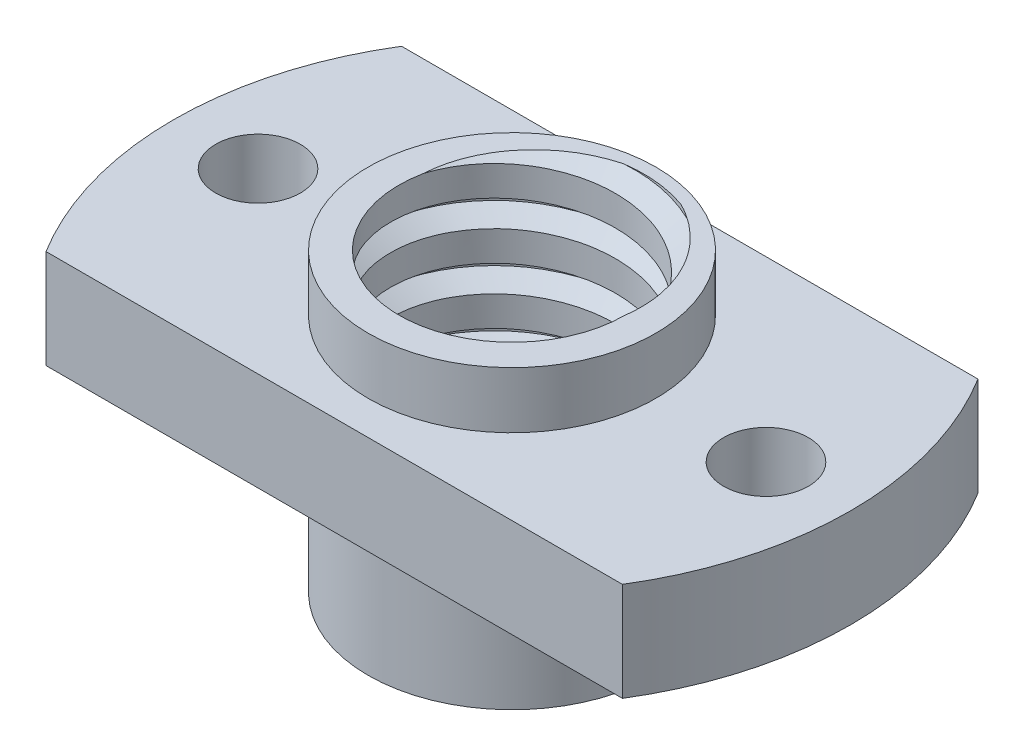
ISO-10303-21;
HEADER;
FILE_DESCRIPTION(('STEP AP214'),'2;1');
FILE_NAME('part.step','',(''),(''),'','','');
FILE_SCHEMA(('AUTOMOTIVE_DESIGN { 1 0 10303 214 1 1 1 1 }'));
ENDSEC;
DATA;
#1=APPLICATION_CONTEXT('core data for automotive mechanical design processes');
#2=APPLICATION_PROTOCOL_DEFINITION('international standard','automotive_design',2000,#1);
#3=PRODUCT_CONTEXT('',#1,'mechanical');
#4=PRODUCT('Part','Part','',(#3));
#5=PRODUCT_RELATED_PRODUCT_CATEGORY('part','',(#4));
#6=PRODUCT_DEFINITION_FORMATION('','',#4);
#7=PRODUCT_DEFINITION_CONTEXT('part definition',#1,'design');
#8=PRODUCT_DEFINITION('design','',#6,#7);
#9=PRODUCT_DEFINITION_SHAPE('','',#8);
#10=(LENGTH_UNIT() NAMED_UNIT(*) SI_UNIT(.MILLI.,.METRE.));
#11=(NAMED_UNIT(*) PLANE_ANGLE_UNIT() SI_UNIT($,.RADIAN.));
#12=(NAMED_UNIT(*) SI_UNIT($,.STERADIAN.) SOLID_ANGLE_UNIT());
#13=UNCERTAINTY_MEASURE_WITH_UNIT(LENGTH_MEASURE(1.E-05),#10,'distance_accuracy_value','');
#14=(GEOMETRIC_REPRESENTATION_CONTEXT(3) GLOBAL_UNCERTAINTY_ASSIGNED_CONTEXT((#13)) GLOBAL_UNIT_ASSIGNED_CONTEXT((#10,
#11,#12)) REPRESENTATION_CONTEXT('',''));
#15=CARTESIAN_POINT('',(0.,0.,0.));
#16=DIRECTION('',(0.,0.,1.));
#17=DIRECTION('',(1.,0.,0.));
#18=AXIS2_PLACEMENT_3D('',#15,#16,#17);
#19=CARTESIAN_POINT('',(1.11022302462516E-13,5.5,0.));
#20=DIRECTION('',(0.,-1.,0.));
#21=DIRECTION('',(0.,0.,-1.));
#22=AXIS2_PLACEMENT_3D('',#19,#20,#21);
#23=PLANE('',#22);
#24=CARTESIAN_POINT('',(1.11022302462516E-13,5.5,0.));
#25=DIRECTION('',(0.,-1.,0.));
#26=DIRECTION('',(0.,0.,-1.));
#27=AXIS2_PLACEMENT_3D('',#24,#25,#26);
#28=CIRCLE('',#27,5.1);
#29=CARTESIAN_POINT('',(1.11022302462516E-13,5.5,-5.1));
#30=VERTEX_POINT('',#29);
#31=EDGE_CURVE('E158',#30,#30,#28,.T.);
#32=ORIENTED_EDGE('',*,*,#31,.F.);
#33=EDGE_LOOP('',(#32));
#34=FACE_BOUND('',#33,.T.);
#35=CARTESIAN_POINT('',(4.00000000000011,5.5,0.));
#36=CARTESIAN_POINT('',(4.01539679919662,5.5,-0.115431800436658));
#37=CARTESIAN_POINT('',(4.02589601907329,5.5,-0.231514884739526));
#38=CARTESIAN_POINT('',(4.03707565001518,5.5,-0.46413750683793));
#39=CARTESIAN_POINT('',(4.03775737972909,5.5,-0.580676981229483));
#40=CARTESIAN_POINT('',(4.02929330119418,5.5,-0.813101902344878));
#41=CARTESIAN_POINT('',(4.02017247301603,5.5,-0.928988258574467));
#42=CARTESIAN_POINT('',(3.99221225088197,5.5,-1.15958750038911));
#43=CARTESIAN_POINT('',(3.97337240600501,5.5,-1.27430033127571));
#44=CARTESIAN_POINT('',(3.92608661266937,5.5,-1.5018548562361));
#45=CARTESIAN_POINT('',(3.89763066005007,5.5,-1.61469447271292));
#46=CARTESIAN_POINT('',(3.83133021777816,5.5,-1.83756376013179));
#47=CARTESIAN_POINT('',(3.79348666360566,5.5,-1.94759370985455));
#48=CARTESIAN_POINT('',(3.70867471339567,5.5,-2.16413677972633));
#49=CARTESIAN_POINT('',(3.66170336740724,5.5,-2.27064874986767));
#50=CARTESIAN_POINT('',(3.58465482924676,5.5,-2.42714436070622));
#51=CARTESIAN_POINT('',(3.55786871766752,5.5,-2.47877194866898));
#52=CARTESIAN_POINT('',(3.50219355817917,5.5,-2.58088149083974));
#53=CARTESIAN_POINT('',(3.47330442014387,5.5,-2.63136339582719));
#54=CARTESIAN_POINT('',(3.38332972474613,5.5,-2.78179105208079));
#55=CARTESIAN_POINT('',(3.31929697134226,5.5,-2.87999531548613));
#56=CARTESIAN_POINT('',(3.18373131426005,5.5,-3.07106420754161));
#57=CARTESIAN_POINT('',(3.11219855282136,5.5,-3.16392893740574));
#58=CARTESIAN_POINT('',(2.96207076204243,5.5,-3.34379610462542));
#59=CARTESIAN_POINT('',(2.88347478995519,5.5,-3.43079775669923));
#60=CARTESIAN_POINT('',(2.71974453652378,5.5,-3.59835740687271));
#61=CARTESIAN_POINT('',(2.63461097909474,5.5,-3.67891611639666));
#62=CARTESIAN_POINT('',(2.40003344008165,5.50000000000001,-3.8840612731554));
#63=CARTESIAN_POINT('',(2.24521540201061,5.5,-4.00263196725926));
#64=CARTESIAN_POINT('',(2.00271359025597,5.5,-4.16453414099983));
#65=CARTESIAN_POINT('',(1.92020858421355,5.5,-4.21582209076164));
#66=CARTESIAN_POINT('',(1.75204335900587,5.5,-4.31295617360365));
#67=CARTESIAN_POINT('',(1.66638280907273,5.5,-4.35880173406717));
#68=CARTESIAN_POINT('',(1.57929751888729,5.5,-4.4018452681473));
#69=B_SPLINE_CURVE_WITH_KNOTS('',3,(#35,#36,#37,#38,#39,#40,#41,#42,#43,#44,#45,#46,#47,#48,#49,
#50,#51,#52,#53,#54,#55,#56,#57,#58,#59,#60,#61,#62,#63,#64,#65,#66,#67,#68),.UNSPECIFIED.,.F.,
.F.,(4,2,2,2,2,2,2,2,2,2,2,2,2,2,2,2,4),(0.,0.34925617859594,0.698465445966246,1.04678692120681,
1.39512455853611,1.74382571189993,2.09249213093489,2.4412714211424,2.61571533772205,
2.79016673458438,3.14148723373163,3.49280107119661,3.84416186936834,4.19548381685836,
4.77858059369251,5.06985396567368,5.36115795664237),.UNSPECIFIED.);
#70=CARTESIAN_POINT('',(4.00000000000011,5.5,0.));
#71=VERTEX_POINT('',#70);
#72=CARTESIAN_POINT('',(1.57929751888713,5.5,-4.40184526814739));
#73=VERTEX_POINT('',#72);
#74=EDGE_CURVE('E12',#71,#73,#69,.T.);
#75=ORIENTED_EDGE('',*,*,#74,.F.);
#76=CARTESIAN_POINT('',(1.11022302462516E-13,5.5,0.));
#77=DIRECTION('',(0.,-1.,0.));
#78=DIRECTION('',(0.,0.,-1.));
#79=AXIS2_PLACEMENT_3D('',#76,#77,#78);
#80=CIRCLE('',#79,4.);
#81=CARTESIAN_POINT('',(-3.92183447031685,5.5,-0.786901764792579));
#82=VERTEX_POINT('',#81);
#83=EDGE_CURVE('E149',#71,#82,#80,.T.);
#84=ORIENTED_EDGE('',*,*,#83,.T.);
#85=CARTESIAN_POINT('',(-0.677410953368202,5.49999999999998,-4.62726018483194));
#86=CARTESIAN_POINT('',(-0.741421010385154,5.49999999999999,-4.60999700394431));
#87=CARTESIAN_POINT('',(-0.805068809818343,5.5,-4.59138850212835));
#88=CARTESIAN_POINT('',(-0.931530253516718,5.5,-4.55150891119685));
#89=CARTESIAN_POINT('',(-0.994343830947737,5.5,-4.53023761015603));
#90=CARTESIAN_POINT('',(-1.11904577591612,5.5,-4.48505279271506));
#91=CARTESIAN_POINT('',(-1.18093370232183,5.5,-4.46113805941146));
#92=CARTESIAN_POINT('',(-1.30366051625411,5.5,-4.41075534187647));
#93=CARTESIAN_POINT('',(-1.36449942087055,5.5,-4.3842873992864));
#94=CARTESIAN_POINT('',(-1.48495587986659,5.5,-4.32870477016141));
#95=CARTESIAN_POINT('',(-1.54457351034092,5.5,-4.29959024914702));
#96=CARTESIAN_POINT('',(-1.66241227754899,5.5,-4.23867224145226));
#97=CARTESIAN_POINT('',(-1.72063343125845,5.5,-4.20686878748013));
#98=CARTESIAN_POINT('',(-1.89301849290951,5.5,-4.10756627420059));
#99=CARTESIAN_POINT('',(-2.00495942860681,5.5,-4.03614949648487));
#100=CARTESIAN_POINT('',(-2.222145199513,5.5,-3.8832841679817));
#101=CARTESIAN_POINT('',(-2.32737332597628,5.5,-3.80181196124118));
#102=CARTESIAN_POINT('',(-2.52999847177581,5.5,-3.62962228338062));
#103=CARTESIAN_POINT('',(-2.62739476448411,5.5,-3.53890395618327));
#104=CARTESIAN_POINT('',(-2.81350239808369,5.5,-3.34900256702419));
#105=CARTESIAN_POINT('',(-2.90221543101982,5.5,-3.24982116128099));
#106=CARTESIAN_POINT('',(-3.07026146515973,5.5,-3.04377663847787));
#107=CARTESIAN_POINT('',(-3.14959439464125,5.49999999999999,-2.93691346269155));
#108=CARTESIAN_POINT('',(-3.2583717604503,5.5,-2.77550541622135));
#109=CARTESIAN_POINT('',(-3.29178012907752,5.5,-2.72359143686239));
#110=CARTESIAN_POINT('',(-3.35638624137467,5.5,-2.61840727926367));
#111=CARTESIAN_POINT('',(-3.38758419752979,5.5,-2.56513723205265));
#112=CARTESIAN_POINT('',(-3.44763844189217,5.5,-2.45730305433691));
#113=CARTESIAN_POINT('',(-3.47649516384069,5.5,-2.40273916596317));
#114=CARTESIAN_POINT('',(-3.53165457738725,5.5,-2.29232007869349));
#115=CARTESIAN_POINT('',(-3.5579565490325,5.5,-2.23646452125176));
#116=CARTESIAN_POINT('',(-3.63288449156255,5.5,-2.06741459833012));
#117=CARTESIAN_POINT('',(-3.67767075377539,5.5,-1.95248888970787));
#118=CARTESIAN_POINT('',(-3.7565378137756,5.5,-1.7190084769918));
#119=CARTESIAN_POINT('',(-3.79061616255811,5.5,-1.60045294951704));
#120=CARTESIAN_POINT('',(-3.84634324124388,5.5,-1.36670000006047));
#121=CARTESIAN_POINT('',(-3.86852718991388,5.5,-1.25163005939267));
#122=CARTESIAN_POINT('',(-3.90278467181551,5.5,-1.02010963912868));
#123=CARTESIAN_POINT('',(-3.9148680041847,5.5,-0.903660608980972));
#124=CARTESIAN_POINT('',(-3.92183447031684,5.5,-0.786901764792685));
#125=B_SPLINE_CURVE_WITH_KNOTS('',3,(#85,#86,#87,#88,#89,#90,#91,#92,#93,#94,#95,#96,#97,#98,
#99,#100,#101,#102,#103,#104,#105,#106,#107,#108,#109,#110,#111,#112,#113,#114,#115,#116,#117,
#118,#119,#120,#121,#122,#123,#124),.UNSPECIFIED.,.F.,.F.,(4,2,2,2,2,2,2,2,2,2,2,2,2,2,2,2,2,2,
2,4),(0.,0.198877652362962,0.397771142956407,0.596756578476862,0.795738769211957,
0.994708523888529,1.19367585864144,1.59142808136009,1.9901345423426,2.38887795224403,
2.78754350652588,3.18621210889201,3.37137293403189,3.55651593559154,3.74162455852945,
3.92678519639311,4.29625761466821,4.66581447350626,5.01693714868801,5.36771878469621),.UNSPECIFIED.);
#126=CARTESIAN_POINT('',(-0.677410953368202,5.49999999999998,-4.62726018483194));
#127=VERTEX_POINT('',#126);
#128=EDGE_CURVE('E127',#127,#82,#125,.T.);
#129=ORIENTED_EDGE('',*,*,#128,.F.);
#130=CARTESIAN_POINT('',(1.5792975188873,5.49999999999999,-4.40184526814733));
#131=CARTESIAN_POINT('',(1.48120676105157,5.49999999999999,-4.43705237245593));
#132=CARTESIAN_POINT('',(1.38190492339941,5.5,-4.46896946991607));
#133=CARTESIAN_POINT('',(1.0807297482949,5.5,-4.55477452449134));
#134=CARTESIAN_POINT('',(0.875912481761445,5.5,-4.59857437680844));
#135=CARTESIAN_POINT('',(0.448490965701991,5.5,-4.6603584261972));
#136=CARTESIAN_POINT('',(0.22560760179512,5.5,-4.67643902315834));
#137=CARTESIAN_POINT('',(-0.110935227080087,5.5,-4.67665424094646));
#138=CARTESIAN_POINT('',(-0.224698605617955,5.5,-4.67256679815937));
#139=CARTESIAN_POINT('',(-0.451632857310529,5.5,-4.65611292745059));
#140=CARTESIAN_POINT('',(-0.564803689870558,5.5,-4.64374593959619));
#141=CARTESIAN_POINT('',(-0.677410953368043,5.5,-4.62726018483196));
#142=B_SPLINE_CURVE_WITH_KNOTS('',3,(#130,#131,#132,#133,#134,#135,#136,#137,#138,#139,#140,
#141),.UNSPECIFIED.,.F.,.F.,(4,2,2,2,2,4),(0.,0.312674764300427,0.939081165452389,
1.60700824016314,1.94825462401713,2.28952408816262),.UNSPECIFIED.);
#143=EDGE_CURVE('E57',#73,#127,#142,.T.);
#144=ORIENTED_EDGE('',*,*,#143,.F.);
#145=EDGE_LOOP('',(#75,#84,#129,#144));
#146=FACE_BOUND('',#145,.T.);
#147=ADVANCED_FACE('F43',(#34,#146),#23,.F.);
#148=CARTESIAN_POINT('',(1.11022302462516E-13,3.5,0.));
#149=DIRECTION('',(0.,1.,0.));
#150=DIRECTION('',(0.,0.,1.));
#151=AXIS2_PLACEMENT_3D('',#148,#149,#150);
#152=PLANE('',#151);
#153=CARTESIAN_POINT('',(1.11022302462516E-13,3.5,0.));
#154=DIRECTION('',(0.,1.,0.));
#155=DIRECTION('',(0.,0.,1.));
#156=AXIS2_PLACEMENT_3D('',#153,#154,#155);
#157=CIRCLE('',#156,5.1);
#158=CARTESIAN_POINT('',(1.11022302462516E-13,3.5,5.1));
#159=VERTEX_POINT('',#158);
#160=EDGE_CURVE('E162',#159,#159,#157,.T.);
#161=ORIENTED_EDGE('',*,*,#160,.F.);
#162=EDGE_LOOP('',(#161));
#163=FACE_BOUND('',#162,.T.);
#164=CARTESIAN_POINT('',(1.11022302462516E-13,3.5,0.));
#165=DIRECTION('',(0.,1.,0.));
#166=DIRECTION('',(0.,0.,1.));
#167=AXIS2_PLACEMENT_3D('',#164,#165,#166);
#168=CIRCLE('',#167,12.);
#169=CARTESIAN_POINT('',(10.2132267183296,3.5,6.3));
#170=VERTEX_POINT('',#169);
#171=CARTESIAN_POINT('',(10.2132267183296,3.5,-6.3));
#172=VERTEX_POINT('',#171);
#173=EDGE_CURVE('E179',#170,#172,#168,.T.);
#174=ORIENTED_EDGE('',*,*,#173,.T.);
#175=DIRECTION('',(-1.,0.,0.));
#176=VECTOR('',#175,1.);
#177=CARTESIAN_POINT('',(-10.2132267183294,3.5,-6.3));
#178=LINE('',#177,#176);
#179=CARTESIAN_POINT('',(-10.2132267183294,3.5,-6.3));
#180=VERTEX_POINT('',#179);
#181=EDGE_CURVE('E102',#172,#180,#178,.T.);
#182=ORIENTED_EDGE('',*,*,#181,.T.);
#183=CARTESIAN_POINT('',(1.11022302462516E-13,3.5,0.));
#184=DIRECTION('',(0.,1.,0.));
#185=DIRECTION('',(0.,0.,1.));
#186=AXIS2_PLACEMENT_3D('',#183,#184,#185);
#187=CIRCLE('',#186,12.);
#188=CARTESIAN_POINT('',(-10.2132267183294,3.5,6.29999999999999));
#189=VERTEX_POINT('',#188);
#190=EDGE_CURVE('E182',#180,#189,#187,.T.);
#191=ORIENTED_EDGE('',*,*,#190,.T.);
#192=DIRECTION('',(1.,0.,0.));
#193=VECTOR('',#192,1.);
#194=CARTESIAN_POINT('',(-10.2132267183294,3.5,6.3));
#195=LINE('',#194,#193);
#196=EDGE_CURVE('E73',#189,#170,#195,.T.);
#197=ORIENTED_EDGE('',*,*,#196,.T.);
#198=EDGE_LOOP('',(#174,#182,#191,#197));
#199=FACE_BOUND('',#198,.T.);
#200=CARTESIAN_POINT('',(-9.00000000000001,3.5,0.));
#201=DIRECTION('',(0.,1.,0.));
#202=DIRECTION('',(0.,0.,1.));
#203=AXIS2_PLACEMENT_3D('',#200,#201,#202);
#204=CIRCLE('',#203,1.5);
#205=CARTESIAN_POINT('',(-9.00000000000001,3.5,1.5));
#206=VERTEX_POINT('',#205);
#207=EDGE_CURVE('E173',#206,#206,#204,.T.);
#208=ORIENTED_EDGE('',*,*,#207,.F.);
#209=EDGE_LOOP('',(#208));
#210=FACE_BOUND('',#209,.T.);
#211=CARTESIAN_POINT('',(9.00000000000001,3.5,0.));
#212=DIRECTION('',(0.,1.,0.));
#213=DIRECTION('',(0.,0.,1.));
#214=AXIS2_PLACEMENT_3D('',#211,#212,#213);
#215=CIRCLE('',#214,1.5);
#216=CARTESIAN_POINT('',(9.00000000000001,3.5,1.50000000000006));
#217=VERTEX_POINT('',#216);
#218=EDGE_CURVE('E166',#217,#217,#215,.T.);
#219=ORIENTED_EDGE('',*,*,#218,.F.);
#220=EDGE_LOOP('',(#219));
#221=FACE_BOUND('',#220,.T.);
#222=ADVANCED_FACE('F266',(#163,#199,#210,#221),#152,.T.);
#223=CARTESIAN_POINT('',(1.11022302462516E-13,0.,0.));
#224=DIRECTION('',(0.,1.,0.));
#225=DIRECTION('',(0.,0.,1.));
#226=AXIS2_PLACEMENT_3D('',#223,#224,#225);
#227=PLANE('',#226);
#228=CARTESIAN_POINT('',(1.11022302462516E-13,0.,0.));
#229=DIRECTION('',(0.,1.,0.));
#230=DIRECTION('',(0.,0.,1.));
#231=AXIS2_PLACEMENT_3D('',#228,#229,#230);
#232=CIRCLE('',#231,5.1);
#233=CARTESIAN_POINT('',(1.11022302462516E-13,0.,5.1));
#234=VERTEX_POINT('',#233);
#235=EDGE_CURVE('E161',#234,#234,#232,.T.);
#236=ORIENTED_EDGE('',*,*,#235,.T.);
#237=EDGE_LOOP('',(#236));
#238=FACE_BOUND('',#237,.T.);
#239=CARTESIAN_POINT('',(1.11022302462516E-13,0.,0.));
#240=DIRECTION('',(0.,1.,0.));
#241=DIRECTION('',(0.,0.,1.));
#242=AXIS2_PLACEMENT_3D('',#239,#240,#241);
#243=CIRCLE('',#242,12.);
#244=CARTESIAN_POINT('',(10.2132267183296,0.,6.3));
#245=VERTEX_POINT('',#244);
#246=CARTESIAN_POINT('',(10.2132267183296,0.,-6.3));
#247=VERTEX_POINT('',#246);
#248=EDGE_CURVE('E176',#245,#247,#243,.T.);
#249=ORIENTED_EDGE('',*,*,#248,.F.);
#250=DIRECTION('',(1.,0.,0.));
#251=VECTOR('',#250,1.);
#252=CARTESIAN_POINT('',(-10.2132267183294,0.,6.3));
#253=LINE('',#252,#251);
#254=CARTESIAN_POINT('',(-10.2132267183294,0.,6.29999999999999));
#255=VERTEX_POINT('',#254);
#256=EDGE_CURVE('E94',#255,#245,#253,.T.);
#257=ORIENTED_EDGE('',*,*,#256,.F.);
#258=CARTESIAN_POINT('',(1.11022302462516E-13,0.,0.));
#259=DIRECTION('',(0.,1.,0.));
#260=DIRECTION('',(0.,0.,1.));
#261=AXIS2_PLACEMENT_3D('',#258,#259,#260);
#262=CIRCLE('',#261,12.);
#263=CARTESIAN_POINT('',(-10.2132267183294,0.,-6.3));
#264=VERTEX_POINT('',#263);
#265=EDGE_CURVE('E190',#264,#255,#262,.T.);
#266=ORIENTED_EDGE('',*,*,#265,.F.);
#267=DIRECTION('',(-1.,0.,0.));
#268=VECTOR('',#267,1.);
#269=CARTESIAN_POINT('',(-10.2132267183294,0.,-6.3));
#270=LINE('',#269,#268);
#271=EDGE_CURVE('E188',#247,#264,#270,.T.);
#272=ORIENTED_EDGE('',*,*,#271,.F.);
#273=EDGE_LOOP('',(#249,#257,#266,#272));
#274=FACE_BOUND('',#273,.T.);
#275=CARTESIAN_POINT('',(-9.00000000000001,0.,0.));
#276=DIRECTION('',(0.,1.,0.));
#277=DIRECTION('',(0.,0.,1.));
#278=AXIS2_PLACEMENT_3D('',#275,#276,#277);
#279=CIRCLE('',#278,1.5);
#280=CARTESIAN_POINT('',(-9.00000000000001,0.,1.5));
#281=VERTEX_POINT('',#280);
#282=EDGE_CURVE('E169',#281,#281,#279,.T.);
#283=ORIENTED_EDGE('',*,*,#282,.T.);
#284=EDGE_LOOP('',(#283));
#285=FACE_BOUND('',#284,.T.);
#286=CARTESIAN_POINT('',(9.00000000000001,0.,0.));
#287=DIRECTION('',(0.,1.,0.));
#288=DIRECTION('',(0.,0.,1.));
#289=AXIS2_PLACEMENT_3D('',#286,#287,#288);
#290=CIRCLE('',#289,1.5);
#291=CARTESIAN_POINT('',(9.00000000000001,0.,1.50000000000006));
#292=VERTEX_POINT('',#291);
#293=EDGE_CURVE('E170',#292,#292,#290,.T.);
#294=ORIENTED_EDGE('',*,*,#293,.T.);
#295=EDGE_LOOP('',(#294));
#296=FACE_BOUND('',#295,.T.);
#297=ADVANCED_FACE('F272',(#238,#274,#285,#296),#227,.F.);
#298=CARTESIAN_POINT('',(1.11022302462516E-13,3.5,0.));
#299=DIRECTION('',(0.,-1.,0.));
#300=DIRECTION('',(0.,0.,-1.));
#301=AXIS2_PLACEMENT_3D('',#298,#299,#300);
#302=CYLINDRICAL_SURFACE('',#301,12.);
#303=ORIENTED_EDGE('',*,*,#248,.T.);
#304=DIRECTION('',(0.,-1.,0.));
#305=VECTOR('',#304,1.);
#306=CARTESIAN_POINT('',(10.2132267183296,3.5,-6.3));
#307=LINE('',#306,#305);
#308=EDGE_CURVE('E165',#172,#247,#307,.T.);
#309=ORIENTED_EDGE('',*,*,#308,.F.);
#310=ORIENTED_EDGE('',*,*,#173,.F.);
#311=DIRECTION('',(0.,-1.,0.));
#312=VECTOR('',#311,1.);
#313=CARTESIAN_POINT('',(10.2132267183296,3.5,6.3));
#314=LINE('',#313,#312);
#315=EDGE_CURVE('E185',#170,#245,#314,.T.);
#316=ORIENTED_EDGE('',*,*,#315,.T.);
#317=EDGE_LOOP('',(#303,#309,#310,#316));
#318=FACE_BOUND('',#317,.T.);
#319=ADVANCED_FACE('F45',(#318),#302,.T.);
#320=CARTESIAN_POINT('',(-10.2132267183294,3.5,-6.3));
#321=DIRECTION('',(0.,0.,1.));
#322=DIRECTION('',(1.,0.,0.));
#323=AXIS2_PLACEMENT_3D('',#320,#321,#322);
#324=PLANE('',#323);
#325=ORIENTED_EDGE('',*,*,#271,.T.);
#326=DIRECTION('',(0.,-1.,0.));
#327=VECTOR('',#326,1.);
#328=CARTESIAN_POINT('',(-10.2132267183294,3.5,-6.3));
#329=LINE('',#328,#327);
#330=EDGE_CURVE('E196',#180,#264,#329,.T.);
#331=ORIENTED_EDGE('',*,*,#330,.F.);
#332=ORIENTED_EDGE('',*,*,#181,.F.);
#333=ORIENTED_EDGE('',*,*,#308,.T.);
#334=EDGE_LOOP('',(#325,#331,#332,#333));
#335=FACE_BOUND('',#334,.T.);
#336=ADVANCED_FACE('F330',(#335),#324,.F.);
#337=CARTESIAN_POINT('',(1.11022302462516E-13,3.5,0.));
#338=DIRECTION('',(0.,-1.,0.));
#339=DIRECTION('',(0.,0.,-1.));
#340=AXIS2_PLACEMENT_3D('',#337,#338,#339);
#341=CYLINDRICAL_SURFACE('',#340,12.);
#342=ORIENTED_EDGE('',*,*,#265,.T.);
#343=DIRECTION('',(0.,-1.,0.));
#344=VECTOR('',#343,1.);
#345=CARTESIAN_POINT('',(-10.2132267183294,3.5,6.29999999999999));
#346=LINE('',#345,#344);
#347=EDGE_CURVE('E194',#189,#255,#346,.T.);
#348=ORIENTED_EDGE('',*,*,#347,.F.);
#349=ORIENTED_EDGE('',*,*,#190,.F.);
#350=ORIENTED_EDGE('',*,*,#330,.T.);
#351=EDGE_LOOP('',(#342,#348,#349,#350));
#352=FACE_BOUND('',#351,.T.);
#353=ADVANCED_FACE('F328',(#352),#341,.T.);
#354=CARTESIAN_POINT('',(-10.2132267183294,3.5,6.3));
#355=DIRECTION('',(0.,0.,-1.));
#356=DIRECTION('',(-1.,0.,0.));
#357=AXIS2_PLACEMENT_3D('',#354,#355,#356);
#358=PLANE('',#357);
#359=ORIENTED_EDGE('',*,*,#256,.T.);
#360=ORIENTED_EDGE('',*,*,#315,.F.);
#361=ORIENTED_EDGE('',*,*,#196,.F.);
#362=ORIENTED_EDGE('',*,*,#347,.T.);
#363=EDGE_LOOP('',(#359,#360,#361,#362));
#364=FACE_BOUND('',#363,.T.);
#365=ADVANCED_FACE('F320',(#364),#358,.F.);
#366=CARTESIAN_POINT('',(-9.00000000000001,3.5,0.));
#367=DIRECTION('',(0.,-1.,0.));
#368=DIRECTION('',(0.,0.,-1.));
#369=AXIS2_PLACEMENT_3D('',#366,#367,#368);
#370=CYLINDRICAL_SURFACE('',#369,1.5);
#371=ORIENTED_EDGE('',*,*,#207,.T.);
#372=EDGE_LOOP('',(#371));
#373=FACE_BOUND('',#372,.T.);
#374=ORIENTED_EDGE('',*,*,#282,.F.);
#375=EDGE_LOOP('',(#374));
#376=FACE_BOUND('',#375,.T.);
#377=ADVANCED_FACE('F316',(#373,#376),#370,.F.);
#378=CARTESIAN_POINT('',(9.00000000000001,3.5,0.));
#379=DIRECTION('',(0.,-1.,0.));
#380=DIRECTION('',(0.,0.,-1.));
#381=AXIS2_PLACEMENT_3D('',#378,#379,#380);
#382=CYLINDRICAL_SURFACE('',#381,1.5);
#383=ORIENTED_EDGE('',*,*,#218,.T.);
#384=EDGE_LOOP('',(#383));
#385=FACE_BOUND('',#384,.T.);
#386=ORIENTED_EDGE('',*,*,#293,.F.);
#387=EDGE_LOOP('',(#386));
#388=FACE_BOUND('',#387,.T.);
#389=ADVANCED_FACE('F264',(#385,#388),#382,.F.);
#390=CARTESIAN_POINT('',(1.11022302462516E-13,5.5,0.));
#391=DIRECTION('',(0.,-1.,0.));
#392=DIRECTION('',(0.,0.,-1.));
#393=AXIS2_PLACEMENT_3D('',#390,#391,#392);
#394=CYLINDRICAL_SURFACE('',#393,5.1);
#395=CARTESIAN_POINT('',(1.11022302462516E-13,-5.,0.));
#396=DIRECTION('',(0.,-1.,0.));
#397=DIRECTION('',(0.,0.,-1.));
#398=AXIS2_PLACEMENT_3D('',#395,#396,#397);
#399=CIRCLE('',#398,5.1);
#400=CARTESIAN_POINT('',(1.11022302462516E-13,-5.,-5.1));
#401=VERTEX_POINT('',#400);
#402=EDGE_CURVE('E145',#401,#401,#399,.T.);
#403=ORIENTED_EDGE('',*,*,#402,.F.);
#404=EDGE_LOOP('',(#403));
#405=FACE_BOUND('',#404,.T.);
#406=ORIENTED_EDGE('',*,*,#235,.F.);
#407=EDGE_LOOP('',(#406));
#408=FACE_BOUND('',#407,.T.);
#409=ADVANCED_FACE('F256',(#405,#408),#394,.T.);
#410=CARTESIAN_POINT('',(1.11022302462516E-13,-5.,0.));
#411=DIRECTION('',(0.,-1.,0.));
#412=DIRECTION('',(0.,0.,-1.));
#413=AXIS2_PLACEMENT_3D('',#410,#411,#412);
#414=PLANE('',#413);
#415=CARTESIAN_POINT('',(4.40396097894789,-5.,1.57338810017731));
#416=CARTESIAN_POINT('',(4.34554717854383,-5.,1.69060164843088));
#417=CARTESIAN_POINT('',(4.28218227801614,-5.,1.80534117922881));
#418=CARTESIAN_POINT('',(4.14598188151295,-5.,2.02915398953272));
#419=CARTESIAN_POINT('',(4.07314041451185,-5.,2.13822363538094));
#420=CARTESIAN_POINT('',(3.91849741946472,-5.,2.3498228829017));
#421=CARTESIAN_POINT('',(3.83669632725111,-5.,2.45235280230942));
#422=CARTESIAN_POINT('',(3.70782240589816,-5.,2.60072947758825));
#423=CARTESIAN_POINT('',(3.66383495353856,-5.,2.64928608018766));
#424=CARTESIAN_POINT('',(3.57371999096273,-5.,2.74436955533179));
#425=CARTESIAN_POINT('',(3.52759257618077,-5.,2.79089651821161));
#426=CARTESIAN_POINT('',(3.38579655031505,-5.,2.92755108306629));
#427=CARTESIAN_POINT('',(3.2869763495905,-5.,3.01444905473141));
#428=CARTESIAN_POINT('',(3.0818306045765,-5.,3.17887235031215));
#429=CARTESIAN_POINT('',(2.97550423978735,-5.,3.25639664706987));
#430=CARTESIAN_POINT('',(2.75624361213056,-5.,3.4014008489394));
#431=CARTESIAN_POINT('',(2.64331107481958,-5.,3.46888336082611));
#432=CARTESIAN_POINT('',(2.4117663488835,-5.,3.59324514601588));
#433=CARTESIAN_POINT('',(2.29315479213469,-5.,3.6501255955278));
#434=CARTESIAN_POINT('',(2.06036446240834,-5.,3.74894833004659));
#435=CARTESIAN_POINT('',(1.94652583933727,-5.,3.79169360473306));
#436=CARTESIAN_POINT('',(1.71562587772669,-5.,3.86739598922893));
#437=CARTESIAN_POINT('',(1.59856412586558,-5.,3.90035183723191));
#438=CARTESIAN_POINT('',(1.36224576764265,-5.,3.95632384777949));
#439=CARTESIAN_POINT('',(1.24299237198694,-5.,3.97935350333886));
#440=CARTESIAN_POINT('',(1.00290184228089,-5.,4.01435308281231));
#441=CARTESIAN_POINT('',(0.882065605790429,-5.,4.02632902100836));
#442=CARTESIAN_POINT('',(0.697454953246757,-5.,4.03613728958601));
#443=CARTESIAN_POINT('',(0.633865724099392,-5.,4.03798699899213));
#444=CARTESIAN_POINT('',(0.506677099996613,-5.,4.03862767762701));
#445=CARTESIAN_POINT('',(0.443077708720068,-5.,4.03741917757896));
#446=CARTESIAN_POINT('',(0.316062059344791,-5.,4.03194784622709));
#447=CARTESIAN_POINT('',(0.252645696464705,-5.,4.02768742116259));
#448=CARTESIAN_POINT('',(0.126082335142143,-5.,4.01612379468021));
#449=CARTESIAN_POINT('',(0.0629353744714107,-5.,4.00882017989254));
#450=CARTESIAN_POINT('',(1.01859816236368E-13,-5.,4.));
#451=B_SPLINE_CURVE_WITH_KNOTS('',3,(#415,#416,#417,#418,#419,#420,#421,#422,#423,#424,#425,
#426,#427,#428,#429,#430,#431,#432,#433,#434,#435,#436,#437,#438,#439,#440,#441,#442,#443,#444,
#445,#446,#447,#448,#449,#450),.UNSPECIFIED.,.F.,.F.,(4,2,2,2,2,2,2,2,2,2,2,2,2,2,2,2,2,4),(0.,
0.392760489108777,0.785769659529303,1.17875972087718,1.37526113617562,1.57175379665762,
1.96593737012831,2.36016409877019,2.75428830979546,3.14836877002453,3.51273391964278,
3.87714601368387,4.24106117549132,4.6047782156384,4.79556679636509,4.98632226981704,
5.1769275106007,5.36755865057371),.UNSPECIFIED.);
#452=CARTESIAN_POINT('',(4.40396097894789,-5.,1.57338810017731));
#453=VERTEX_POINT('',#452);
#454=CARTESIAN_POINT('',(1.0191538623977E-13,-5.,4.));
#455=VERTEX_POINT('',#454);
#456=EDGE_CURVE('E146',#453,#455,#451,.T.);
#457=ORIENTED_EDGE('',*,*,#456,.F.);
#458=CARTESIAN_POINT('',(4.62459394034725,-5.,-0.695379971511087));
#459=CARTESIAN_POINT('',(4.64010344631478,-5.,-0.592322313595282));
#460=CARTESIAN_POINT('',(4.65215064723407,-5.,-0.488715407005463));
#461=CARTESIAN_POINT('',(4.67790077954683,-5.,-0.176617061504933));
#462=CARTESIAN_POINT('',(4.68113625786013,-5.,0.0328049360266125));
#463=CARTESIAN_POINT('',(4.65873109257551,-5.,0.466008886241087));
#464=CARTESIAN_POINT('',(4.63089338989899,-5.,0.689682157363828));
#465=CARTESIAN_POINT('',(4.56484051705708,-5.,1.02267693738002));
#466=CARTESIAN_POINT('',(4.53835272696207,-5.,1.13444197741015));
#467=CARTESIAN_POINT('',(4.47723022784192,-5.,1.35572943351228));
#468=CARTESIAN_POINT('',(4.44259499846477,-5.,1.4652517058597));
#469=CARTESIAN_POINT('',(4.4039609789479,-5.,1.57338810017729));
#470=B_SPLINE_CURVE_WITH_KNOTS('',3,(#458,#459,#460,#461,#462,#463,#464,#465,#466,#467,#468,
#469),.UNSPECIFIED.,.F.,.F.,(4,2,2,2,2,4),(0.,0.312674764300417,0.939081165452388,
1.61274858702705,1.95706037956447,2.3013941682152),.UNSPECIFIED.);
#471=CARTESIAN_POINT('',(4.62459394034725,-5.,-0.695379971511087));
#472=VERTEX_POINT('',#471);
#473=EDGE_CURVE('E141',#472,#453,#470,.T.);
#474=ORIENTED_EDGE('',*,*,#473,.F.);
#475=CARTESIAN_POINT('',(0.772542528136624,-5.,-3.92468827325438));
#476=CARTESIAN_POINT('',(0.828641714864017,-5.,-3.92143676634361));
#477=CARTESIAN_POINT('',(0.884672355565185,-5.,-3.9169750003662));
#478=CARTESIAN_POINT('',(0.996473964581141,-5.,-3.90561531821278));
#479=CARTESIAN_POINT('',(1.05224498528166,-5.,-3.89871791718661));
#480=CARTESIAN_POINT('',(1.16341230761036,-5.,-3.88247235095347));
#481=CARTESIAN_POINT('',(1.21880871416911,-5.,-3.87312490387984));
#482=CARTESIAN_POINT('',(1.32917165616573,-5.,-3.85215763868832));
#483=CARTESIAN_POINT('',(1.38413813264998,-5.,-3.84053751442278));
#484=CARTESIAN_POINT('',(1.54817435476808,-5.,-3.80242453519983));
#485=CARTESIAN_POINT('',(1.6565042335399,-5.,-3.77266060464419));
#486=CARTESIAN_POINT('',(1.87042448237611,-5.,-3.70454373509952));
#487=CARTESIAN_POINT('',(1.97601464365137,-5.,-3.66619014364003));
#488=CARTESIAN_POINT('',(2.18368121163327,-5.,-3.58119720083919));
#489=CARTESIAN_POINT('',(2.28576115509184,-5.,-3.53456649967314));
#490=CARTESIAN_POINT('',(2.48586205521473,-5.,-3.43329078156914));
#491=CARTESIAN_POINT('',(2.5838830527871,-5.,-3.37864584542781));
#492=CARTESIAN_POINT('',(2.77521835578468,-5.,-3.26171337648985));
#493=CARTESIAN_POINT('',(2.86853401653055,-5.,-3.19942806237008));
#494=CARTESIAN_POINT('',(3.04988064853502,-5.,-3.06761058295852));
#495=CARTESIAN_POINT('',(3.13791196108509,-5.,-2.99807888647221));
#496=CARTESIAN_POINT('',(3.31264129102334,-5.,-2.84839171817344));
#497=CARTESIAN_POINT('',(3.39902742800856,-5.,-2.76787038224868));
#498=CARTESIAN_POINT('',(3.52324880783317,-5.,-2.64185089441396));
#499=CARTESIAN_POINT('',(3.56376795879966,-5.,-2.59896547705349));
#500=CARTESIAN_POINT('',(3.64310565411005,-5.,-2.51163027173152));
#501=CARTESIAN_POINT('',(3.68192374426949,-5.,-2.46718007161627));
#502=CARTESIAN_POINT('',(3.79579825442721,-5.,-2.3315541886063));
#503=CARTESIAN_POINT('',(3.86822896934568,-5.,-2.23815003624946));
#504=CARTESIAN_POINT('',(4.00559065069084,-5.,-2.04600389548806));
#505=CARTESIAN_POINT('',(4.07052221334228,-5.,-1.94726233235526));
#506=CARTESIAN_POINT('',(4.18564704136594,-5.,-1.7564078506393));
#507=CARTESIAN_POINT('',(4.23667657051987,-5.,-1.66479836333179));
#508=CARTESIAN_POINT('',(4.33228846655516,-5.,-1.4782785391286));
#509=CARTESIAN_POINT('',(4.37687116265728,-5.,-1.38336837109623));
#510=CARTESIAN_POINT('',(4.45927012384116,-5.,-1.19095282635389));
#511=CARTESIAN_POINT('',(4.49710397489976,-5.,-1.0934549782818));
#512=CARTESIAN_POINT('',(4.56598355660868,-5.,-0.896082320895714));
#513=CARTESIAN_POINT('',(4.59702879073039,-5.,-0.7962073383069));
#514=CARTESIAN_POINT('',(4.62459394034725,-5.,-0.695379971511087));
#515=B_SPLINE_CURVE_WITH_KNOTS('',3,(#475,#476,#477,#478,#479,#480,#481,#482,#483,#484,#485,
#486,#487,#488,#489,#490,#491,#492,#493,#494,#495,#496,#497,#498,#499,#500,#501,#502,#503,#504,
#505,#506,#507,#508,#509,#510,#511,#512,#513,#514),.UNSPECIFIED.,.F.,.F.,(4,2,2,2,2,2,2,2,2,2,2,
2,2,2,2,2,2,2,2,4),(0.,0.168569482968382,0.337103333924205,0.505587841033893,0.674095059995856,
1.01073641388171,1.34740334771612,1.68372048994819,2.02003424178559,2.35625056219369,
2.69244514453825,3.04626596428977,3.22322310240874,3.40022720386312,3.75443164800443,
4.10860791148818,4.42295171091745,4.73727945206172,5.05077576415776,5.36429499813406),.UNSPECIFIED.);
#516=CARTESIAN_POINT('',(0.772542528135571,-4.99999999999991,-3.92468827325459));
#517=VERTEX_POINT('',#516);
#518=EDGE_CURVE('E124',#517,#472,#515,.T.);
#519=ORIENTED_EDGE('',*,*,#518,.F.);
#520=CARTESIAN_POINT('',(1.11022302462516E-13,-5.,0.));
#521=DIRECTION('',(0.,-1.,0.));
#522=DIRECTION('',(0.,0.,-1.));
#523=AXIS2_PLACEMENT_3D('',#520,#521,#522);
#524=CIRCLE('',#523,4.);
#525=EDGE_CURVE('E139',#455,#517,#524,.T.);
#526=ORIENTED_EDGE('',*,*,#525,.F.);
#527=EDGE_LOOP('',(#457,#474,#519,#526));
#528=FACE_BOUND('',#527,.T.);
#529=ORIENTED_EDGE('',*,*,#402,.T.);
#530=EDGE_LOOP('',(#529));
#531=FACE_BOUND('',#530,.T.);
#532=ADVANCED_FACE('F137',(#528,#531),#414,.T.);
#533=CARTESIAN_POINT('',(1.11022302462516E-13,3.5,0.));
#534=DIRECTION('',(0.,-1.,0.));
#535=DIRECTION('',(0.,0.,-1.));
#536=AXIS2_PLACEMENT_3D('',#533,#534,#535);
#537=CYLINDRICAL_SURFACE('',#536,4.);
#538=CARTESIAN_POINT('',(-3.99999999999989,5.56250000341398,0.));
#539=CARTESIAN_POINT('',(-3.99999999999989,5.46250000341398,-1.29967878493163));
#540=CARTESIAN_POINT('',(-3.23606797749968,5.36250000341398,-2.35114100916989));
#541=CARTESIAN_POINT('',(-2.47213595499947,5.26250000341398,-3.40260323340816));
#542=CARTESIAN_POINT('',(-1.23606797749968,5.16250000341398,-3.80422606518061));
#543=CARTESIAN_POINT('',(1.10764768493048E-13,5.06250000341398,-4.20584889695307));
#544=CARTESIAN_POINT('',(1.2360679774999,4.96250000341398,-3.80422606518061));
#545=CARTESIAN_POINT('',(2.47213595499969,4.86250000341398,-3.40260323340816));
#546=CARTESIAN_POINT('',(3.2360679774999,4.76250000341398,-2.35114100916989));
#547=CARTESIAN_POINT('',(4.00000000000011,4.66250000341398,-1.29967878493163));
#548=CARTESIAN_POINT('',(4.00000000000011,4.56250000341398,0.));
#549=CARTESIAN_POINT('',(4.00000000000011,4.46250000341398,1.29967878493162));
#550=CARTESIAN_POINT('',(3.2360679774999,4.36250000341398,2.35114100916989));
#551=CARTESIAN_POINT('',(2.47213595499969,4.26250000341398,3.40260323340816));
#552=CARTESIAN_POINT('',(1.2360679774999,4.16250000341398,3.80422606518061));
#553=CARTESIAN_POINT('',(1.11794904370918E-13,4.06250000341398,4.20584889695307));
#554=CARTESIAN_POINT('',(-1.23606797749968,3.96250000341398,3.80422606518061));
#555=CARTESIAN_POINT('',(-2.47213595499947,3.86250000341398,3.40260323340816));
#556=CARTESIAN_POINT('',(-3.23606797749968,3.76250000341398,2.35114100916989));
#557=CARTESIAN_POINT('',(-3.99999999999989,3.66250000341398,1.29967878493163));
#558=CARTESIAN_POINT('',(-3.99999999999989,3.56250000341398,0.));
#559=CARTESIAN_POINT('',(-3.99999999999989,3.46250000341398,-1.29967878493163));
#560=CARTESIAN_POINT('',(-3.23606797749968,3.36250000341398,-2.35114100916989));
#561=CARTESIAN_POINT('',(-2.47213595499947,3.26250000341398,-3.40260323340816));
#562=CARTESIAN_POINT('',(-1.23606797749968,3.16250000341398,-3.80422606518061));
#563=CARTESIAN_POINT('',(1.10764768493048E-13,3.06250000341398,-4.20584889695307));
#564=CARTESIAN_POINT('',(1.2360679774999,2.96250000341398,-3.80422606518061));
#565=CARTESIAN_POINT('',(2.47213595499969,2.86250000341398,-3.40260323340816));
#566=CARTESIAN_POINT('',(3.2360679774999,2.76250000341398,-2.35114100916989));
#567=CARTESIAN_POINT('',(4.00000000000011,2.66250000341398,-1.29967878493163));
#568=CARTESIAN_POINT('',(4.00000000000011,2.56250000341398,0.));
#569=CARTESIAN_POINT('',(4.00000000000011,2.46250000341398,1.29967878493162));
#570=CARTESIAN_POINT('',(3.2360679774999,2.36250000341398,2.35114100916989));
#571=CARTESIAN_POINT('',(2.47213595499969,2.26250000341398,3.40260323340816));
#572=CARTESIAN_POINT('',(1.2360679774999,2.16250000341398,3.80422606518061));
#573=CARTESIAN_POINT('',(1.11794904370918E-13,2.06250000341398,4.20584889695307));
#574=CARTESIAN_POINT('',(-1.23606797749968,1.96250000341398,3.80422606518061));
#575=CARTESIAN_POINT('',(-2.47213595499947,1.86250000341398,3.40260323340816));
#576=CARTESIAN_POINT('',(-3.23606797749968,1.76250000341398,2.35114100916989));
#577=CARTESIAN_POINT('',(-3.99999999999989,1.66250000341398,1.29967878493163));
#578=CARTESIAN_POINT('',(-3.99999999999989,1.56250000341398,0.));
#579=CARTESIAN_POINT('',(-3.99999999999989,1.46250000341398,-1.29967878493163));
#580=CARTESIAN_POINT('',(-3.23606797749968,1.36250000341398,-2.35114100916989));
#581=CARTESIAN_POINT('',(-2.47213595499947,1.26250000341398,-3.40260323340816));
#582=CARTESIAN_POINT('',(-1.23606797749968,1.16250000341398,-3.80422606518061));
#583=CARTESIAN_POINT('',(1.10764768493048E-13,1.06250000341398,-4.20584889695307));
#584=CARTESIAN_POINT('',(1.2360679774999,0.962500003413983,-3.80422606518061));
#585=CARTESIAN_POINT('',(2.47213595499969,0.862500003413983,-3.40260323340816));
#586=CARTESIAN_POINT('',(3.2360679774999,0.762500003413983,-2.35114100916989));
#587=CARTESIAN_POINT('',(4.00000000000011,0.662500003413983,-1.29967878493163));
#588=CARTESIAN_POINT('',(4.00000000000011,0.562500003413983,0.));
#589=CARTESIAN_POINT('',(4.00000000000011,0.462500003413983,1.29967878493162));
#590=CARTESIAN_POINT('',(3.2360679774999,0.362500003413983,2.35114100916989));
#591=CARTESIAN_POINT('',(2.47213595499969,0.262500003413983,3.40260323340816));
#592=CARTESIAN_POINT('',(1.2360679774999,0.162500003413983,3.80422606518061));
#593=CARTESIAN_POINT('',(1.11794904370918E-13,0.0625000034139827,4.20584889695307));
#594=CARTESIAN_POINT('',(-1.23606797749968,-0.0374999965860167,3.80422606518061));
#595=CARTESIAN_POINT('',(-2.47213595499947,-0.137499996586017,3.40260323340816));
#596=CARTESIAN_POINT('',(-3.23606797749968,-0.237499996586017,2.35114100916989));
#597=CARTESIAN_POINT('',(-3.99999999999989,-0.337499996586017,1.29967878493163));
#598=CARTESIAN_POINT('',(-3.99999999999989,-0.437499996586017,0.));
#599=CARTESIAN_POINT('',(-3.99999999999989,-0.537499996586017,-1.29967878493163));
#600=CARTESIAN_POINT('',(-3.23606797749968,-0.637499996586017,-2.35114100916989));
#601=CARTESIAN_POINT('',(-2.47213595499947,-0.737499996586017,-3.40260323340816));
#602=CARTESIAN_POINT('',(-1.23606797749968,-0.837499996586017,-3.80422606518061));
#603=CARTESIAN_POINT('',(1.10764768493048E-13,-0.937499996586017,-4.20584889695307));
#604=CARTESIAN_POINT('',(1.2360679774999,-1.03749999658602,-3.80422606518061));
#605=CARTESIAN_POINT('',(2.47213595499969,-1.13749999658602,-3.40260323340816));
#606=CARTESIAN_POINT('',(3.2360679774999,-1.23749999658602,-2.35114100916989));
#607=CARTESIAN_POINT('',(4.00000000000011,-1.33749999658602,-1.29967878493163));
#608=CARTESIAN_POINT('',(4.00000000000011,-1.43749999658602,0.));
#609=CARTESIAN_POINT('',(4.00000000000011,-1.53749999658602,1.29967878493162));
#610=CARTESIAN_POINT('',(3.2360679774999,-1.63749999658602,2.35114100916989));
#611=CARTESIAN_POINT('',(2.47213595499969,-1.73749999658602,3.40260323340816));
#612=CARTESIAN_POINT('',(1.2360679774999,-1.83749999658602,3.80422606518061));
#613=CARTESIAN_POINT('',(1.11794904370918E-13,-1.93749999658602,4.20584889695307));
#614=CARTESIAN_POINT('',(-1.23606797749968,-2.03749999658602,3.80422606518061));
#615=CARTESIAN_POINT('',(-2.47213595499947,-2.13749999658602,3.40260323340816));
#616=CARTESIAN_POINT('',(-3.23606797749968,-2.23749999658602,2.35114100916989));
#617=CARTESIAN_POINT('',(-3.99999999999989,-2.33749999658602,1.29967878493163));
#618=CARTESIAN_POINT('',(-3.99999999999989,-2.43749999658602,0.));
#619=CARTESIAN_POINT('',(-3.99999999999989,-2.53749999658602,-1.29967878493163));
#620=CARTESIAN_POINT('',(-3.23606797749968,-2.63749999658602,-2.35114100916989));
#621=CARTESIAN_POINT('',(-2.47213595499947,-2.73749999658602,-3.40260323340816));
#622=CARTESIAN_POINT('',(-1.23606797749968,-2.83749999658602,-3.80422606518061));
#623=CARTESIAN_POINT('',(1.10764768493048E-13,-2.93749999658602,-4.20584889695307));
#624=CARTESIAN_POINT('',(1.2360679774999,-3.03749999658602,-3.80422606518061));
#625=CARTESIAN_POINT('',(2.47213595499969,-3.13749999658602,-3.40260323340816));
#626=CARTESIAN_POINT('',(3.2360679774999,-3.23749999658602,-2.35114100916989));
#627=CARTESIAN_POINT('',(4.00000000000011,-3.33749999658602,-1.29967878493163));
#628=CARTESIAN_POINT('',(4.00000000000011,-3.43749999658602,0.));
#629=CARTESIAN_POINT('',(4.00000000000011,-3.53749999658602,1.29967878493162));
#630=CARTESIAN_POINT('',(3.2360679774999,-3.63749999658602,2.35114100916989));
#631=CARTESIAN_POINT('',(2.47213595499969,-3.73749999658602,3.40260323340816));
#632=CARTESIAN_POINT('',(1.2360679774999,-3.83749999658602,3.80422606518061));
#633=CARTESIAN_POINT('',(1.11794904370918E-13,-3.93749999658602,4.20584889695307));
#634=CARTESIAN_POINT('',(-1.23606797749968,-4.03749999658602,3.80422606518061));
#635=CARTESIAN_POINT('',(-2.47213595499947,-4.13749999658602,3.40260323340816));
#636=CARTESIAN_POINT('',(-3.23606797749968,-4.23749999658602,2.35114100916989));
#637=CARTESIAN_POINT('',(-3.99999999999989,-4.33749999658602,1.29967878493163));
#638=CARTESIAN_POINT('',(-3.99999999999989,-4.43749999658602,0.));
#639=CARTESIAN_POINT('',(-3.99999999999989,-4.53749999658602,-1.29967878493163));
#640=CARTESIAN_POINT('',(-3.23606797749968,-4.63749999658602,-2.35114100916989));
#641=CARTESIAN_POINT('',(-2.47213595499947,-4.73749999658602,-3.40260323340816));
#642=CARTESIAN_POINT('',(-1.23606797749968,-4.83749999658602,-3.80422606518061));
#643=CARTESIAN_POINT('',(1.10764768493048E-13,-4.93749999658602,-4.20584889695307));
#644=CARTESIAN_POINT('',(1.2360679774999,-5.03749999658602,-3.80422606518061));
#645=CARTESIAN_POINT('',(2.47213595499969,-5.13749999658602,-3.40260323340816));
#646=CARTESIAN_POINT('',(3.2360679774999,-5.23749999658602,-2.35114100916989));
#647=CARTESIAN_POINT('',(4.00000000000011,-5.33749999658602,-1.29967878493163));
#648=CARTESIAN_POINT('',(4.00000000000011,-5.43749999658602,0.));
#649=CARTESIAN_POINT('',(4.00000000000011,-5.53749999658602,1.29967878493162));
#650=CARTESIAN_POINT('',(3.2360679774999,-5.63749999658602,2.35114100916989));
#651=CARTESIAN_POINT('',(2.47213595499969,-5.73749999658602,3.40260323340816));
#652=CARTESIAN_POINT('',(1.2360679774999,-5.83749999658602,3.80422606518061));
#653=CARTESIAN_POINT('',(1.11794904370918E-13,-5.93749999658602,4.20584889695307));
#654=CARTESIAN_POINT('',(-1.23606797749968,-6.03749999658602,3.80422606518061));
#655=CARTESIAN_POINT('',(-2.47213595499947,-6.13749999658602,3.40260323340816));
#656=CARTESIAN_POINT('',(-3.23606797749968,-6.23749999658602,2.35114100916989));
#657=CARTESIAN_POINT('',(-3.99999999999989,-6.33749999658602,1.29967878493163));
#658=CARTESIAN_POINT('',(-3.99999999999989,-6.43749999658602,0.));
#659=CARTESIAN_POINT('',(-3.99999999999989,-6.53749999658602,-1.29967878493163));
#660=CARTESIAN_POINT('',(-3.23606797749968,-6.63749999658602,-2.35114100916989));
#661=CARTESIAN_POINT('',(-2.47213595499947,-6.73749999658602,-3.40260323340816));
#662=CARTESIAN_POINT('',(-1.23606797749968,-6.83749999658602,-3.80422606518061));
#663=CARTESIAN_POINT('',(1.10764768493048E-13,-6.93749999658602,-4.20584889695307));
#664=CARTESIAN_POINT('',(1.2360679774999,-7.03749999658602,-3.80422606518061));
#665=(BOUNDED_CURVE() B_SPLINE_CURVE(2,(#538,#539,#540,#541,#542,#543,#544,#545,#546,#547,#548,
#549,#550,#551,#552,#553,#554,#555,#556,#557,#558,#559,#560,#561,#562,#563,#564,#565,#566,#567,
#568,#569,#570,#571,#572,#573,#574,#575,#576,#577,#578,#579,#580,#581,#582,#583,#584,#585,#586,
#587,#588,#589,#590,#591,#592,#593,#594,#595,#596,#597,#598,#599,#600,#601,#602,#603,#604,#605,
#606,#607,#608,#609,#610,#611,#612,#613,#614,#615,#616,#617,#618,#619,#620,#621,#622,#623,#624,
#625,#626,#627,#628,#629,#630,#631,#632,#633,#634,#635,#636,#637,#638,#639,#640,#641,#642,#643,
#644,#645,#646,#647,#648,#649,#650,#651,#652,#653,#654,#655,#656,#657,#658,#659,#660,#661,#662,
#663,#664),.UNSPECIFIED.,.F.,.F.) B_SPLINE_CURVE_WITH_KNOTS((3,2,2,2,2,2,2,2,2,2,2,2,2,2,2,2,2,
2,2,2,2,2,2,2,2,2,2,2,2,2,2,2,2,2,2,2,2,2,2,2,2,2,2,2,2,2,2,2,2,2,2,2,2,2,2,2,2,2,2,2,2,2,2,3),
(0.,0.0142857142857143,0.0285714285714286,0.0428571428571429,0.0571428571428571,
0.0714285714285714,0.0857142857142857,0.1,0.114285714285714,0.128571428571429,0.142857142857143,
0.157142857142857,0.171428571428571,0.185714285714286,0.2,0.214285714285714,0.228571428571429,
0.242857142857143,0.257142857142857,0.271428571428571,0.285714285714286,0.3,0.314285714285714,
0.328571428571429,0.342857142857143,0.357142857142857,0.371428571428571,0.385714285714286,0.4,
0.414285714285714,0.428571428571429,0.442857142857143,0.457142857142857,0.471428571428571,
0.485714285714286,0.5,0.514285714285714,0.528571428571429,0.542857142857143,0.557142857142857,
0.571428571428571,0.585714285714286,0.6,0.614285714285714,0.628571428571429,0.642857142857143,
0.657142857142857,0.671428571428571,0.685714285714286,0.7,0.714285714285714,0.728571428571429,
0.742857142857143,0.757142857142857,0.771428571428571,0.785714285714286,0.8,0.814285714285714,
0.828571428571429,0.842857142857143,0.857142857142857,0.871428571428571,0.885714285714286,0.9),
.UNSPECIFIED.) CURVE() GEOMETRIC_REPRESENTATION_ITEM() RATIONAL_B_SPLINE_CURVE((1.,
0.951056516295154,1.,0.951056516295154,1.,0.951056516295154,1.,0.951056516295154,1.,
0.951056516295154,1.,0.951056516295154,1.,0.951056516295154,1.,0.951056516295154,1.,
0.951056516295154,1.,0.951056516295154,1.,0.951056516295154,1.,0.951056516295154,1.,
0.951056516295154,1.,0.951056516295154,1.,0.951056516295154,1.,0.951056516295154,1.,
0.951056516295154,1.,0.951056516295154,1.,0.951056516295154,1.,0.951056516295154,1.,
0.951056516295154,1.,0.951056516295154,1.,0.951056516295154,1.,0.951056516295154,1.,
0.951056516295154,1.,0.951056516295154,1.,0.951056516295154,1.,0.951056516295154,1.,
0.951056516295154,1.,0.951056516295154,1.,0.951056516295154,1.,0.951056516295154,1.,
0.951056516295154,1.,0.951056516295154,1.,0.951056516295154,1.,0.951056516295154,1.,
0.951056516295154,1.,0.951056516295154,1.,0.951056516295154,1.,0.951056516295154,1.,
0.951056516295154,1.,0.951056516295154,1.,0.951056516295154,1.,0.951056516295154,1.,
0.951056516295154,1.,0.951056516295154,1.,0.951056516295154,1.,0.951056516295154,1.,
0.951056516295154,1.,0.951056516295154,1.,0.951056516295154,1.,0.951056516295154,1.,
0.951056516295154,1.,0.951056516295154,1.,0.951056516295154,1.,0.951056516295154,1.,
0.951056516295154,1.,0.951056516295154,1.,0.951056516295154,1.,0.951056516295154,1.,
0.951056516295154,1.,0.951056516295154,1.,0.951056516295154,1.)) REPRESENTATION_ITEM(''));
#666=EDGE_CURVE('E121',#82,#517,#665,.T.);
#667=ORIENTED_EDGE('',*,*,#666,.F.);
#668=ORIENTED_EDGE('',*,*,#83,.F.);
#669=CARTESIAN_POINT('',(-3.99999999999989,6.5,0.));
#670=CARTESIAN_POINT('',(-3.99999999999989,6.4,-1.29967878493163));
#671=CARTESIAN_POINT('',(-3.23606797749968,6.3,-2.35114100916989));
#672=CARTESIAN_POINT('',(-2.47213595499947,6.2,-3.40260323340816));
#673=CARTESIAN_POINT('',(-1.23606797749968,6.1,-3.80422606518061));
#674=CARTESIAN_POINT('',(1.10764768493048E-13,6.,-4.20584889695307));
#675=CARTESIAN_POINT('',(1.2360679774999,5.9,-3.80422606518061));
#676=CARTESIAN_POINT('',(2.47213595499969,5.8,-3.40260323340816));
#677=CARTESIAN_POINT('',(3.2360679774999,5.7,-2.35114100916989));
#678=CARTESIAN_POINT('',(4.00000000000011,5.6,-1.29967878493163));
#679=CARTESIAN_POINT('',(4.00000000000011,5.5,0.));
#680=CARTESIAN_POINT('',(4.00000000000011,5.4,1.29967878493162));
#681=CARTESIAN_POINT('',(3.2360679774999,5.3,2.35114100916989));
#682=CARTESIAN_POINT('',(2.47213595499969,5.2,3.40260323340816));
#683=CARTESIAN_POINT('',(1.2360679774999,5.1,3.80422606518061));
#684=CARTESIAN_POINT('',(1.11794904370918E-13,5.,4.20584889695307));
#685=CARTESIAN_POINT('',(-1.23606797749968,4.9,3.80422606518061));
#686=CARTESIAN_POINT('',(-2.47213595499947,4.8,3.40260323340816));
#687=CARTESIAN_POINT('',(-3.23606797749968,4.7,2.35114100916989));
#688=CARTESIAN_POINT('',(-3.99999999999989,4.6,1.29967878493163));
#689=CARTESIAN_POINT('',(-3.99999999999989,4.5,0.));
#690=CARTESIAN_POINT('',(-3.99999999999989,4.4,-1.29967878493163));
#691=CARTESIAN_POINT('',(-3.23606797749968,4.3,-2.35114100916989));
#692=CARTESIAN_POINT('',(-2.47213595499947,4.2,-3.40260323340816));
#693=CARTESIAN_POINT('',(-1.23606797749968,4.1,-3.80422606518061));
#694=CARTESIAN_POINT('',(1.10764768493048E-13,4.,-4.20584889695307));
#695=CARTESIAN_POINT('',(1.2360679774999,3.9,-3.80422606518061));
#696=CARTESIAN_POINT('',(2.47213595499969,3.8,-3.40260323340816));
#697=CARTESIAN_POINT('',(3.2360679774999,3.7,-2.35114100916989));
#698=CARTESIAN_POINT('',(4.00000000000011,3.6,-1.29967878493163));
#699=CARTESIAN_POINT('',(4.00000000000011,3.5,0.));
#700=CARTESIAN_POINT('',(4.00000000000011,3.4,1.29967878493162));
#701=CARTESIAN_POINT('',(3.2360679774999,3.3,2.35114100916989));
#702=CARTESIAN_POINT('',(2.47213595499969,3.2,3.40260323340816));
#703=CARTESIAN_POINT('',(1.2360679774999,3.1,3.80422606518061));
#704=CARTESIAN_POINT('',(1.11794904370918E-13,3.,4.20584889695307));
#705=CARTESIAN_POINT('',(-1.23606797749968,2.9,3.80422606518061));
#706=CARTESIAN_POINT('',(-2.47213595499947,2.8,3.40260323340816));
#707=CARTESIAN_POINT('',(-3.23606797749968,2.7,2.35114100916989));
#708=CARTESIAN_POINT('',(-3.99999999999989,2.6,1.29967878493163));
#709=CARTESIAN_POINT('',(-3.99999999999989,2.5,0.));
#710=CARTESIAN_POINT('',(-3.99999999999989,2.4,-1.29967878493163));
#711=CARTESIAN_POINT('',(-3.23606797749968,2.3,-2.35114100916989));
#712=CARTESIAN_POINT('',(-2.47213595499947,2.2,-3.40260323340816));
#713=CARTESIAN_POINT('',(-1.23606797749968,2.1,-3.80422606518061));
#714=CARTESIAN_POINT('',(1.10764768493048E-13,2.,-4.20584889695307));
#715=CARTESIAN_POINT('',(1.2360679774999,1.9,-3.80422606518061));
#716=CARTESIAN_POINT('',(2.47213595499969,1.8,-3.40260323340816));
#717=CARTESIAN_POINT('',(3.2360679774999,1.7,-2.35114100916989));
#718=CARTESIAN_POINT('',(4.00000000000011,1.6,-1.29967878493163));
#719=CARTESIAN_POINT('',(4.00000000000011,1.5,0.));
#720=CARTESIAN_POINT('',(4.00000000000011,1.4,1.29967878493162));
#721=CARTESIAN_POINT('',(3.2360679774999,1.3,2.35114100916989));
#722=CARTESIAN_POINT('',(2.47213595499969,1.2,3.40260323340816));
#723=CARTESIAN_POINT('',(1.2360679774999,1.1,3.80422606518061));
#724=CARTESIAN_POINT('',(1.11794904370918E-13,0.999999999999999,4.20584889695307));
#725=CARTESIAN_POINT('',(-1.23606797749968,0.9,3.80422606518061));
#726=CARTESIAN_POINT('',(-2.47213595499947,0.799999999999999,3.40260323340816));
#727=CARTESIAN_POINT('',(-3.23606797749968,0.699999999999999,2.35114100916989));
#728=CARTESIAN_POINT('',(-3.99999999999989,0.6,1.29967878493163));
#729=CARTESIAN_POINT('',(-3.99999999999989,0.5,0.));
#730=CARTESIAN_POINT('',(-3.99999999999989,0.399999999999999,-1.29967878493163));
#731=CARTESIAN_POINT('',(-3.23606797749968,0.299999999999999,-2.35114100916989));
#732=CARTESIAN_POINT('',(-2.47213595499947,0.2,-3.40260323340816));
#733=CARTESIAN_POINT('',(-1.23606797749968,0.0999999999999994,-3.80422606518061));
#734=CARTESIAN_POINT('',(1.10764768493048E-13,0.,-4.20584889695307));
#735=CARTESIAN_POINT('',(1.2360679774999,-0.1,-3.80422606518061));
#736=CARTESIAN_POINT('',(2.47213595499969,-0.200000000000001,-3.40260323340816));
#737=CARTESIAN_POINT('',(3.2360679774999,-0.300000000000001,-2.35114100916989));
#738=CARTESIAN_POINT('',(4.00000000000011,-0.400000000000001,-1.29967878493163));
#739=CARTESIAN_POINT('',(4.00000000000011,-0.5,0.));
#740=CARTESIAN_POINT('',(4.00000000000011,-0.600000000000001,1.29967878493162));
#741=CARTESIAN_POINT('',(3.2360679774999,-0.700000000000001,2.35114100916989));
#742=CARTESIAN_POINT('',(2.47213595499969,-0.8,3.40260323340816));
#743=CARTESIAN_POINT('',(1.2360679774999,-0.900000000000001,3.80422606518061));
#744=CARTESIAN_POINT('',(1.11794904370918E-13,-1.,4.20584889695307));
#745=CARTESIAN_POINT('',(-1.23606797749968,-1.1,3.80422606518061));
#746=CARTESIAN_POINT('',(-2.47213595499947,-1.2,3.40260323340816));
#747=CARTESIAN_POINT('',(-3.23606797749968,-1.3,2.35114100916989));
#748=CARTESIAN_POINT('',(-3.99999999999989,-1.4,1.29967878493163));
#749=CARTESIAN_POINT('',(-3.99999999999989,-1.5,0.));
#750=CARTESIAN_POINT('',(-3.99999999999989,-1.6,-1.29967878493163));
#751=CARTESIAN_POINT('',(-3.23606797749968,-1.7,-2.35114100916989));
#752=CARTESIAN_POINT('',(-2.47213595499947,-1.8,-3.40260323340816));
#753=CARTESIAN_POINT('',(-1.23606797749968,-1.9,-3.80422606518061));
#754=CARTESIAN_POINT('',(1.10764768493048E-13,-2.,-4.20584889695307));
#755=CARTESIAN_POINT('',(1.2360679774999,-2.1,-3.80422606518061));
#756=CARTESIAN_POINT('',(2.47213595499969,-2.2,-3.40260323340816));
#757=CARTESIAN_POINT('',(3.2360679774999,-2.3,-2.35114100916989));
#758=CARTESIAN_POINT('',(4.00000000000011,-2.4,-1.29967878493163));
#759=CARTESIAN_POINT('',(4.00000000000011,-2.5,0.));
#760=CARTESIAN_POINT('',(4.00000000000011,-2.6,1.29967878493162));
#761=CARTESIAN_POINT('',(3.2360679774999,-2.7,2.35114100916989));
#762=CARTESIAN_POINT('',(2.47213595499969,-2.8,3.40260323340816));
#763=CARTESIAN_POINT('',(1.2360679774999,-2.9,3.80422606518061));
#764=CARTESIAN_POINT('',(1.11794904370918E-13,-3.,4.20584889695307));
#765=CARTESIAN_POINT('',(-1.23606797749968,-3.1,3.80422606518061));
#766=CARTESIAN_POINT('',(-2.47213595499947,-3.2,3.40260323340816));
#767=CARTESIAN_POINT('',(-3.23606797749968,-3.3,2.35114100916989));
#768=CARTESIAN_POINT('',(-3.99999999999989,-3.4,1.29967878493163));
#769=CARTESIAN_POINT('',(-3.99999999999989,-3.5,0.));
#770=CARTESIAN_POINT('',(-3.99999999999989,-3.6,-1.29967878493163));
#771=CARTESIAN_POINT('',(-3.23606797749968,-3.7,-2.35114100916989));
#772=CARTESIAN_POINT('',(-2.47213595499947,-3.8,-3.40260323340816));
#773=CARTESIAN_POINT('',(-1.23606797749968,-3.9,-3.80422606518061));
#774=CARTESIAN_POINT('',(1.10764768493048E-13,-4.,-4.20584889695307));
#775=CARTESIAN_POINT('',(1.2360679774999,-4.1,-3.80422606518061));
#776=CARTESIAN_POINT('',(2.47213595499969,-4.2,-3.40260323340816));
#777=CARTESIAN_POINT('',(3.2360679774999,-4.3,-2.35114100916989));
#778=CARTESIAN_POINT('',(4.00000000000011,-4.4,-1.29967878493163));
#779=CARTESIAN_POINT('',(4.00000000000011,-4.5,0.));
#780=CARTESIAN_POINT('',(4.00000000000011,-4.6,1.29967878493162));
#781=CARTESIAN_POINT('',(3.2360679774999,-4.7,2.35114100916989));
#782=CARTESIAN_POINT('',(2.47213595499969,-4.8,3.40260323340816));
#783=CARTESIAN_POINT('',(1.2360679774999,-4.9,3.80422606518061));
#784=CARTESIAN_POINT('',(1.11794904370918E-13,-5.,4.20584889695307));
#785=CARTESIAN_POINT('',(-1.23606797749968,-5.1,3.80422606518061));
#786=CARTESIAN_POINT('',(-2.47213595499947,-5.2,3.40260323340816));
#787=CARTESIAN_POINT('',(-3.23606797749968,-5.3,2.35114100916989));
#788=CARTESIAN_POINT('',(-3.99999999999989,-5.4,1.29967878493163));
#789=CARTESIAN_POINT('',(-3.99999999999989,-5.5,0.));
#790=CARTESIAN_POINT('',(-3.99999999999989,-5.6,-1.29967878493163));
#791=CARTESIAN_POINT('',(-3.23606797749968,-5.7,-2.35114100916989));
#792=CARTESIAN_POINT('',(-2.47213595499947,-5.8,-3.40260323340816));
#793=CARTESIAN_POINT('',(-1.23606797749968,-5.9,-3.80422606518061));
#794=CARTESIAN_POINT('',(1.10764768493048E-13,-6.,-4.20584889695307));
#795=CARTESIAN_POINT('',(1.2360679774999,-6.1,-3.80422606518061));
#796=(BOUNDED_CURVE() B_SPLINE_CURVE(2,(#669,#670,#671,#672,#673,#674,#675,#676,#677,#678,#679,
#680,#681,#682,#683,#684,#685,#686,#687,#688,#689,#690,#691,#692,#693,#694,#695,#696,#697,#698,
#699,#700,#701,#702,#703,#704,#705,#706,#707,#708,#709,#710,#711,#712,#713,#714,#715,#716,#717,
#718,#719,#720,#721,#722,#723,#724,#725,#726,#727,#728,#729,#730,#731,#732,#733,#734,#735,#736,
#737,#738,#739,#740,#741,#742,#743,#744,#745,#746,#747,#748,#749,#750,#751,#752,#753,#754,#755,
#756,#757,#758,#759,#760,#761,#762,#763,#764,#765,#766,#767,#768,#769,#770,#771,#772,#773,#774,
#775,#776,#777,#778,#779,#780,#781,#782,#783,#784,#785,#786,#787,#788,#789,#790,#791,#792,#793,
#794,#795),.UNSPECIFIED.,.F.,.F.) B_SPLINE_CURVE_WITH_KNOTS((3,2,2,2,2,2,2,2,2,2,2,2,2,2,2,2,2,
2,2,2,2,2,2,2,2,2,2,2,2,2,2,2,2,2,2,2,2,2,2,2,2,2,2,2,2,2,2,2,2,2,2,2,2,2,2,2,2,2,2,2,2,2,2,3),
(0.,0.0142857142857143,0.0285714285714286,0.0428571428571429,0.0571428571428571,
0.0714285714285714,0.0857142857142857,0.1,0.114285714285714,0.128571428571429,0.142857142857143,
0.157142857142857,0.171428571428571,0.185714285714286,0.2,0.214285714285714,0.228571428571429,
0.242857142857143,0.257142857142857,0.271428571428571,0.285714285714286,0.3,0.314285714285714,
0.328571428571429,0.342857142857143,0.357142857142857,0.371428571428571,0.385714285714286,0.4,
0.414285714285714,0.428571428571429,0.442857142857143,0.457142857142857,0.471428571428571,
0.485714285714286,0.5,0.514285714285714,0.528571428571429,0.542857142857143,0.557142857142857,
0.571428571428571,0.585714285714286,0.6,0.614285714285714,0.628571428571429,0.642857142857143,
0.657142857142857,0.671428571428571,0.685714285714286,0.7,0.714285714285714,0.728571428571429,
0.742857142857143,0.757142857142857,0.771428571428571,0.785714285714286,0.8,0.814285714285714,
0.828571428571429,0.842857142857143,0.857142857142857,0.871428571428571,0.885714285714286,0.9),
.UNSPECIFIED.) CURVE() GEOMETRIC_REPRESENTATION_ITEM() RATIONAL_B_SPLINE_CURVE((1.,
0.951056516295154,1.,0.951056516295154,1.,0.951056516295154,1.,0.951056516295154,1.,
0.951056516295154,1.,0.951056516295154,1.,0.951056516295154,1.,0.951056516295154,1.,
0.951056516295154,1.,0.951056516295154,1.,0.951056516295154,1.,0.951056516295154,1.,
0.951056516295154,1.,0.951056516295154,1.,0.951056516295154,1.,0.951056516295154,1.,
0.951056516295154,1.,0.951056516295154,1.,0.951056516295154,1.,0.951056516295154,1.,
0.951056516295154,1.,0.951056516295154,1.,0.951056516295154,1.,0.951056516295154,1.,
0.951056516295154,1.,0.951056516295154,1.,0.951056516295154,1.,0.951056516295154,1.,
0.951056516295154,1.,0.951056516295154,1.,0.951056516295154,1.,0.951056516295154,1.,
0.951056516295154,1.,0.951056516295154,1.,0.951056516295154,1.,0.951056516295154,1.,
0.951056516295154,1.,0.951056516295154,1.,0.951056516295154,1.,0.951056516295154,1.,
0.951056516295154,1.,0.951056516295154,1.,0.951056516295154,1.,0.951056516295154,1.,
0.951056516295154,1.,0.951056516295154,1.,0.951056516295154,1.,0.951056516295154,1.,
0.951056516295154,1.,0.951056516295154,1.,0.951056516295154,1.,0.951056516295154,1.,
0.951056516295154,1.,0.951056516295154,1.,0.951056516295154,1.,0.951056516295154,1.,
0.951056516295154,1.,0.951056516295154,1.,0.951056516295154,1.,0.951056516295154,1.,
0.951056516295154,1.,0.951056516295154,1.,0.951056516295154,1.)) REPRESENTATION_ITEM(''));
#797=EDGE_CURVE('E132',#71,#455,#796,.T.);
#798=ORIENTED_EDGE('',*,*,#797,.T.);
#799=ORIENTED_EDGE('',*,*,#525,.T.);
#800=EDGE_LOOP('',(#667,#668,#798,#799));
#801=FACE_BOUND('',#800,.T.);
#802=ADVANCED_FACE('F144',(#801),#537,.F.);
#803=ORIENTED_EDGE('',*,*,#160,.T.);
#804=EDGE_LOOP('',(#803));
#805=FACE_BOUND('',#804,.T.);
#806=ORIENTED_EDGE('',*,*,#31,.T.);
#807=EDGE_LOOP('',(#806));
#808=FACE_BOUND('',#807,.T.);
#809=ADVANCED_FACE('F261',(#805,#808),#394,.T.);
#810=CARTESIAN_POINT('',(-4.67658234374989,6.10937500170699,0.));
#811=CARTESIAN_POINT('',(-4.67658234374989,6.00937500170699,-1.51951371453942));
#812=CARTESIAN_POINT('',(-3.78343459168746,5.90937500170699,-2.74882613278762));
#813=CARTESIAN_POINT('',(-2.89028683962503,5.80937500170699,-3.97813855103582));
#814=CARTESIAN_POINT('',(-1.44514341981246,5.70937500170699,-4.4476941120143));
#815=CARTESIAN_POINT('',(1.10721207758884E-13,5.60937500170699,-4.91724967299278));
#816=CARTESIAN_POINT('',(1.44514341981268,5.50937500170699,-4.4476941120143));
#817=CARTESIAN_POINT('',(2.89028683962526,5.40937500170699,-3.97813855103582));
#818=CARTESIAN_POINT('',(3.78343459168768,5.30937500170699,-2.74882613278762));
#819=CARTESIAN_POINT('',(4.67658234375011,5.20937500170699,-1.51951371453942));
#820=CARTESIAN_POINT('',(4.67658234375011,5.10937500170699,0.));
#821=CARTESIAN_POINT('',(4.67658234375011,5.00937500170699,1.51951371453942));
#822=CARTESIAN_POINT('',(3.78343459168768,4.90937500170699,2.74882613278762));
#823=CARTESIAN_POINT('',(2.89028683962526,4.80937500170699,3.97813855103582));
#824=CARTESIAN_POINT('',(1.44514341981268,4.70937500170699,4.4476941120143));
#825=CARTESIAN_POINT('',(1.11925586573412E-13,4.60937500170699,4.91724967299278));
#826=CARTESIAN_POINT('',(-1.44514341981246,4.50937500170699,4.4476941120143));
#827=CARTESIAN_POINT('',(-2.89028683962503,4.40937500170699,3.97813855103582));
#828=CARTESIAN_POINT('',(-3.78343459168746,4.30937500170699,2.74882613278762));
#829=CARTESIAN_POINT('',(-4.67658234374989,4.20937500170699,1.51951371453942));
#830=CARTESIAN_POINT('',(-4.67658234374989,4.10937500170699,0.));
#831=CARTESIAN_POINT('',(-4.67658234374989,4.00937500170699,-1.51951371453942));
#832=CARTESIAN_POINT('',(-3.78343459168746,3.90937500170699,-2.74882613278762));
#833=CARTESIAN_POINT('',(-2.89028683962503,3.80937500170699,-3.97813855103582));
#834=CARTESIAN_POINT('',(-1.44514341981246,3.70937500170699,-4.4476941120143));
#835=CARTESIAN_POINT('',(1.10721207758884E-13,3.60937500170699,-4.91724967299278));
#836=CARTESIAN_POINT('',(1.44514341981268,3.50937500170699,-4.4476941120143));
#837=CARTESIAN_POINT('',(2.89028683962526,3.40937500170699,-3.97813855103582));
#838=CARTESIAN_POINT('',(3.78343459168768,3.30937500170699,-2.74882613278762));
#839=CARTESIAN_POINT('',(4.67658234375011,3.20937500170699,-1.51951371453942));
#840=CARTESIAN_POINT('',(4.67658234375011,3.10937500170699,0.));
#841=CARTESIAN_POINT('',(4.67658234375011,3.00937500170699,1.51951371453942));
#842=CARTESIAN_POINT('',(3.78343459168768,2.90937500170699,2.74882613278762));
#843=CARTESIAN_POINT('',(2.89028683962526,2.80937500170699,3.97813855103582));
#844=CARTESIAN_POINT('',(1.44514341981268,2.70937500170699,4.4476941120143));
#845=CARTESIAN_POINT('',(1.11925586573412E-13,2.60937500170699,4.91724967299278));
#846=CARTESIAN_POINT('',(-1.44514341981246,2.50937500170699,4.4476941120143));
#847=CARTESIAN_POINT('',(-2.89028683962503,2.40937500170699,3.97813855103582));
#848=CARTESIAN_POINT('',(-3.78343459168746,2.30937500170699,2.74882613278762));
#849=CARTESIAN_POINT('',(-4.67658234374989,2.20937500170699,1.51951371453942));
#850=CARTESIAN_POINT('',(-4.67658234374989,2.10937500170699,0.));
#851=CARTESIAN_POINT('',(-4.67658234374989,2.00937500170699,-1.51951371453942));
#852=CARTESIAN_POINT('',(-3.78343459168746,1.90937500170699,-2.74882613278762));
#853=CARTESIAN_POINT('',(-2.89028683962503,1.80937500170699,-3.97813855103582));
#854=CARTESIAN_POINT('',(-1.44514341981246,1.70937500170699,-4.4476941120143));
#855=CARTESIAN_POINT('',(1.10721207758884E-13,1.60937500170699,-4.91724967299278));
#856=CARTESIAN_POINT('',(1.44514341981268,1.50937500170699,-4.4476941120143));
#857=CARTESIAN_POINT('',(2.89028683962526,1.40937500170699,-3.97813855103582));
#858=CARTESIAN_POINT('',(3.78343459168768,1.30937500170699,-2.74882613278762));
#859=CARTESIAN_POINT('',(4.67658234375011,1.20937500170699,-1.51951371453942));
#860=CARTESIAN_POINT('',(4.67658234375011,1.10937500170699,0.));
#861=CARTESIAN_POINT('',(4.67658234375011,1.00937500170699,1.51951371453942));
#862=CARTESIAN_POINT('',(3.78343459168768,0.909375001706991,2.74882613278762));
#863=CARTESIAN_POINT('',(2.89028683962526,0.809375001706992,3.97813855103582));
#864=CARTESIAN_POINT('',(1.44514341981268,0.709375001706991,4.4476941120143));
#865=CARTESIAN_POINT('',(1.11925586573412E-13,0.609375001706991,4.91724967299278));
#866=CARTESIAN_POINT('',(-1.44514341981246,0.509375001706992,4.4476941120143));
#867=CARTESIAN_POINT('',(-2.89028683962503,0.409375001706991,3.97813855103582));
#868=CARTESIAN_POINT('',(-3.78343459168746,0.309375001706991,2.74882613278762));
#869=CARTESIAN_POINT('',(-4.67658234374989,0.209375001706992,1.51951371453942));
#870=CARTESIAN_POINT('',(-4.67658234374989,0.109375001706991,0.));
#871=CARTESIAN_POINT('',(-4.67658234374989,0.00937500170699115,-1.51951371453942));
#872=CARTESIAN_POINT('',(-3.78343459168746,-0.0906249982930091,-2.74882613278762));
#873=CARTESIAN_POINT('',(-2.89028683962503,-0.190624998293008,-3.97813855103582));
#874=CARTESIAN_POINT('',(-1.44514341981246,-0.290624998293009,-4.4476941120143));
#875=CARTESIAN_POINT('',(1.10721207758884E-13,-0.390624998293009,-4.91724967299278));
#876=CARTESIAN_POINT('',(1.44514341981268,-0.490624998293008,-4.4476941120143));
#877=CARTESIAN_POINT('',(2.89028683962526,-0.590624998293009,-3.97813855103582));
#878=CARTESIAN_POINT('',(3.78343459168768,-0.690624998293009,-2.74882613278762));
#879=CARTESIAN_POINT('',(4.67658234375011,-0.790624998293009,-1.51951371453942));
#880=CARTESIAN_POINT('',(4.67658234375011,-0.890624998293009,0.));
#881=CARTESIAN_POINT('',(4.67658234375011,-0.990624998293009,1.51951371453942));
#882=CARTESIAN_POINT('',(3.78343459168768,-1.09062499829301,2.74882613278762));
#883=CARTESIAN_POINT('',(2.89028683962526,-1.19062499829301,3.97813855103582));
#884=CARTESIAN_POINT('',(1.44514341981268,-1.29062499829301,4.4476941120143));
#885=CARTESIAN_POINT('',(1.11925586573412E-13,-1.39062499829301,4.91724967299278));
#886=CARTESIAN_POINT('',(-1.44514341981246,-1.49062499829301,4.4476941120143));
#887=CARTESIAN_POINT('',(-2.89028683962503,-1.59062499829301,3.97813855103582));
#888=CARTESIAN_POINT('',(-3.78343459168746,-1.69062499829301,2.74882613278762));
#889=CARTESIAN_POINT('',(-4.67658234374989,-1.79062499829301,1.51951371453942));
#890=CARTESIAN_POINT('',(-4.67658234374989,-1.89062499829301,0.));
#891=CARTESIAN_POINT('',(-4.67658234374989,-1.99062499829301,-1.51951371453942));
#892=CARTESIAN_POINT('',(-3.78343459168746,-2.09062499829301,-2.74882613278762));
#893=CARTESIAN_POINT('',(-2.89028683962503,-2.19062499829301,-3.97813855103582));
#894=CARTESIAN_POINT('',(-1.44514341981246,-2.29062499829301,-4.4476941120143));
#895=CARTESIAN_POINT('',(1.10721207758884E-13,-2.39062499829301,-4.91724967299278));
#896=CARTESIAN_POINT('',(1.44514341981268,-2.49062499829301,-4.4476941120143));
#897=CARTESIAN_POINT('',(2.89028683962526,-2.59062499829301,-3.97813855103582));
#898=CARTESIAN_POINT('',(3.78343459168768,-2.69062499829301,-2.74882613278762));
#899=CARTESIAN_POINT('',(4.67658234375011,-2.79062499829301,-1.51951371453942));
#900=CARTESIAN_POINT('',(4.67658234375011,-2.89062499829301,0.));
#901=CARTESIAN_POINT('',(4.67658234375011,-2.99062499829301,1.51951371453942));
#902=CARTESIAN_POINT('',(3.78343459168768,-3.09062499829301,2.74882613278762));
#903=CARTESIAN_POINT('',(2.89028683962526,-3.19062499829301,3.97813855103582));
#904=CARTESIAN_POINT('',(1.44514341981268,-3.29062499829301,4.4476941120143));
#905=CARTESIAN_POINT('',(1.11925586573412E-13,-3.39062499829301,4.91724967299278));
#906=CARTESIAN_POINT('',(-1.44514341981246,-3.49062499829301,4.4476941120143));
#907=CARTESIAN_POINT('',(-2.89028683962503,-3.59062499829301,3.97813855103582));
#908=CARTESIAN_POINT('',(-3.78343459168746,-3.69062499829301,2.74882613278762));
#909=CARTESIAN_POINT('',(-4.67658234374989,-3.79062499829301,1.51951371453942));
#910=CARTESIAN_POINT('',(-4.67658234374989,-3.89062499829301,0.));
#911=CARTESIAN_POINT('',(-4.67658234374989,-3.99062499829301,-1.51951371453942));
#912=CARTESIAN_POINT('',(-3.78343459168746,-4.09062499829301,-2.74882613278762));
#913=CARTESIAN_POINT('',(-2.89028683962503,-4.19062499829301,-3.97813855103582));
#914=CARTESIAN_POINT('',(-1.44514341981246,-4.29062499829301,-4.4476941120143));
#915=CARTESIAN_POINT('',(1.10721207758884E-13,-4.39062499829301,-4.91724967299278));
#916=CARTESIAN_POINT('',(1.44514341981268,-4.49062499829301,-4.4476941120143));
#917=CARTESIAN_POINT('',(2.89028683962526,-4.59062499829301,-3.97813855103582));
#918=CARTESIAN_POINT('',(3.78343459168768,-4.69062499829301,-2.74882613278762));
#919=CARTESIAN_POINT('',(4.67658234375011,-4.79062499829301,-1.51951371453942));
#920=CARTESIAN_POINT('',(4.67658234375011,-4.89062499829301,0.));
#921=CARTESIAN_POINT('',(4.67658234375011,-4.99062499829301,1.51951371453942));
#922=CARTESIAN_POINT('',(3.78343459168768,-5.09062499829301,2.74882613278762));
#923=CARTESIAN_POINT('',(2.89028683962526,-5.19062499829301,3.97813855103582));
#924=CARTESIAN_POINT('',(1.44514341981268,-5.29062499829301,4.4476941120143));
#925=CARTESIAN_POINT('',(1.11925586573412E-13,-5.39062499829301,4.91724967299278));
#926=CARTESIAN_POINT('',(-1.44514341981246,-5.49062499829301,4.4476941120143));
#927=CARTESIAN_POINT('',(-2.89028683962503,-5.59062499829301,3.97813855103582));
#928=CARTESIAN_POINT('',(-3.78343459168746,-5.69062499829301,2.74882613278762));
#929=CARTESIAN_POINT('',(-4.67658234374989,-5.79062499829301,1.51951371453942));
#930=CARTESIAN_POINT('',(-4.67658234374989,-5.89062499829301,0.));
#931=CARTESIAN_POINT('',(-4.67658234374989,-5.99062499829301,-1.51951371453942));
#932=CARTESIAN_POINT('',(-3.78343459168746,-6.09062499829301,-2.74882613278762));
#933=CARTESIAN_POINT('',(-2.89028683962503,-6.19062499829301,-3.97813855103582));
#934=CARTESIAN_POINT('',(-1.44514341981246,-6.29062499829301,-4.4476941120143));
#935=CARTESIAN_POINT('',(1.10721207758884E-13,-6.39062499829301,-4.91724967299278));
#936=CARTESIAN_POINT('',(1.44514341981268,-6.49062499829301,-4.4476941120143));
#937=CARTESIAN_POINT('',(-4.67658234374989,5.95312500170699,0.));
#938=CARTESIAN_POINT('',(-4.67658234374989,5.85312500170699,-1.51951371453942));
#939=CARTESIAN_POINT('',(-3.78343459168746,5.75312500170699,-2.74882613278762));
#940=CARTESIAN_POINT('',(-2.89028683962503,5.65312500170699,-3.97813855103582));
#941=CARTESIAN_POINT('',(-1.44514341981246,5.55312500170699,-4.4476941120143));
#942=CARTESIAN_POINT('',(1.10721207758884E-13,5.45312500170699,-4.91724967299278));
#943=CARTESIAN_POINT('',(1.44514341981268,5.35312500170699,-4.4476941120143));
#944=CARTESIAN_POINT('',(2.89028683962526,5.25312500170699,-3.97813855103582));
#945=CARTESIAN_POINT('',(3.78343459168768,5.15312500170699,-2.74882613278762));
#946=CARTESIAN_POINT('',(4.67658234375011,5.05312500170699,-1.51951371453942));
#947=CARTESIAN_POINT('',(4.67658234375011,4.95312500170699,0.));
#948=CARTESIAN_POINT('',(4.67658234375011,4.85312500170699,1.51951371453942));
#949=CARTESIAN_POINT('',(3.78343459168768,4.75312500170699,2.74882613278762));
#950=CARTESIAN_POINT('',(2.89028683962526,4.65312500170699,3.97813855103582));
#951=CARTESIAN_POINT('',(1.44514341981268,4.55312500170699,4.4476941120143));
#952=CARTESIAN_POINT('',(1.11925586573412E-13,4.45312500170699,4.91724967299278));
#953=CARTESIAN_POINT('',(-1.44514341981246,4.35312500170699,4.4476941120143));
#954=CARTESIAN_POINT('',(-2.89028683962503,4.25312500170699,3.97813855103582));
#955=CARTESIAN_POINT('',(-3.78343459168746,4.15312500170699,2.74882613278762));
#956=CARTESIAN_POINT('',(-4.67658234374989,4.05312500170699,1.51951371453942));
#957=CARTESIAN_POINT('',(-4.67658234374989,3.95312500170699,0.));
#958=CARTESIAN_POINT('',(-4.67658234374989,3.85312500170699,-1.51951371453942));
#959=CARTESIAN_POINT('',(-3.78343459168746,3.75312500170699,-2.74882613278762));
#960=CARTESIAN_POINT('',(-2.89028683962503,3.65312500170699,-3.97813855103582));
#961=CARTESIAN_POINT('',(-1.44514341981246,3.55312500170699,-4.4476941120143));
#962=CARTESIAN_POINT('',(1.10721207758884E-13,3.45312500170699,-4.91724967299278));
#963=CARTESIAN_POINT('',(1.44514341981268,3.35312500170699,-4.4476941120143));
#964=CARTESIAN_POINT('',(2.89028683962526,3.25312500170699,-3.97813855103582));
#965=CARTESIAN_POINT('',(3.78343459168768,3.15312500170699,-2.74882613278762));
#966=CARTESIAN_POINT('',(4.67658234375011,3.05312500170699,-1.51951371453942));
#967=CARTESIAN_POINT('',(4.67658234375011,2.95312500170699,0.));
#968=CARTESIAN_POINT('',(4.67658234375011,2.85312500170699,1.51951371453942));
#969=CARTESIAN_POINT('',(3.78343459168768,2.75312500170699,2.74882613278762));
#970=CARTESIAN_POINT('',(2.89028683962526,2.65312500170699,3.97813855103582));
#971=CARTESIAN_POINT('',(1.44514341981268,2.55312500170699,4.4476941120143));
#972=CARTESIAN_POINT('',(1.11925586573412E-13,2.45312500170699,4.91724967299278));
#973=CARTESIAN_POINT('',(-1.44514341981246,2.35312500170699,4.4476941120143));
#974=CARTESIAN_POINT('',(-2.89028683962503,2.25312500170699,3.97813855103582));
#975=CARTESIAN_POINT('',(-3.78343459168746,2.15312500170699,2.74882613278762));
#976=CARTESIAN_POINT('',(-4.67658234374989,2.05312500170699,1.51951371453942));
#977=CARTESIAN_POINT('',(-4.67658234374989,1.95312500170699,0.));
#978=CARTESIAN_POINT('',(-4.67658234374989,1.85312500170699,-1.51951371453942));
#979=CARTESIAN_POINT('',(-3.78343459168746,1.75312500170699,-2.74882613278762));
#980=CARTESIAN_POINT('',(-2.89028683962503,1.65312500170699,-3.97813855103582));
#981=CARTESIAN_POINT('',(-1.44514341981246,1.55312500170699,-4.4476941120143));
#982=CARTESIAN_POINT('',(1.10721207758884E-13,1.45312500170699,-4.91724967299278));
#983=CARTESIAN_POINT('',(1.44514341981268,1.35312500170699,-4.4476941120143));
#984=CARTESIAN_POINT('',(2.89028683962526,1.25312500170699,-3.97813855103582));
#985=CARTESIAN_POINT('',(3.78343459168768,1.15312500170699,-2.74882613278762));
#986=CARTESIAN_POINT('',(4.67658234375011,1.05312500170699,-1.51951371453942));
#987=CARTESIAN_POINT('',(4.67658234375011,0.953125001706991,0.));
#988=CARTESIAN_POINT('',(4.67658234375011,0.853125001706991,1.51951371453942));
#989=CARTESIAN_POINT('',(3.78343459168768,0.753125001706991,2.74882613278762));
#990=CARTESIAN_POINT('',(2.89028683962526,0.653125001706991,3.97813855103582));
#991=CARTESIAN_POINT('',(1.44514341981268,0.553125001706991,4.4476941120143));
#992=CARTESIAN_POINT('',(1.11925586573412E-13,0.453125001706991,4.91724967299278));
#993=CARTESIAN_POINT('',(-1.44514341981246,0.353125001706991,4.4476941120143));
#994=CARTESIAN_POINT('',(-2.89028683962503,0.253125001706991,3.97813855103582));
#995=CARTESIAN_POINT('',(-3.78343459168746,0.153125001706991,2.74882613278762));
#996=CARTESIAN_POINT('',(-4.67658234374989,0.0531250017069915,1.51951371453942));
#997=CARTESIAN_POINT('',(-4.67658234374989,-0.0468749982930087,0.));
#998=CARTESIAN_POINT('',(-4.67658234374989,-0.146874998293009,-1.51951371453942));
#999=CARTESIAN_POINT('',(-3.78343459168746,-0.246874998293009,-2.74882613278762));
#1000=CARTESIAN_POINT('',(-2.89028683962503,-0.346874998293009,-3.97813855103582));
#1001=CARTESIAN_POINT('',(-1.44514341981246,-0.446874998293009,-4.4476941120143));
#1002=CARTESIAN_POINT('',(1.10721207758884E-13,-0.546874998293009,-4.91724967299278));
#1003=CARTESIAN_POINT('',(1.44514341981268,-0.646874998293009,-4.4476941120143));
#1004=CARTESIAN_POINT('',(2.89028683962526,-0.746874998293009,-3.97813855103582));
#1005=CARTESIAN_POINT('',(3.78343459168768,-0.846874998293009,-2.74882613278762));
#1006=CARTESIAN_POINT('',(4.67658234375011,-0.946874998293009,-1.51951371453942));
#1007=CARTESIAN_POINT('',(4.67658234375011,-1.04687499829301,0.));
#1008=CARTESIAN_POINT('',(4.67658234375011,-1.14687499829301,1.51951371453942));
#1009=CARTESIAN_POINT('',(3.78343459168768,-1.24687499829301,2.74882613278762));
#1010=CARTESIAN_POINT('',(2.89028683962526,-1.34687499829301,3.97813855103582));
#1011=CARTESIAN_POINT('',(1.44514341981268,-1.44687499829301,4.4476941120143));
#1012=CARTESIAN_POINT('',(1.11925586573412E-13,-1.54687499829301,4.91724967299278));
#1013=CARTESIAN_POINT('',(-1.44514341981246,-1.64687499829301,4.4476941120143));
#1014=CARTESIAN_POINT('',(-2.89028683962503,-1.74687499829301,3.97813855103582));
#1015=CARTESIAN_POINT('',(-3.78343459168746,-1.84687499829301,2.74882613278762));
#1016=CARTESIAN_POINT('',(-4.67658234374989,-1.94687499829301,1.51951371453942));
#1017=CARTESIAN_POINT('',(-4.67658234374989,-2.04687499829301,0.));
#1018=CARTESIAN_POINT('',(-4.67658234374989,-2.14687499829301,-1.51951371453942));
#1019=CARTESIAN_POINT('',(-3.78343459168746,-2.24687499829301,-2.74882613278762));
#1020=CARTESIAN_POINT('',(-2.89028683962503,-2.34687499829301,-3.97813855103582));
#1021=CARTESIAN_POINT('',(-1.44514341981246,-2.44687499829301,-4.4476941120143));
#1022=CARTESIAN_POINT('',(1.10721207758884E-13,-2.54687499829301,-4.91724967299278));
#1023=CARTESIAN_POINT('',(1.44514341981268,-2.64687499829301,-4.4476941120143));
#1024=CARTESIAN_POINT('',(2.89028683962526,-2.74687499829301,-3.97813855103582));
#1025=CARTESIAN_POINT('',(3.78343459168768,-2.84687499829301,-2.74882613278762));
#1026=CARTESIAN_POINT('',(4.67658234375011,-2.94687499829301,-1.51951371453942));
#1027=CARTESIAN_POINT('',(4.67658234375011,-3.04687499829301,0.));
#1028=CARTESIAN_POINT('',(4.67658234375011,-3.14687499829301,1.51951371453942));
#1029=CARTESIAN_POINT('',(3.78343459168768,-3.24687499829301,2.74882613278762));
#1030=CARTESIAN_POINT('',(2.89028683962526,-3.34687499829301,3.97813855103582));
#1031=CARTESIAN_POINT('',(1.44514341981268,-3.44687499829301,4.4476941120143));
#1032=CARTESIAN_POINT('',(1.11925586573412E-13,-3.54687499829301,4.91724967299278));
#1033=CARTESIAN_POINT('',(-1.44514341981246,-3.64687499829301,4.4476941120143));
#1034=CARTESIAN_POINT('',(-2.89028683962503,-3.74687499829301,3.97813855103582));
#1035=CARTESIAN_POINT('',(-3.78343459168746,-3.84687499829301,2.74882613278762));
#1036=CARTESIAN_POINT('',(-4.67658234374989,-3.94687499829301,1.51951371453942));
#1037=CARTESIAN_POINT('',(-4.67658234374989,-4.04687499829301,0.));
#1038=CARTESIAN_POINT('',(-4.67658234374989,-4.14687499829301,-1.51951371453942));
#1039=CARTESIAN_POINT('',(-3.78343459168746,-4.24687499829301,-2.74882613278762));
#1040=CARTESIAN_POINT('',(-2.89028683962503,-4.34687499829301,-3.97813855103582));
#1041=CARTESIAN_POINT('',(-1.44514341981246,-4.44687499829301,-4.4476941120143));
#1042=CARTESIAN_POINT('',(1.10721207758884E-13,-4.54687499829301,-4.91724967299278));
#1043=CARTESIAN_POINT('',(1.44514341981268,-4.64687499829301,-4.4476941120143));
#1044=CARTESIAN_POINT('',(2.89028683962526,-4.74687499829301,-3.97813855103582));
#1045=CARTESIAN_POINT('',(3.78343459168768,-4.84687499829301,-2.74882613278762));
#1046=CARTESIAN_POINT('',(4.67658234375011,-4.94687499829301,-1.51951371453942));
#1047=CARTESIAN_POINT('',(4.67658234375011,-5.04687499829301,0.));
#1048=CARTESIAN_POINT('',(4.67658234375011,-5.14687499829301,1.51951371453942));
#1049=CARTESIAN_POINT('',(3.78343459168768,-5.24687499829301,2.74882613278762));
#1050=CARTESIAN_POINT('',(2.89028683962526,-5.34687499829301,3.97813855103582));
#1051=CARTESIAN_POINT('',(1.44514341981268,-5.44687499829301,4.4476941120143));
#1052=CARTESIAN_POINT('',(1.11925586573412E-13,-5.54687499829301,4.91724967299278));
#1053=CARTESIAN_POINT('',(-1.44514341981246,-5.64687499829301,4.4476941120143));
#1054=CARTESIAN_POINT('',(-2.89028683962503,-5.74687499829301,3.97813855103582));
#1055=CARTESIAN_POINT('',(-3.78343459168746,-5.84687499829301,2.74882613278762));
#1056=CARTESIAN_POINT('',(-4.67658234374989,-5.94687499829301,1.51951371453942));
#1057=CARTESIAN_POINT('',(-4.67658234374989,-6.04687499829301,0.));
#1058=CARTESIAN_POINT('',(-4.67658234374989,-6.14687499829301,-1.51951371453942));
#1059=CARTESIAN_POINT('',(-3.78343459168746,-6.24687499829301,-2.74882613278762));
#1060=CARTESIAN_POINT('',(-2.89028683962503,-6.34687499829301,-3.97813855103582));
#1061=CARTESIAN_POINT('',(-1.44514341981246,-6.44687499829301,-4.4476941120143));
#1062=CARTESIAN_POINT('',(1.10721207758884E-13,-6.54687499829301,-4.91724967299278));
#1063=CARTESIAN_POINT('',(1.44514341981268,-6.64687499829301,-4.4476941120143));
#1064=(BOUNDED_SURFACE() B_SPLINE_SURFACE(1,2,((#810,#811,#812,#813,#814,#815,#816,#817,#818,
#819,#820,#821,#822,#823,#824,#825,#826,#827,#828,#829,#830,#831,#832,#833,#834,#835,#836,#837,
#838,#839,#840,#841,#842,#843,#844,#845,#846,#847,#848,#849,#850,#851,#852,#853,#854,#855,#856,
#857,#858,#859,#860,#861,#862,#863,#864,#865,#866,#867,#868,#869,#870,#871,#872,#873,#874,#875,
#876,#877,#878,#879,#880,#881,#882,#883,#884,#885,#886,#887,#888,#889,#890,#891,#892,#893,#894,
#895,#896,#897,#898,#899,#900,#901,#902,#903,#904,#905,#906,#907,#908,#909,#910,#911,#912,#913,
#914,#915,#916,#917,#918,#919,#920,#921,#922,#923,#924,#925,#926,#927,#928,#929,#930,#931,#932,
#933,#934,#935,#936),(#937,#938,#939,#940,#941,#942,#943,#944,#945,#946,#947,#948,#949,#950,
#951,#952,#953,#954,#955,#956,#957,#958,#959,#960,#961,#962,#963,#964,#965,#966,#967,#968,#969,
#970,#971,#972,#973,#974,#975,#976,#977,#978,#979,#980,#981,#982,#983,#984,#985,#986,#987,#988,
#989,#990,#991,#992,#993,#994,#995,#996,#997,#998,#999,#1000,#1001,#1002,#1003,#1004,#1005,
#1006,#1007,#1008,#1009,#1010,#1011,#1012,#1013,#1014,#1015,#1016,#1017,#1018,#1019,#1020,#1021,
#1022,#1023,#1024,#1025,#1026,#1027,#1028,#1029,#1030,#1031,#1032,#1033,#1034,#1035,#1036,#1037,
#1038,#1039,#1040,#1041,#1042,#1043,#1044,#1045,#1046,#1047,#1048,#1049,#1050,#1051,#1052,#1053,
#1054,#1055,#1056,#1057,#1058,#1059,#1060,#1061,#1062,#1063)),.UNSPECIFIED.,.F.,.F.,
.F.) B_SPLINE_SURFACE_WITH_KNOTS((2,2),(3,2,2,2,2,2,2,2,2,2,2,2,2,2,2,2,2,2,2,2,2,2,2,2,2,2,2,2,
2,2,2,2,2,2,2,2,2,2,2,2,2,2,2,2,2,2,2,2,2,2,2,2,2,2,2,2,2,2,2,2,2,2,2,3),(0.,1.),(0.,
0.0142857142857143,0.0285714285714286,0.0428571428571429,0.0571428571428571,0.0714285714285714,
0.0857142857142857,0.1,0.114285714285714,0.128571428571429,0.142857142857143,0.157142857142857,
0.171428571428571,0.185714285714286,0.2,0.214285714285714,0.228571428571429,0.242857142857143,
0.257142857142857,0.271428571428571,0.285714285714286,0.3,0.314285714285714,0.328571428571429,
0.342857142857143,0.357142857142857,0.371428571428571,0.385714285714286,0.4,0.414285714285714,
0.428571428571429,0.442857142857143,0.457142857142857,0.471428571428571,0.485714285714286,0.5,
0.514285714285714,0.528571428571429,0.542857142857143,0.557142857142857,0.571428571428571,
0.585714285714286,0.6,0.614285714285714,0.628571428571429,0.642857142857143,0.657142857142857,
0.671428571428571,0.685714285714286,0.7,0.714285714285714,0.728571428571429,0.742857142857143,
0.757142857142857,0.771428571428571,0.785714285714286,0.8,0.814285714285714,0.828571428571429,
0.842857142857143,0.857142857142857,0.871428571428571,0.885714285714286,0.9),
.UNSPECIFIED.) GEOMETRIC_REPRESENTATION_ITEM() RATIONAL_B_SPLINE_SURFACE(((1.,0.951056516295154,
1.,0.951056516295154,1.,0.951056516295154,1.,0.951056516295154,1.,0.951056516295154,1.,
0.951056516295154,1.,0.951056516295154,1.,0.951056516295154,1.,0.951056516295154,1.,
0.951056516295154,1.,0.951056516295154,1.,0.951056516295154,1.,0.951056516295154,1.,
0.951056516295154,1.,0.951056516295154,1.,0.951056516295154,1.,0.951056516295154,1.,
0.951056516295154,1.,0.951056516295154,1.,0.951056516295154,1.,0.951056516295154,1.,
0.951056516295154,1.,0.951056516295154,1.,0.951056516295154,1.,0.951056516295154,1.,
0.951056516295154,1.,0.951056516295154,1.,0.951056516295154,1.,0.951056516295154,1.,
0.951056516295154,1.,0.951056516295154,1.,0.951056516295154,1.,0.951056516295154,1.,
0.951056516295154,1.,0.951056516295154,1.,0.951056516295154,1.,0.951056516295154,1.,
0.951056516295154,1.,0.951056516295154,1.,0.951056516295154,1.,0.951056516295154,1.,
0.951056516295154,1.,0.951056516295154,1.,0.951056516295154,1.,0.951056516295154,1.,
0.951056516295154,1.,0.951056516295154,1.,0.951056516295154,1.,0.951056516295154,1.,
0.951056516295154,1.,0.951056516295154,1.,0.951056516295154,1.,0.951056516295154,1.,
0.951056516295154,1.,0.951056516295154,1.,0.951056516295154,1.,0.951056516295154,1.,
0.951056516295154,1.,0.951056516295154,1.,0.951056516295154,1.,0.951056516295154,1.,
0.951056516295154,1.,0.951056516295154,1.),(1.,0.951056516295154,1.,0.951056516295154,1.,
0.951056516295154,1.,0.951056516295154,1.,0.951056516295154,1.,0.951056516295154,1.,
0.951056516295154,1.,0.951056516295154,1.,0.951056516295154,1.,0.951056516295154,1.,
0.951056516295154,1.,0.951056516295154,1.,0.951056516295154,1.,0.951056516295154,1.,
0.951056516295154,1.,0.951056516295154,1.,0.951056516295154,1.,0.951056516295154,1.,
0.951056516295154,1.,0.951056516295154,1.,0.951056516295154,1.,0.951056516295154,1.,
0.951056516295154,1.,0.951056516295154,1.,0.951056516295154,1.,0.951056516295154,1.,
0.951056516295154,1.,0.951056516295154,1.,0.951056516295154,1.,0.951056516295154,1.,
0.951056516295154,1.,0.951056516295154,1.,0.951056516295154,1.,0.951056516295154,1.,
0.951056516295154,1.,0.951056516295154,1.,0.951056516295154,1.,0.951056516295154,1.,
0.951056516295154,1.,0.951056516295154,1.,0.951056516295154,1.,0.951056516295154,1.,
0.951056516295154,1.,0.951056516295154,1.,0.951056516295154,1.,0.951056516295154,1.,
0.951056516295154,1.,0.951056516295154,1.,0.951056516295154,1.,0.951056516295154,1.,
0.951056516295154,1.,0.951056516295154,1.,0.951056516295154,1.,0.951056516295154,1.,
0.951056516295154,1.,0.951056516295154,1.,0.951056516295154,1.,0.951056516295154,1.,
0.951056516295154,1.,0.951056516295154,1.,0.951056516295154,1.,0.951056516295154,1.,
0.951056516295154,1.))) REPRESENTATION_ITEM('') SURFACE());
#1065=CARTESIAN_POINT('',(-4.67658234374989,5.95312500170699,0.));
#1066=CARTESIAN_POINT('',(-4.67658234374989,5.85312500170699,-1.51951371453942));
#1067=CARTESIAN_POINT('',(-3.78343459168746,5.75312500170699,-2.74882613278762));
#1068=CARTESIAN_POINT('',(-2.89028683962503,5.65312500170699,-3.97813855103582));
#1069=CARTESIAN_POINT('',(-1.44514341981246,5.55312500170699,-4.4476941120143));
#1070=CARTESIAN_POINT('',(1.10721207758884E-13,5.45312500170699,-4.91724967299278));
#1071=CARTESIAN_POINT('',(1.44514341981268,5.35312500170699,-4.4476941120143));
#1072=CARTESIAN_POINT('',(2.89028683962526,5.25312500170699,-3.97813855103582));
#1073=CARTESIAN_POINT('',(3.78343459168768,5.15312500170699,-2.74882613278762));
#1074=CARTESIAN_POINT('',(4.67658234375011,5.05312500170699,-1.51951371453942));
#1075=CARTESIAN_POINT('',(4.67658234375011,4.95312500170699,0.));
#1076=CARTESIAN_POINT('',(4.67658234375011,4.85312500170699,1.51951371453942));
#1077=CARTESIAN_POINT('',(3.78343459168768,4.75312500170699,2.74882613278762));
#1078=CARTESIAN_POINT('',(2.89028683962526,4.65312500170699,3.97813855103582));
#1079=CARTESIAN_POINT('',(1.44514341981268,4.55312500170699,4.4476941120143));
#1080=CARTESIAN_POINT('',(1.11925586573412E-13,4.45312500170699,4.91724967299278));
#1081=CARTESIAN_POINT('',(-1.44514341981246,4.35312500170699,4.4476941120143));
#1082=CARTESIAN_POINT('',(-2.89028683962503,4.25312500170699,3.97813855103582));
#1083=CARTESIAN_POINT('',(-3.78343459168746,4.15312500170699,2.74882613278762));
#1084=CARTESIAN_POINT('',(-4.67658234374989,4.05312500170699,1.51951371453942));
#1085=CARTESIAN_POINT('',(-4.67658234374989,3.95312500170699,0.));
#1086=CARTESIAN_POINT('',(-4.67658234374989,3.85312500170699,-1.51951371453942));
#1087=CARTESIAN_POINT('',(-3.78343459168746,3.75312500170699,-2.74882613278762));
#1088=CARTESIAN_POINT('',(-2.89028683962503,3.65312500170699,-3.97813855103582));
#1089=CARTESIAN_POINT('',(-1.44514341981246,3.55312500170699,-4.4476941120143));
#1090=CARTESIAN_POINT('',(1.10721207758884E-13,3.45312500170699,-4.91724967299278));
#1091=CARTESIAN_POINT('',(1.44514341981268,3.35312500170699,-4.4476941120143));
#1092=CARTESIAN_POINT('',(2.89028683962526,3.25312500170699,-3.97813855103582));
#1093=CARTESIAN_POINT('',(3.78343459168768,3.15312500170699,-2.74882613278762));
#1094=CARTESIAN_POINT('',(4.67658234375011,3.05312500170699,-1.51951371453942));
#1095=CARTESIAN_POINT('',(4.67658234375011,2.95312500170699,0.));
#1096=CARTESIAN_POINT('',(4.67658234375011,2.85312500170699,1.51951371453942));
#1097=CARTESIAN_POINT('',(3.78343459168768,2.75312500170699,2.74882613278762));
#1098=CARTESIAN_POINT('',(2.89028683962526,2.65312500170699,3.97813855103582));
#1099=CARTESIAN_POINT('',(1.44514341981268,2.55312500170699,4.4476941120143));
#1100=CARTESIAN_POINT('',(1.11925586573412E-13,2.45312500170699,4.91724967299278));
#1101=CARTESIAN_POINT('',(-1.44514341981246,2.35312500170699,4.4476941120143));
#1102=CARTESIAN_POINT('',(-2.89028683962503,2.25312500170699,3.97813855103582));
#1103=CARTESIAN_POINT('',(-3.78343459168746,2.15312500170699,2.74882613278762));
#1104=CARTESIAN_POINT('',(-4.67658234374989,2.05312500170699,1.51951371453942));
#1105=CARTESIAN_POINT('',(-4.67658234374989,1.95312500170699,0.));
#1106=CARTESIAN_POINT('',(-4.67658234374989,1.85312500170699,-1.51951371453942));
#1107=CARTESIAN_POINT('',(-3.78343459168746,1.75312500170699,-2.74882613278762));
#1108=CARTESIAN_POINT('',(-2.89028683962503,1.65312500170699,-3.97813855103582));
#1109=CARTESIAN_POINT('',(-1.44514341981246,1.55312500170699,-4.4476941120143));
#1110=CARTESIAN_POINT('',(1.10721207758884E-13,1.45312500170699,-4.91724967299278));
#1111=CARTESIAN_POINT('',(1.44514341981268,1.35312500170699,-4.4476941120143));
#1112=CARTESIAN_POINT('',(2.89028683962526,1.25312500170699,-3.97813855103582));
#1113=CARTESIAN_POINT('',(3.78343459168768,1.15312500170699,-2.74882613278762));
#1114=CARTESIAN_POINT('',(4.67658234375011,1.05312500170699,-1.51951371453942));
#1115=CARTESIAN_POINT('',(4.67658234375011,0.953125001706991,0.));
#1116=CARTESIAN_POINT('',(4.67658234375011,0.853125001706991,1.51951371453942));
#1117=CARTESIAN_POINT('',(3.78343459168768,0.753125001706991,2.74882613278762));
#1118=CARTESIAN_POINT('',(2.89028683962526,0.653125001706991,3.97813855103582));
#1119=CARTESIAN_POINT('',(1.44514341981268,0.553125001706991,4.4476941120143));
#1120=CARTESIAN_POINT('',(1.11925586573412E-13,0.453125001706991,4.91724967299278));
#1121=CARTESIAN_POINT('',(-1.44514341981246,0.353125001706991,4.4476941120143));
#1122=CARTESIAN_POINT('',(-2.89028683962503,0.253125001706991,3.97813855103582));
#1123=CARTESIAN_POINT('',(-3.78343459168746,0.153125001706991,2.74882613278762));
#1124=CARTESIAN_POINT('',(-4.67658234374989,0.0531250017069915,1.51951371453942));
#1125=CARTESIAN_POINT('',(-4.67658234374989,-0.0468749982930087,0.));
#1126=CARTESIAN_POINT('',(-4.67658234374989,-0.146874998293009,-1.51951371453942));
#1127=CARTESIAN_POINT('',(-3.78343459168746,-0.246874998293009,-2.74882613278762));
#1128=CARTESIAN_POINT('',(-2.89028683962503,-0.346874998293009,-3.97813855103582));
#1129=CARTESIAN_POINT('',(-1.44514341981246,-0.446874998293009,-4.4476941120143));
#1130=CARTESIAN_POINT('',(1.10721207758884E-13,-0.546874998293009,-4.91724967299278));
#1131=CARTESIAN_POINT('',(1.44514341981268,-0.646874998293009,-4.4476941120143));
#1132=CARTESIAN_POINT('',(2.89028683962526,-0.746874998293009,-3.97813855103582));
#1133=CARTESIAN_POINT('',(3.78343459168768,-0.846874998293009,-2.74882613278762));
#1134=CARTESIAN_POINT('',(4.67658234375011,-0.946874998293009,-1.51951371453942));
#1135=CARTESIAN_POINT('',(4.67658234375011,-1.04687499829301,0.));
#1136=CARTESIAN_POINT('',(4.67658234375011,-1.14687499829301,1.51951371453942));
#1137=CARTESIAN_POINT('',(3.78343459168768,-1.24687499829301,2.74882613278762));
#1138=CARTESIAN_POINT('',(2.89028683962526,-1.34687499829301,3.97813855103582));
#1139=CARTESIAN_POINT('',(1.44514341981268,-1.44687499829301,4.4476941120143));
#1140=CARTESIAN_POINT('',(1.11925586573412E-13,-1.54687499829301,4.91724967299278));
#1141=CARTESIAN_POINT('',(-1.44514341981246,-1.64687499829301,4.4476941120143));
#1142=CARTESIAN_POINT('',(-2.89028683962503,-1.74687499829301,3.97813855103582));
#1143=CARTESIAN_POINT('',(-3.78343459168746,-1.84687499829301,2.74882613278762));
#1144=CARTESIAN_POINT('',(-4.67658234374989,-1.94687499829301,1.51951371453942));
#1145=CARTESIAN_POINT('',(-4.67658234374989,-2.04687499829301,0.));
#1146=CARTESIAN_POINT('',(-4.67658234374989,-2.14687499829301,-1.51951371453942));
#1147=CARTESIAN_POINT('',(-3.78343459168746,-2.24687499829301,-2.74882613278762));
#1148=CARTESIAN_POINT('',(-2.89028683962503,-2.34687499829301,-3.97813855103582));
#1149=CARTESIAN_POINT('',(-1.44514341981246,-2.44687499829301,-4.4476941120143));
#1150=CARTESIAN_POINT('',(1.10721207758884E-13,-2.54687499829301,-4.91724967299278));
#1151=CARTESIAN_POINT('',(1.44514341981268,-2.64687499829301,-4.4476941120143));
#1152=CARTESIAN_POINT('',(2.89028683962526,-2.74687499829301,-3.97813855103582));
#1153=CARTESIAN_POINT('',(3.78343459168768,-2.84687499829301,-2.74882613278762));
#1154=CARTESIAN_POINT('',(4.67658234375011,-2.94687499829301,-1.51951371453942));
#1155=CARTESIAN_POINT('',(4.67658234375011,-3.04687499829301,0.));
#1156=CARTESIAN_POINT('',(4.67658234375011,-3.14687499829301,1.51951371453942));
#1157=CARTESIAN_POINT('',(3.78343459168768,-3.24687499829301,2.74882613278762));
#1158=CARTESIAN_POINT('',(2.89028683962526,-3.34687499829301,3.97813855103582));
#1159=CARTESIAN_POINT('',(1.44514341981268,-3.44687499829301,4.4476941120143));
#1160=CARTESIAN_POINT('',(1.11925586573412E-13,-3.54687499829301,4.91724967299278));
#1161=CARTESIAN_POINT('',(-1.44514341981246,-3.64687499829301,4.4476941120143));
#1162=CARTESIAN_POINT('',(-2.89028683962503,-3.74687499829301,3.97813855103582));
#1163=CARTESIAN_POINT('',(-3.78343459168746,-3.84687499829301,2.74882613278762));
#1164=CARTESIAN_POINT('',(-4.67658234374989,-3.94687499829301,1.51951371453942));
#1165=CARTESIAN_POINT('',(-4.67658234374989,-4.04687499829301,0.));
#1166=CARTESIAN_POINT('',(-4.67658234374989,-4.14687499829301,-1.51951371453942));
#1167=CARTESIAN_POINT('',(-3.78343459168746,-4.24687499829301,-2.74882613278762));
#1168=CARTESIAN_POINT('',(-2.89028683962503,-4.34687499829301,-3.97813855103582));
#1169=CARTESIAN_POINT('',(-1.44514341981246,-4.44687499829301,-4.4476941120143));
#1170=CARTESIAN_POINT('',(1.10721207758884E-13,-4.54687499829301,-4.91724967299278));
#1171=CARTESIAN_POINT('',(1.44514341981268,-4.64687499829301,-4.4476941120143));
#1172=CARTESIAN_POINT('',(2.89028683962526,-4.74687499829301,-3.97813855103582));
#1173=CARTESIAN_POINT('',(3.78343459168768,-4.84687499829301,-2.74882613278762));
#1174=CARTESIAN_POINT('',(4.67658234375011,-4.94687499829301,-1.51951371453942));
#1175=CARTESIAN_POINT('',(4.67658234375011,-5.04687499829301,0.));
#1176=CARTESIAN_POINT('',(4.67658234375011,-5.14687499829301,1.51951371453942));
#1177=CARTESIAN_POINT('',(3.78343459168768,-5.24687499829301,2.74882613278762));
#1178=CARTESIAN_POINT('',(2.89028683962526,-5.34687499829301,3.97813855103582));
#1179=CARTESIAN_POINT('',(1.44514341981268,-5.44687499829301,4.4476941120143));
#1180=CARTESIAN_POINT('',(1.11925586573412E-13,-5.54687499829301,4.91724967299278));
#1181=CARTESIAN_POINT('',(-1.44514341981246,-5.64687499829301,4.4476941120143));
#1182=CARTESIAN_POINT('',(-2.89028683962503,-5.74687499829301,3.97813855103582));
#1183=CARTESIAN_POINT('',(-3.78343459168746,-5.84687499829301,2.74882613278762));
#1184=CARTESIAN_POINT('',(-4.67658234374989,-5.94687499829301,1.51951371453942));
#1185=CARTESIAN_POINT('',(-4.67658234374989,-6.04687499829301,0.));
#1186=CARTESIAN_POINT('',(-4.67658234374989,-6.14687499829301,-1.51951371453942));
#1187=CARTESIAN_POINT('',(-3.78343459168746,-6.24687499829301,-2.74882613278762));
#1188=CARTESIAN_POINT('',(-2.89028683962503,-6.34687499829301,-3.97813855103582));
#1189=CARTESIAN_POINT('',(-1.44514341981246,-6.44687499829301,-4.4476941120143));
#1190=CARTESIAN_POINT('',(1.10721207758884E-13,-6.54687499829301,-4.91724967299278));
#1191=CARTESIAN_POINT('',(1.44514341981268,-6.64687499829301,-4.4476941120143));
#1192=(BOUNDED_CURVE() B_SPLINE_CURVE(2,(#1065,#1066,#1067,#1068,#1069,#1070,#1071,#1072,#1073,
#1074,#1075,#1076,#1077,#1078,#1079,#1080,#1081,#1082,#1083,#1084,#1085,#1086,#1087,#1088,#1089,
#1090,#1091,#1092,#1093,#1094,#1095,#1096,#1097,#1098,#1099,#1100,#1101,#1102,#1103,#1104,#1105,
#1106,#1107,#1108,#1109,#1110,#1111,#1112,#1113,#1114,#1115,#1116,#1117,#1118,#1119,#1120,#1121,
#1122,#1123,#1124,#1125,#1126,#1127,#1128,#1129,#1130,#1131,#1132,#1133,#1134,#1135,#1136,#1137,
#1138,#1139,#1140,#1141,#1142,#1143,#1144,#1145,#1146,#1147,#1148,#1149,#1150,#1151,#1152,#1153,
#1154,#1155,#1156,#1157,#1158,#1159,#1160,#1161,#1162,#1163,#1164,#1165,#1166,#1167,#1168,#1169,
#1170,#1171,#1172,#1173,#1174,#1175,#1176,#1177,#1178,#1179,#1180,#1181,#1182,#1183,#1184,#1185,
#1186,#1187,#1188,#1189,#1190,#1191),.UNSPECIFIED.,.F.,.F.) B_SPLINE_CURVE_WITH_KNOTS((3,2,2,2,
2,2,2,2,2,2,2,2,2,2,2,2,2,2,2,2,2,2,2,2,2,2,2,2,2,2,2,2,2,2,2,2,2,2,2,2,2,2,2,2,2,2,2,2,2,2,2,2,
2,2,2,2,2,2,2,2,2,2,2,3),(0.,0.0142857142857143,0.0285714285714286,0.0428571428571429,
0.0571428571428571,0.0714285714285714,0.0857142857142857,0.1,0.114285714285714,
0.128571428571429,0.142857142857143,0.157142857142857,0.171428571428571,0.185714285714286,0.2,
0.214285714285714,0.228571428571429,0.242857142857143,0.257142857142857,0.271428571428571,
0.285714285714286,0.3,0.314285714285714,0.328571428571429,0.342857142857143,0.357142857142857,
0.371428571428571,0.385714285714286,0.4,0.414285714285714,0.428571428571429,0.442857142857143,
0.457142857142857,0.471428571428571,0.485714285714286,0.5,0.514285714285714,0.528571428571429,
0.542857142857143,0.557142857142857,0.571428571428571,0.585714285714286,0.6,0.614285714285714,
0.628571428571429,0.642857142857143,0.657142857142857,0.671428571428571,0.685714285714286,0.7,
0.714285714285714,0.728571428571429,0.742857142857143,0.757142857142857,0.771428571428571,
0.785714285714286,0.8,0.814285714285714,0.828571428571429,0.842857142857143,0.857142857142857,
0.871428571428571,0.885714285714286,0.9),
.UNSPECIFIED.) CURVE() GEOMETRIC_REPRESENTATION_ITEM() RATIONAL_B_SPLINE_CURVE((1.,
0.951056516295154,1.,0.951056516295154,1.,0.951056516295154,1.,0.951056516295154,1.,
0.951056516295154,1.,0.951056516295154,1.,0.951056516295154,1.,0.951056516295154,1.,
0.951056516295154,1.,0.951056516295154,1.,0.951056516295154,1.,0.951056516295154,1.,
0.951056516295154,1.,0.951056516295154,1.,0.951056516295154,1.,0.951056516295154,1.,
0.951056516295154,1.,0.951056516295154,1.,0.951056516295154,1.,0.951056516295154,1.,
0.951056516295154,1.,0.951056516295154,1.,0.951056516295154,1.,0.951056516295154,1.,
0.951056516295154,1.,0.951056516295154,1.,0.951056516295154,1.,0.951056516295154,1.,
0.951056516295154,1.,0.951056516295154,1.,0.951056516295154,1.,0.951056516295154,1.,
0.951056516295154,1.,0.951056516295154,1.,0.951056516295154,1.,0.951056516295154,1.,
0.951056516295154,1.,0.951056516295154,1.,0.951056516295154,1.,0.951056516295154,1.,
0.951056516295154,1.,0.951056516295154,1.,0.951056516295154,1.,0.951056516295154,1.,
0.951056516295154,1.,0.951056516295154,1.,0.951056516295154,1.,0.951056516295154,1.,
0.951056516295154,1.,0.951056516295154,1.,0.951056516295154,1.,0.951056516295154,1.,
0.951056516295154,1.,0.951056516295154,1.,0.951056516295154,1.,0.951056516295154,1.,
0.951056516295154,1.,0.951056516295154,1.,0.951056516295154,1.,0.951056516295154,1.,
0.951056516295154,1.,0.951056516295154,1.,0.951056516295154,1.)) REPRESENTATION_ITEM(''));
#1193=EDGE_CURVE('E64',#127,#472,#1192,.T.);
#1194=CARTESIAN_POINT('',(-4.67658234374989,6.10937500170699,0.));
#1195=CARTESIAN_POINT('',(-4.67658234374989,6.00937500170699,-1.51951371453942));
#1196=CARTESIAN_POINT('',(-3.78343459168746,5.90937500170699,-2.74882613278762));
#1197=CARTESIAN_POINT('',(-2.89028683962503,5.80937500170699,-3.97813855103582));
#1198=CARTESIAN_POINT('',(-1.44514341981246,5.70937500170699,-4.4476941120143));
#1199=CARTESIAN_POINT('',(1.10721207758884E-13,5.60937500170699,-4.91724967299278));
#1200=CARTESIAN_POINT('',(1.44514341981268,5.50937500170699,-4.4476941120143));
#1201=CARTESIAN_POINT('',(2.89028683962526,5.40937500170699,-3.97813855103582));
#1202=CARTESIAN_POINT('',(3.78343459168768,5.30937500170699,-2.74882613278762));
#1203=CARTESIAN_POINT('',(4.67658234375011,5.20937500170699,-1.51951371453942));
#1204=CARTESIAN_POINT('',(4.67658234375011,5.10937500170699,0.));
#1205=CARTESIAN_POINT('',(4.67658234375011,5.00937500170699,1.51951371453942));
#1206=CARTESIAN_POINT('',(3.78343459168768,4.90937500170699,2.74882613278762));
#1207=CARTESIAN_POINT('',(2.89028683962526,4.80937500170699,3.97813855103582));
#1208=CARTESIAN_POINT('',(1.44514341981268,4.70937500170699,4.4476941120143));
#1209=CARTESIAN_POINT('',(1.11925586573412E-13,4.60937500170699,4.91724967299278));
#1210=CARTESIAN_POINT('',(-1.44514341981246,4.50937500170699,4.4476941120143));
#1211=CARTESIAN_POINT('',(-2.89028683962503,4.40937500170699,3.97813855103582));
#1212=CARTESIAN_POINT('',(-3.78343459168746,4.30937500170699,2.74882613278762));
#1213=CARTESIAN_POINT('',(-4.67658234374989,4.20937500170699,1.51951371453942));
#1214=CARTESIAN_POINT('',(-4.67658234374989,4.10937500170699,0.));
#1215=CARTESIAN_POINT('',(-4.67658234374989,4.00937500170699,-1.51951371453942));
#1216=CARTESIAN_POINT('',(-3.78343459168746,3.90937500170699,-2.74882613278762));
#1217=CARTESIAN_POINT('',(-2.89028683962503,3.80937500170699,-3.97813855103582));
#1218=CARTESIAN_POINT('',(-1.44514341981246,3.70937500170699,-4.4476941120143));
#1219=CARTESIAN_POINT('',(1.10721207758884E-13,3.60937500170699,-4.91724967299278));
#1220=CARTESIAN_POINT('',(1.44514341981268,3.50937500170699,-4.4476941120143));
#1221=CARTESIAN_POINT('',(2.89028683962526,3.40937500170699,-3.97813855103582));
#1222=CARTESIAN_POINT('',(3.78343459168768,3.30937500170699,-2.74882613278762));
#1223=CARTESIAN_POINT('',(4.67658234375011,3.20937500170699,-1.51951371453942));
#1224=CARTESIAN_POINT('',(4.67658234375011,3.10937500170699,0.));
#1225=CARTESIAN_POINT('',(4.67658234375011,3.00937500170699,1.51951371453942));
#1226=CARTESIAN_POINT('',(3.78343459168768,2.90937500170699,2.74882613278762));
#1227=CARTESIAN_POINT('',(2.89028683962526,2.80937500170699,3.97813855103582));
#1228=CARTESIAN_POINT('',(1.44514341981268,2.70937500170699,4.4476941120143));
#1229=CARTESIAN_POINT('',(1.11925586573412E-13,2.60937500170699,4.91724967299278));
#1230=CARTESIAN_POINT('',(-1.44514341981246,2.50937500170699,4.4476941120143));
#1231=CARTESIAN_POINT('',(-2.89028683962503,2.40937500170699,3.97813855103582));
#1232=CARTESIAN_POINT('',(-3.78343459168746,2.30937500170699,2.74882613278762));
#1233=CARTESIAN_POINT('',(-4.67658234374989,2.20937500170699,1.51951371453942));
#1234=CARTESIAN_POINT('',(-4.67658234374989,2.10937500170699,0.));
#1235=CARTESIAN_POINT('',(-4.67658234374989,2.00937500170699,-1.51951371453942));
#1236=CARTESIAN_POINT('',(-3.78343459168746,1.90937500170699,-2.74882613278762));
#1237=CARTESIAN_POINT('',(-2.89028683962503,1.80937500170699,-3.97813855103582));
#1238=CARTESIAN_POINT('',(-1.44514341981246,1.70937500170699,-4.4476941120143));
#1239=CARTESIAN_POINT('',(1.10721207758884E-13,1.60937500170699,-4.91724967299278));
#1240=CARTESIAN_POINT('',(1.44514341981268,1.50937500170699,-4.4476941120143));
#1241=CARTESIAN_POINT('',(2.89028683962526,1.40937500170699,-3.97813855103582));
#1242=CARTESIAN_POINT('',(3.78343459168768,1.30937500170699,-2.74882613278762));
#1243=CARTESIAN_POINT('',(4.67658234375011,1.20937500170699,-1.51951371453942));
#1244=CARTESIAN_POINT('',(4.67658234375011,1.10937500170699,0.));
#1245=CARTESIAN_POINT('',(4.67658234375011,1.00937500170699,1.51951371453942));
#1246=CARTESIAN_POINT('',(3.78343459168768,0.909375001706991,2.74882613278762));
#1247=CARTESIAN_POINT('',(2.89028683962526,0.809375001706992,3.97813855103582));
#1248=CARTESIAN_POINT('',(1.44514341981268,0.709375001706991,4.4476941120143));
#1249=CARTESIAN_POINT('',(1.11925586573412E-13,0.609375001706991,4.91724967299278));
#1250=CARTESIAN_POINT('',(-1.44514341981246,0.509375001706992,4.4476941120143));
#1251=CARTESIAN_POINT('',(-2.89028683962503,0.409375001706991,3.97813855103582));
#1252=CARTESIAN_POINT('',(-3.78343459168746,0.309375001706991,2.74882613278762));
#1253=CARTESIAN_POINT('',(-4.67658234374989,0.209375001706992,1.51951371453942));
#1254=CARTESIAN_POINT('',(-4.67658234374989,0.109375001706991,0.));
#1255=CARTESIAN_POINT('',(-4.67658234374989,0.00937500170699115,-1.51951371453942));
#1256=CARTESIAN_POINT('',(-3.78343459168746,-0.0906249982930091,-2.74882613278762));
#1257=CARTESIAN_POINT('',(-2.89028683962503,-0.190624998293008,-3.97813855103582));
#1258=CARTESIAN_POINT('',(-1.44514341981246,-0.290624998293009,-4.4476941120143));
#1259=CARTESIAN_POINT('',(1.10721207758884E-13,-0.390624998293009,-4.91724967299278));
#1260=CARTESIAN_POINT('',(1.44514341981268,-0.490624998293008,-4.4476941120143));
#1261=CARTESIAN_POINT('',(2.89028683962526,-0.590624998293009,-3.97813855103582));
#1262=CARTESIAN_POINT('',(3.78343459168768,-0.690624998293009,-2.74882613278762));
#1263=CARTESIAN_POINT('',(4.67658234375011,-0.790624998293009,-1.51951371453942));
#1264=CARTESIAN_POINT('',(4.67658234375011,-0.890624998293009,0.));
#1265=CARTESIAN_POINT('',(4.67658234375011,-0.990624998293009,1.51951371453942));
#1266=CARTESIAN_POINT('',(3.78343459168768,-1.09062499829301,2.74882613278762));
#1267=CARTESIAN_POINT('',(2.89028683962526,-1.19062499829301,3.97813855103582));
#1268=CARTESIAN_POINT('',(1.44514341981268,-1.29062499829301,4.4476941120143));
#1269=CARTESIAN_POINT('',(1.11925586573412E-13,-1.39062499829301,4.91724967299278));
#1270=CARTESIAN_POINT('',(-1.44514341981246,-1.49062499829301,4.4476941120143));
#1271=CARTESIAN_POINT('',(-2.89028683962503,-1.59062499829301,3.97813855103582));
#1272=CARTESIAN_POINT('',(-3.78343459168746,-1.69062499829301,2.74882613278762));
#1273=CARTESIAN_POINT('',(-4.67658234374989,-1.79062499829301,1.51951371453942));
#1274=CARTESIAN_POINT('',(-4.67658234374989,-1.89062499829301,0.));
#1275=CARTESIAN_POINT('',(-4.67658234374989,-1.99062499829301,-1.51951371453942));
#1276=CARTESIAN_POINT('',(-3.78343459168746,-2.09062499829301,-2.74882613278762));
#1277=CARTESIAN_POINT('',(-2.89028683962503,-2.19062499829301,-3.97813855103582));
#1278=CARTESIAN_POINT('',(-1.44514341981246,-2.29062499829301,-4.4476941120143));
#1279=CARTESIAN_POINT('',(1.10721207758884E-13,-2.39062499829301,-4.91724967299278));
#1280=CARTESIAN_POINT('',(1.44514341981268,-2.49062499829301,-4.4476941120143));
#1281=CARTESIAN_POINT('',(2.89028683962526,-2.59062499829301,-3.97813855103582));
#1282=CARTESIAN_POINT('',(3.78343459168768,-2.69062499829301,-2.74882613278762));
#1283=CARTESIAN_POINT('',(4.67658234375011,-2.79062499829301,-1.51951371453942));
#1284=CARTESIAN_POINT('',(4.67658234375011,-2.89062499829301,0.));
#1285=CARTESIAN_POINT('',(4.67658234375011,-2.99062499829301,1.51951371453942));
#1286=CARTESIAN_POINT('',(3.78343459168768,-3.09062499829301,2.74882613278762));
#1287=CARTESIAN_POINT('',(2.89028683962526,-3.19062499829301,3.97813855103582));
#1288=CARTESIAN_POINT('',(1.44514341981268,-3.29062499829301,4.4476941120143));
#1289=CARTESIAN_POINT('',(1.11925586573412E-13,-3.39062499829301,4.91724967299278));
#1290=CARTESIAN_POINT('',(-1.44514341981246,-3.49062499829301,4.4476941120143));
#1291=CARTESIAN_POINT('',(-2.89028683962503,-3.59062499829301,3.97813855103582));
#1292=CARTESIAN_POINT('',(-3.78343459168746,-3.69062499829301,2.74882613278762));
#1293=CARTESIAN_POINT('',(-4.67658234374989,-3.79062499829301,1.51951371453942));
#1294=CARTESIAN_POINT('',(-4.67658234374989,-3.89062499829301,0.));
#1295=CARTESIAN_POINT('',(-4.67658234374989,-3.99062499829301,-1.51951371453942));
#1296=CARTESIAN_POINT('',(-3.78343459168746,-4.09062499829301,-2.74882613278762));
#1297=CARTESIAN_POINT('',(-2.89028683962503,-4.19062499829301,-3.97813855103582));
#1298=CARTESIAN_POINT('',(-1.44514341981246,-4.29062499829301,-4.4476941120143));
#1299=CARTESIAN_POINT('',(1.10721207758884E-13,-4.39062499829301,-4.91724967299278));
#1300=CARTESIAN_POINT('',(1.44514341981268,-4.49062499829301,-4.4476941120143));
#1301=CARTESIAN_POINT('',(2.89028683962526,-4.59062499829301,-3.97813855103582));
#1302=CARTESIAN_POINT('',(3.78343459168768,-4.69062499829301,-2.74882613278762));
#1303=CARTESIAN_POINT('',(4.67658234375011,-4.79062499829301,-1.51951371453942));
#1304=CARTESIAN_POINT('',(4.67658234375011,-4.89062499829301,0.));
#1305=CARTESIAN_POINT('',(4.67658234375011,-4.99062499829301,1.51951371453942));
#1306=CARTESIAN_POINT('',(3.78343459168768,-5.09062499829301,2.74882613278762));
#1307=CARTESIAN_POINT('',(2.89028683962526,-5.19062499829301,3.97813855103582));
#1308=CARTESIAN_POINT('',(1.44514341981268,-5.29062499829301,4.4476941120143));
#1309=CARTESIAN_POINT('',(1.11925586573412E-13,-5.39062499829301,4.91724967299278));
#1310=CARTESIAN_POINT('',(-1.44514341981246,-5.49062499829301,4.4476941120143));
#1311=CARTESIAN_POINT('',(-2.89028683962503,-5.59062499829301,3.97813855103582));
#1312=CARTESIAN_POINT('',(-3.78343459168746,-5.69062499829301,2.74882613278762));
#1313=CARTESIAN_POINT('',(-4.67658234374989,-5.79062499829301,1.51951371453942));
#1314=CARTESIAN_POINT('',(-4.67658234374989,-5.89062499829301,0.));
#1315=CARTESIAN_POINT('',(-4.67658234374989,-5.99062499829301,-1.51951371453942));
#1316=CARTESIAN_POINT('',(-3.78343459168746,-6.09062499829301,-2.74882613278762));
#1317=CARTESIAN_POINT('',(-2.89028683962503,-6.19062499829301,-3.97813855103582));
#1318=CARTESIAN_POINT('',(-1.44514341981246,-6.29062499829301,-4.4476941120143));
#1319=CARTESIAN_POINT('',(1.10721207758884E-13,-6.39062499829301,-4.91724967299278));
#1320=CARTESIAN_POINT('',(1.44514341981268,-6.49062499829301,-4.4476941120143));
#1321=(BOUNDED_CURVE() B_SPLINE_CURVE(2,(#1194,#1195,#1196,#1197,#1198,#1199,#1200,#1201,#1202,
#1203,#1204,#1205,#1206,#1207,#1208,#1209,#1210,#1211,#1212,#1213,#1214,#1215,#1216,#1217,#1218,
#1219,#1220,#1221,#1222,#1223,#1224,#1225,#1226,#1227,#1228,#1229,#1230,#1231,#1232,#1233,#1234,
#1235,#1236,#1237,#1238,#1239,#1240,#1241,#1242,#1243,#1244,#1245,#1246,#1247,#1248,#1249,#1250,
#1251,#1252,#1253,#1254,#1255,#1256,#1257,#1258,#1259,#1260,#1261,#1262,#1263,#1264,#1265,#1266,
#1267,#1268,#1269,#1270,#1271,#1272,#1273,#1274,#1275,#1276,#1277,#1278,#1279,#1280,#1281,#1282,
#1283,#1284,#1285,#1286,#1287,#1288,#1289,#1290,#1291,#1292,#1293,#1294,#1295,#1296,#1297,#1298,
#1299,#1300,#1301,#1302,#1303,#1304,#1305,#1306,#1307,#1308,#1309,#1310,#1311,#1312,#1313,#1314,
#1315,#1316,#1317,#1318,#1319,#1320),.UNSPECIFIED.,.F.,.F.) B_SPLINE_CURVE_WITH_KNOTS((3,2,2,2,
2,2,2,2,2,2,2,2,2,2,2,2,2,2,2,2,2,2,2,2,2,2,2,2,2,2,2,2,2,2,2,2,2,2,2,2,2,2,2,2,2,2,2,2,2,2,2,2,
2,2,2,2,2,2,2,2,2,2,2,3),(0.,0.0142857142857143,0.0285714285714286,0.0428571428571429,
0.0571428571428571,0.0714285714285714,0.0857142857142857,0.1,0.114285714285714,
0.128571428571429,0.142857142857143,0.157142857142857,0.171428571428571,0.185714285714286,0.2,
0.214285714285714,0.228571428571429,0.242857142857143,0.257142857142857,0.271428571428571,
0.285714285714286,0.3,0.314285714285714,0.328571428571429,0.342857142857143,0.357142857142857,
0.371428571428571,0.385714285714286,0.4,0.414285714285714,0.428571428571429,0.442857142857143,
0.457142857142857,0.471428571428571,0.485714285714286,0.5,0.514285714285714,0.528571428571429,
0.542857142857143,0.557142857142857,0.571428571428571,0.585714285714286,0.6,0.614285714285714,
0.628571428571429,0.642857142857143,0.657142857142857,0.671428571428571,0.685714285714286,0.7,
0.714285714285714,0.728571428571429,0.742857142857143,0.757142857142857,0.771428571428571,
0.785714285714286,0.8,0.814285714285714,0.828571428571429,0.842857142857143,0.857142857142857,
0.871428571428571,0.885714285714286,0.9),
.UNSPECIFIED.) CURVE() GEOMETRIC_REPRESENTATION_ITEM() RATIONAL_B_SPLINE_CURVE((1.,
0.951056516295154,1.,0.951056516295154,1.,0.951056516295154,1.,0.951056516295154,1.,
0.951056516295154,1.,0.951056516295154,1.,0.951056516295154,1.,0.951056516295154,1.,
0.951056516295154,1.,0.951056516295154,1.,0.951056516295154,1.,0.951056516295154,1.,
0.951056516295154,1.,0.951056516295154,1.,0.951056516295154,1.,0.951056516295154,1.,
0.951056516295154,1.,0.951056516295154,1.,0.951056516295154,1.,0.951056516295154,1.,
0.951056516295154,1.,0.951056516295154,1.,0.951056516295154,1.,0.951056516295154,1.,
0.951056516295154,1.,0.951056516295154,1.,0.951056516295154,1.,0.951056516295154,1.,
0.951056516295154,1.,0.951056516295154,1.,0.951056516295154,1.,0.951056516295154,1.,
0.951056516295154,1.,0.951056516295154,1.,0.951056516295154,1.,0.951056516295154,1.,
0.951056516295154,1.,0.951056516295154,1.,0.951056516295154,1.,0.951056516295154,1.,
0.951056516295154,1.,0.951056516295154,1.,0.951056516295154,1.,0.951056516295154,1.,
0.951056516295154,1.,0.951056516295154,1.,0.951056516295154,1.,0.951056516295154,1.,
0.951056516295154,1.,0.951056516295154,1.,0.951056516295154,1.,0.951056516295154,1.,
0.951056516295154,1.,0.951056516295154,1.,0.951056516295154,1.,0.951056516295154,1.,
0.951056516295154,1.,0.951056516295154,1.,0.951056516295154,1.,0.951056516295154,1.,
0.951056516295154,1.,0.951056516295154,1.,0.951056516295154,1.)) REPRESENTATION_ITEM(''));
#1322=EDGE_CURVE('E153',#73,#453,#1321,.T.);
#1323=ORIENTED_EDGE('',*,*,#143,.T.);
#1324=ORIENTED_EDGE('',*,*,#1193,.T.);
#1325=ORIENTED_EDGE('',*,*,#473,.T.);
#1326=ORIENTED_EDGE('',*,*,#1322,.F.);
#1327=EDGE_LOOP('',(#1323,#1324,#1325,#1326));
#1328=FACE_BOUND('',#1327,.T.);
#1329=ADVANCED_FACE('F245',(#1328),#1064,.T.);
#1330=CARTESIAN_POINT('',(-3.99999999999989,6.5,0.));
#1331=CARTESIAN_POINT('',(-3.99999999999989,6.4,-1.29967878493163));
#1332=CARTESIAN_POINT('',(-3.23606797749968,6.3,-2.35114100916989));
#1333=CARTESIAN_POINT('',(-2.47213595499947,6.2,-3.40260323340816));
#1334=CARTESIAN_POINT('',(-1.23606797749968,6.1,-3.80422606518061));
#1335=CARTESIAN_POINT('',(1.10764768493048E-13,6.,-4.20584889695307));
#1336=CARTESIAN_POINT('',(1.2360679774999,5.9,-3.80422606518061));
#1337=CARTESIAN_POINT('',(2.47213595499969,5.8,-3.40260323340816));
#1338=CARTESIAN_POINT('',(3.2360679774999,5.7,-2.35114100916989));
#1339=CARTESIAN_POINT('',(4.00000000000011,5.6,-1.29967878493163));
#1340=CARTESIAN_POINT('',(4.00000000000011,5.5,0.));
#1341=CARTESIAN_POINT('',(4.00000000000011,5.4,1.29967878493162));
#1342=CARTESIAN_POINT('',(3.2360679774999,5.3,2.35114100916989));
#1343=CARTESIAN_POINT('',(2.47213595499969,5.2,3.40260323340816));
#1344=CARTESIAN_POINT('',(1.2360679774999,5.1,3.80422606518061));
#1345=CARTESIAN_POINT('',(1.11794904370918E-13,5.,4.20584889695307));
#1346=CARTESIAN_POINT('',(-1.23606797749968,4.9,3.80422606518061));
#1347=CARTESIAN_POINT('',(-2.47213595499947,4.8,3.40260323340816));
#1348=CARTESIAN_POINT('',(-3.23606797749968,4.7,2.35114100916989));
#1349=CARTESIAN_POINT('',(-3.99999999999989,4.6,1.29967878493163));
#1350=CARTESIAN_POINT('',(-3.99999999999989,4.5,0.));
#1351=CARTESIAN_POINT('',(-3.99999999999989,4.4,-1.29967878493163));
#1352=CARTESIAN_POINT('',(-3.23606797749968,4.3,-2.35114100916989));
#1353=CARTESIAN_POINT('',(-2.47213595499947,4.2,-3.40260323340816));
#1354=CARTESIAN_POINT('',(-1.23606797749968,4.1,-3.80422606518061));
#1355=CARTESIAN_POINT('',(1.10764768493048E-13,4.,-4.20584889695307));
#1356=CARTESIAN_POINT('',(1.2360679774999,3.9,-3.80422606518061));
#1357=CARTESIAN_POINT('',(2.47213595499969,3.8,-3.40260323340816));
#1358=CARTESIAN_POINT('',(3.2360679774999,3.7,-2.35114100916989));
#1359=CARTESIAN_POINT('',(4.00000000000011,3.6,-1.29967878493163));
#1360=CARTESIAN_POINT('',(4.00000000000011,3.5,0.));
#1361=CARTESIAN_POINT('',(4.00000000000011,3.4,1.29967878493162));
#1362=CARTESIAN_POINT('',(3.2360679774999,3.3,2.35114100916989));
#1363=CARTESIAN_POINT('',(2.47213595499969,3.2,3.40260323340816));
#1364=CARTESIAN_POINT('',(1.2360679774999,3.1,3.80422606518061));
#1365=CARTESIAN_POINT('',(1.11794904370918E-13,3.,4.20584889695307));
#1366=CARTESIAN_POINT('',(-1.23606797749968,2.9,3.80422606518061));
#1367=CARTESIAN_POINT('',(-2.47213595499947,2.8,3.40260323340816));
#1368=CARTESIAN_POINT('',(-3.23606797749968,2.7,2.35114100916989));
#1369=CARTESIAN_POINT('',(-3.99999999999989,2.6,1.29967878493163));
#1370=CARTESIAN_POINT('',(-3.99999999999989,2.5,0.));
#1371=CARTESIAN_POINT('',(-3.99999999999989,2.4,-1.29967878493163));
#1372=CARTESIAN_POINT('',(-3.23606797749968,2.3,-2.35114100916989));
#1373=CARTESIAN_POINT('',(-2.47213595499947,2.2,-3.40260323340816));
#1374=CARTESIAN_POINT('',(-1.23606797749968,2.1,-3.80422606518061));
#1375=CARTESIAN_POINT('',(1.10764768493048E-13,2.,-4.20584889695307));
#1376=CARTESIAN_POINT('',(1.2360679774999,1.9,-3.80422606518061));
#1377=CARTESIAN_POINT('',(2.47213595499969,1.8,-3.40260323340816));
#1378=CARTESIAN_POINT('',(3.2360679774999,1.7,-2.35114100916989));
#1379=CARTESIAN_POINT('',(4.00000000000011,1.6,-1.29967878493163));
#1380=CARTESIAN_POINT('',(4.00000000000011,1.5,0.));
#1381=CARTESIAN_POINT('',(4.00000000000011,1.4,1.29967878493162));
#1382=CARTESIAN_POINT('',(3.2360679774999,1.3,2.35114100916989));
#1383=CARTESIAN_POINT('',(2.47213595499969,1.2,3.40260323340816));
#1384=CARTESIAN_POINT('',(1.2360679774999,1.1,3.80422606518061));
#1385=CARTESIAN_POINT('',(1.11794904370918E-13,0.999999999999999,4.20584889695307));
#1386=CARTESIAN_POINT('',(-1.23606797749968,0.9,3.80422606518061));
#1387=CARTESIAN_POINT('',(-2.47213595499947,0.799999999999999,3.40260323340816));
#1388=CARTESIAN_POINT('',(-3.23606797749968,0.699999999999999,2.35114100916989));
#1389=CARTESIAN_POINT('',(-3.99999999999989,0.6,1.29967878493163));
#1390=CARTESIAN_POINT('',(-3.99999999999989,0.5,0.));
#1391=CARTESIAN_POINT('',(-3.99999999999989,0.399999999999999,-1.29967878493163));
#1392=CARTESIAN_POINT('',(-3.23606797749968,0.299999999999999,-2.35114100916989));
#1393=CARTESIAN_POINT('',(-2.47213595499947,0.2,-3.40260323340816));
#1394=CARTESIAN_POINT('',(-1.23606797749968,0.0999999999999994,-3.80422606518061));
#1395=CARTESIAN_POINT('',(1.10764768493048E-13,0.,-4.20584889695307));
#1396=CARTESIAN_POINT('',(1.2360679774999,-0.1,-3.80422606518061));
#1397=CARTESIAN_POINT('',(2.47213595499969,-0.200000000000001,-3.40260323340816));
#1398=CARTESIAN_POINT('',(3.2360679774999,-0.300000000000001,-2.35114100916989));
#1399=CARTESIAN_POINT('',(4.00000000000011,-0.400000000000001,-1.29967878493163));
#1400=CARTESIAN_POINT('',(4.00000000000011,-0.5,0.));
#1401=CARTESIAN_POINT('',(4.00000000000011,-0.600000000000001,1.29967878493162));
#1402=CARTESIAN_POINT('',(3.2360679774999,-0.700000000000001,2.35114100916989));
#1403=CARTESIAN_POINT('',(2.47213595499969,-0.8,3.40260323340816));
#1404=CARTESIAN_POINT('',(1.2360679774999,-0.900000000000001,3.80422606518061));
#1405=CARTESIAN_POINT('',(1.11794904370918E-13,-1.,4.20584889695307));
#1406=CARTESIAN_POINT('',(-1.23606797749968,-1.1,3.80422606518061));
#1407=CARTESIAN_POINT('',(-2.47213595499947,-1.2,3.40260323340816));
#1408=CARTESIAN_POINT('',(-3.23606797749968,-1.3,2.35114100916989));
#1409=CARTESIAN_POINT('',(-3.99999999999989,-1.4,1.29967878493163));
#1410=CARTESIAN_POINT('',(-3.99999999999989,-1.5,0.));
#1411=CARTESIAN_POINT('',(-3.99999999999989,-1.6,-1.29967878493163));
#1412=CARTESIAN_POINT('',(-3.23606797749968,-1.7,-2.35114100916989));
#1413=CARTESIAN_POINT('',(-2.47213595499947,-1.8,-3.40260323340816));
#1414=CARTESIAN_POINT('',(-1.23606797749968,-1.9,-3.80422606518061));
#1415=CARTESIAN_POINT('',(1.10764768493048E-13,-2.,-4.20584889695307));
#1416=CARTESIAN_POINT('',(1.2360679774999,-2.1,-3.80422606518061));
#1417=CARTESIAN_POINT('',(2.47213595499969,-2.2,-3.40260323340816));
#1418=CARTESIAN_POINT('',(3.2360679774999,-2.3,-2.35114100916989));
#1419=CARTESIAN_POINT('',(4.00000000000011,-2.4,-1.29967878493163));
#1420=CARTESIAN_POINT('',(4.00000000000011,-2.5,0.));
#1421=CARTESIAN_POINT('',(4.00000000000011,-2.6,1.29967878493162));
#1422=CARTESIAN_POINT('',(3.2360679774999,-2.7,2.35114100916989));
#1423=CARTESIAN_POINT('',(2.47213595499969,-2.8,3.40260323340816));
#1424=CARTESIAN_POINT('',(1.2360679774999,-2.9,3.80422606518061));
#1425=CARTESIAN_POINT('',(1.11794904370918E-13,-3.,4.20584889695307));
#1426=CARTESIAN_POINT('',(-1.23606797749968,-3.1,3.80422606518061));
#1427=CARTESIAN_POINT('',(-2.47213595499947,-3.2,3.40260323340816));
#1428=CARTESIAN_POINT('',(-3.23606797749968,-3.3,2.35114100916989));
#1429=CARTESIAN_POINT('',(-3.99999999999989,-3.4,1.29967878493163));
#1430=CARTESIAN_POINT('',(-3.99999999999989,-3.5,0.));
#1431=CARTESIAN_POINT('',(-3.99999999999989,-3.6,-1.29967878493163));
#1432=CARTESIAN_POINT('',(-3.23606797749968,-3.7,-2.35114100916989));
#1433=CARTESIAN_POINT('',(-2.47213595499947,-3.8,-3.40260323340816));
#1434=CARTESIAN_POINT('',(-1.23606797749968,-3.9,-3.80422606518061));
#1435=CARTESIAN_POINT('',(1.10764768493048E-13,-4.,-4.20584889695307));
#1436=CARTESIAN_POINT('',(1.2360679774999,-4.1,-3.80422606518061));
#1437=CARTESIAN_POINT('',(2.47213595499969,-4.2,-3.40260323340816));
#1438=CARTESIAN_POINT('',(3.2360679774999,-4.3,-2.35114100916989));
#1439=CARTESIAN_POINT('',(4.00000000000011,-4.4,-1.29967878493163));
#1440=CARTESIAN_POINT('',(4.00000000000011,-4.5,0.));
#1441=CARTESIAN_POINT('',(4.00000000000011,-4.6,1.29967878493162));
#1442=CARTESIAN_POINT('',(3.2360679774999,-4.7,2.35114100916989));
#1443=CARTESIAN_POINT('',(2.47213595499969,-4.8,3.40260323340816));
#1444=CARTESIAN_POINT('',(1.2360679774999,-4.9,3.80422606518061));
#1445=CARTESIAN_POINT('',(1.11794904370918E-13,-5.,4.20584889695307));
#1446=CARTESIAN_POINT('',(-1.23606797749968,-5.1,3.80422606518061));
#1447=CARTESIAN_POINT('',(-2.47213595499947,-5.2,3.40260323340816));
#1448=CARTESIAN_POINT('',(-3.23606797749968,-5.3,2.35114100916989));
#1449=CARTESIAN_POINT('',(-3.99999999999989,-5.4,1.29967878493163));
#1450=CARTESIAN_POINT('',(-3.99999999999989,-5.5,0.));
#1451=CARTESIAN_POINT('',(-3.99999999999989,-5.6,-1.29967878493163));
#1452=CARTESIAN_POINT('',(-3.23606797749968,-5.7,-2.35114100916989));
#1453=CARTESIAN_POINT('',(-2.47213595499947,-5.8,-3.40260323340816));
#1454=CARTESIAN_POINT('',(-1.23606797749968,-5.9,-3.80422606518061));
#1455=CARTESIAN_POINT('',(1.10764768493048E-13,-6.,-4.20584889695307));
#1456=CARTESIAN_POINT('',(1.2360679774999,-6.1,-3.80422606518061));
#1457=CARTESIAN_POINT('',(-4.67658234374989,6.10937500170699,0.));
#1458=CARTESIAN_POINT('',(-4.67658234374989,6.00937500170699,-1.51951371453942));
#1459=CARTESIAN_POINT('',(-3.78343459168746,5.90937500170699,-2.74882613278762));
#1460=CARTESIAN_POINT('',(-2.89028683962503,5.80937500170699,-3.97813855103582));
#1461=CARTESIAN_POINT('',(-1.44514341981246,5.70937500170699,-4.4476941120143));
#1462=CARTESIAN_POINT('',(1.10721207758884E-13,5.60937500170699,-4.91724967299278));
#1463=CARTESIAN_POINT('',(1.44514341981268,5.50937500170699,-4.4476941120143));
#1464=CARTESIAN_POINT('',(2.89028683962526,5.40937500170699,-3.97813855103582));
#1465=CARTESIAN_POINT('',(3.78343459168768,5.30937500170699,-2.74882613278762));
#1466=CARTESIAN_POINT('',(4.67658234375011,5.20937500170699,-1.51951371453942));
#1467=CARTESIAN_POINT('',(4.67658234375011,5.10937500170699,0.));
#1468=CARTESIAN_POINT('',(4.67658234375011,5.00937500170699,1.51951371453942));
#1469=CARTESIAN_POINT('',(3.78343459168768,4.90937500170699,2.74882613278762));
#1470=CARTESIAN_POINT('',(2.89028683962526,4.80937500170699,3.97813855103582));
#1471=CARTESIAN_POINT('',(1.44514341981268,4.70937500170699,4.4476941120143));
#1472=CARTESIAN_POINT('',(1.11925586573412E-13,4.60937500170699,4.91724967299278));
#1473=CARTESIAN_POINT('',(-1.44514341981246,4.50937500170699,4.4476941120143));
#1474=CARTESIAN_POINT('',(-2.89028683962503,4.40937500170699,3.97813855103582));
#1475=CARTESIAN_POINT('',(-3.78343459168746,4.30937500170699,2.74882613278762));
#1476=CARTESIAN_POINT('',(-4.67658234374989,4.20937500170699,1.51951371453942));
#1477=CARTESIAN_POINT('',(-4.67658234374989,4.10937500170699,0.));
#1478=CARTESIAN_POINT('',(-4.67658234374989,4.00937500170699,-1.51951371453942));
#1479=CARTESIAN_POINT('',(-3.78343459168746,3.90937500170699,-2.74882613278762));
#1480=CARTESIAN_POINT('',(-2.89028683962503,3.80937500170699,-3.97813855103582));
#1481=CARTESIAN_POINT('',(-1.44514341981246,3.70937500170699,-4.4476941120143));
#1482=CARTESIAN_POINT('',(1.10721207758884E-13,3.60937500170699,-4.91724967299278));
#1483=CARTESIAN_POINT('',(1.44514341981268,3.50937500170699,-4.4476941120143));
#1484=CARTESIAN_POINT('',(2.89028683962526,3.40937500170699,-3.97813855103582));
#1485=CARTESIAN_POINT('',(3.78343459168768,3.30937500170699,-2.74882613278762));
#1486=CARTESIAN_POINT('',(4.67658234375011,3.20937500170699,-1.51951371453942));
#1487=CARTESIAN_POINT('',(4.67658234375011,3.10937500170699,0.));
#1488=CARTESIAN_POINT('',(4.67658234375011,3.00937500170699,1.51951371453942));
#1489=CARTESIAN_POINT('',(3.78343459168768,2.90937500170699,2.74882613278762));
#1490=CARTESIAN_POINT('',(2.89028683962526,2.80937500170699,3.97813855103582));
#1491=CARTESIAN_POINT('',(1.44514341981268,2.70937500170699,4.4476941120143));
#1492=CARTESIAN_POINT('',(1.11925586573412E-13,2.60937500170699,4.91724967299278));
#1493=CARTESIAN_POINT('',(-1.44514341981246,2.50937500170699,4.4476941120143));
#1494=CARTESIAN_POINT('',(-2.89028683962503,2.40937500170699,3.97813855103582));
#1495=CARTESIAN_POINT('',(-3.78343459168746,2.30937500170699,2.74882613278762));
#1496=CARTESIAN_POINT('',(-4.67658234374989,2.20937500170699,1.51951371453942));
#1497=CARTESIAN_POINT('',(-4.67658234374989,2.10937500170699,0.));
#1498=CARTESIAN_POINT('',(-4.67658234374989,2.00937500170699,-1.51951371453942));
#1499=CARTESIAN_POINT('',(-3.78343459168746,1.90937500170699,-2.74882613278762));
#1500=CARTESIAN_POINT('',(-2.89028683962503,1.80937500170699,-3.97813855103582));
#1501=CARTESIAN_POINT('',(-1.44514341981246,1.70937500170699,-4.4476941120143));
#1502=CARTESIAN_POINT('',(1.10721207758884E-13,1.60937500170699,-4.91724967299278));
#1503=CARTESIAN_POINT('',(1.44514341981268,1.50937500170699,-4.4476941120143));
#1504=CARTESIAN_POINT('',(2.89028683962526,1.40937500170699,-3.97813855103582));
#1505=CARTESIAN_POINT('',(3.78343459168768,1.30937500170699,-2.74882613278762));
#1506=CARTESIAN_POINT('',(4.67658234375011,1.20937500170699,-1.51951371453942));
#1507=CARTESIAN_POINT('',(4.67658234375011,1.10937500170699,0.));
#1508=CARTESIAN_POINT('',(4.67658234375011,1.00937500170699,1.51951371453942));
#1509=CARTESIAN_POINT('',(3.78343459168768,0.909375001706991,2.74882613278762));
#1510=CARTESIAN_POINT('',(2.89028683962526,0.809375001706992,3.97813855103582));
#1511=CARTESIAN_POINT('',(1.44514341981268,0.709375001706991,4.4476941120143));
#1512=CARTESIAN_POINT('',(1.11925586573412E-13,0.609375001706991,4.91724967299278));
#1513=CARTESIAN_POINT('',(-1.44514341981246,0.509375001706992,4.4476941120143));
#1514=CARTESIAN_POINT('',(-2.89028683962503,0.409375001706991,3.97813855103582));
#1515=CARTESIAN_POINT('',(-3.78343459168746,0.309375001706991,2.74882613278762));
#1516=CARTESIAN_POINT('',(-4.67658234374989,0.209375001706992,1.51951371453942));
#1517=CARTESIAN_POINT('',(-4.67658234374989,0.109375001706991,0.));
#1518=CARTESIAN_POINT('',(-4.67658234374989,0.00937500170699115,-1.51951371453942));
#1519=CARTESIAN_POINT('',(-3.78343459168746,-0.0906249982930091,-2.74882613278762));
#1520=CARTESIAN_POINT('',(-2.89028683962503,-0.190624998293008,-3.97813855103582));
#1521=CARTESIAN_POINT('',(-1.44514341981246,-0.290624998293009,-4.4476941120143));
#1522=CARTESIAN_POINT('',(1.10721207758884E-13,-0.390624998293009,-4.91724967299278));
#1523=CARTESIAN_POINT('',(1.44514341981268,-0.490624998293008,-4.4476941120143));
#1524=CARTESIAN_POINT('',(2.89028683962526,-0.590624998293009,-3.97813855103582));
#1525=CARTESIAN_POINT('',(3.78343459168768,-0.690624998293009,-2.74882613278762));
#1526=CARTESIAN_POINT('',(4.67658234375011,-0.790624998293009,-1.51951371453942));
#1527=CARTESIAN_POINT('',(4.67658234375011,-0.890624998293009,0.));
#1528=CARTESIAN_POINT('',(4.67658234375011,-0.990624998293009,1.51951371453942));
#1529=CARTESIAN_POINT('',(3.78343459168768,-1.09062499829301,2.74882613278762));
#1530=CARTESIAN_POINT('',(2.89028683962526,-1.19062499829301,3.97813855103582));
#1531=CARTESIAN_POINT('',(1.44514341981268,-1.29062499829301,4.4476941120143));
#1532=CARTESIAN_POINT('',(1.11925586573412E-13,-1.39062499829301,4.91724967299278));
#1533=CARTESIAN_POINT('',(-1.44514341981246,-1.49062499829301,4.4476941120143));
#1534=CARTESIAN_POINT('',(-2.89028683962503,-1.59062499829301,3.97813855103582));
#1535=CARTESIAN_POINT('',(-3.78343459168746,-1.69062499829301,2.74882613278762));
#1536=CARTESIAN_POINT('',(-4.67658234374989,-1.79062499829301,1.51951371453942));
#1537=CARTESIAN_POINT('',(-4.67658234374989,-1.89062499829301,0.));
#1538=CARTESIAN_POINT('',(-4.67658234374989,-1.99062499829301,-1.51951371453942));
#1539=CARTESIAN_POINT('',(-3.78343459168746,-2.09062499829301,-2.74882613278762));
#1540=CARTESIAN_POINT('',(-2.89028683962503,-2.19062499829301,-3.97813855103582));
#1541=CARTESIAN_POINT('',(-1.44514341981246,-2.29062499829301,-4.4476941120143));
#1542=CARTESIAN_POINT('',(1.10721207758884E-13,-2.39062499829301,-4.91724967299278));
#1543=CARTESIAN_POINT('',(1.44514341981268,-2.49062499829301,-4.4476941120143));
#1544=CARTESIAN_POINT('',(2.89028683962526,-2.59062499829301,-3.97813855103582));
#1545=CARTESIAN_POINT('',(3.78343459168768,-2.69062499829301,-2.74882613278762));
#1546=CARTESIAN_POINT('',(4.67658234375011,-2.79062499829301,-1.51951371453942));
#1547=CARTESIAN_POINT('',(4.67658234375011,-2.89062499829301,0.));
#1548=CARTESIAN_POINT('',(4.67658234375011,-2.99062499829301,1.51951371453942));
#1549=CARTESIAN_POINT('',(3.78343459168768,-3.09062499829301,2.74882613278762));
#1550=CARTESIAN_POINT('',(2.89028683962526,-3.19062499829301,3.97813855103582));
#1551=CARTESIAN_POINT('',(1.44514341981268,-3.29062499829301,4.4476941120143));
#1552=CARTESIAN_POINT('',(1.11925586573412E-13,-3.39062499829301,4.91724967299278));
#1553=CARTESIAN_POINT('',(-1.44514341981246,-3.49062499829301,4.4476941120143));
#1554=CARTESIAN_POINT('',(-2.89028683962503,-3.59062499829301,3.97813855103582));
#1555=CARTESIAN_POINT('',(-3.78343459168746,-3.69062499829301,2.74882613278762));
#1556=CARTESIAN_POINT('',(-4.67658234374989,-3.79062499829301,1.51951371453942));
#1557=CARTESIAN_POINT('',(-4.67658234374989,-3.89062499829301,0.));
#1558=CARTESIAN_POINT('',(-4.67658234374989,-3.99062499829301,-1.51951371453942));
#1559=CARTESIAN_POINT('',(-3.78343459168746,-4.09062499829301,-2.74882613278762));
#1560=CARTESIAN_POINT('',(-2.89028683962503,-4.19062499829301,-3.97813855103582));
#1561=CARTESIAN_POINT('',(-1.44514341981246,-4.29062499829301,-4.4476941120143));
#1562=CARTESIAN_POINT('',(1.10721207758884E-13,-4.39062499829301,-4.91724967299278));
#1563=CARTESIAN_POINT('',(1.44514341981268,-4.49062499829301,-4.4476941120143));
#1564=CARTESIAN_POINT('',(2.89028683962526,-4.59062499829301,-3.97813855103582));
#1565=CARTESIAN_POINT('',(3.78343459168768,-4.69062499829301,-2.74882613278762));
#1566=CARTESIAN_POINT('',(4.67658234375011,-4.79062499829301,-1.51951371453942));
#1567=CARTESIAN_POINT('',(4.67658234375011,-4.89062499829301,0.));
#1568=CARTESIAN_POINT('',(4.67658234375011,-4.99062499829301,1.51951371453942));
#1569=CARTESIAN_POINT('',(3.78343459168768,-5.09062499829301,2.74882613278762));
#1570=CARTESIAN_POINT('',(2.89028683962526,-5.19062499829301,3.97813855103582));
#1571=CARTESIAN_POINT('',(1.44514341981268,-5.29062499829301,4.4476941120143));
#1572=CARTESIAN_POINT('',(1.11925586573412E-13,-5.39062499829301,4.91724967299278));
#1573=CARTESIAN_POINT('',(-1.44514341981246,-5.49062499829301,4.4476941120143));
#1574=CARTESIAN_POINT('',(-2.89028683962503,-5.59062499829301,3.97813855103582));
#1575=CARTESIAN_POINT('',(-3.78343459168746,-5.69062499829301,2.74882613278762));
#1576=CARTESIAN_POINT('',(-4.67658234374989,-5.79062499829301,1.51951371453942));
#1577=CARTESIAN_POINT('',(-4.67658234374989,-5.89062499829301,0.));
#1578=CARTESIAN_POINT('',(-4.67658234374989,-5.99062499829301,-1.51951371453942));
#1579=CARTESIAN_POINT('',(-3.78343459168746,-6.09062499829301,-2.74882613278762));
#1580=CARTESIAN_POINT('',(-2.89028683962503,-6.19062499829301,-3.97813855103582));
#1581=CARTESIAN_POINT('',(-1.44514341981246,-6.29062499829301,-4.4476941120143));
#1582=CARTESIAN_POINT('',(1.10721207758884E-13,-6.39062499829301,-4.91724967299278));
#1583=CARTESIAN_POINT('',(1.44514341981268,-6.49062499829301,-4.4476941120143));
#1584=(BOUNDED_SURFACE() B_SPLINE_SURFACE(1,2,((#1330,#1331,#1332,#1333,#1334,#1335,#1336,#1337,
#1338,#1339,#1340,#1341,#1342,#1343,#1344,#1345,#1346,#1347,#1348,#1349,#1350,#1351,#1352,#1353,
#1354,#1355,#1356,#1357,#1358,#1359,#1360,#1361,#1362,#1363,#1364,#1365,#1366,#1367,#1368,#1369,
#1370,#1371,#1372,#1373,#1374,#1375,#1376,#1377,#1378,#1379,#1380,#1381,#1382,#1383,#1384,#1385,
#1386,#1387,#1388,#1389,#1390,#1391,#1392,#1393,#1394,#1395,#1396,#1397,#1398,#1399,#1400,#1401,
#1402,#1403,#1404,#1405,#1406,#1407,#1408,#1409,#1410,#1411,#1412,#1413,#1414,#1415,#1416,#1417,
#1418,#1419,#1420,#1421,#1422,#1423,#1424,#1425,#1426,#1427,#1428,#1429,#1430,#1431,#1432,#1433,
#1434,#1435,#1436,#1437,#1438,#1439,#1440,#1441,#1442,#1443,#1444,#1445,#1446,#1447,#1448,#1449,
#1450,#1451,#1452,#1453,#1454,#1455,#1456),(#1457,#1458,#1459,#1460,#1461,#1462,#1463,#1464,
#1465,#1466,#1467,#1468,#1469,#1470,#1471,#1472,#1473,#1474,#1475,#1476,#1477,#1478,#1479,#1480,
#1481,#1482,#1483,#1484,#1485,#1486,#1487,#1488,#1489,#1490,#1491,#1492,#1493,#1494,#1495,#1496,
#1497,#1498,#1499,#1500,#1501,#1502,#1503,#1504,#1505,#1506,#1507,#1508,#1509,#1510,#1511,#1512,
#1513,#1514,#1515,#1516,#1517,#1518,#1519,#1520,#1521,#1522,#1523,#1524,#1525,#1526,#1527,#1528,
#1529,#1530,#1531,#1532,#1533,#1534,#1535,#1536,#1537,#1538,#1539,#1540,#1541,#1542,#1543,#1544,
#1545,#1546,#1547,#1548,#1549,#1550,#1551,#1552,#1553,#1554,#1555,#1556,#1557,#1558,#1559,#1560,
#1561,#1562,#1563,#1564,#1565,#1566,#1567,#1568,#1569,#1570,#1571,#1572,#1573,#1574,#1575,#1576,
#1577,#1578,#1579,#1580,#1581,#1582,#1583)),.UNSPECIFIED.,.F.,.F.,
.F.) B_SPLINE_SURFACE_WITH_KNOTS((2,2),(3,2,2,2,2,2,2,2,2,2,2,2,2,2,2,2,2,2,2,2,2,2,2,2,2,2,2,2,
2,2,2,2,2,2,2,2,2,2,2,2,2,2,2,2,2,2,2,2,2,2,2,2,2,2,2,2,2,2,2,2,2,2,2,3),(0.,1.),(0.,
0.0142857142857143,0.0285714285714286,0.0428571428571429,0.0571428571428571,0.0714285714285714,
0.0857142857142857,0.1,0.114285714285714,0.128571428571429,0.142857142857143,0.157142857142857,
0.171428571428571,0.185714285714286,0.2,0.214285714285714,0.228571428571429,0.242857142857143,
0.257142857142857,0.271428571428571,0.285714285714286,0.3,0.314285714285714,0.328571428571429,
0.342857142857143,0.357142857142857,0.371428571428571,0.385714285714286,0.4,0.414285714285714,
0.428571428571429,0.442857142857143,0.457142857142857,0.471428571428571,0.485714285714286,0.5,
0.514285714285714,0.528571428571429,0.542857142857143,0.557142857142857,0.571428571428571,
0.585714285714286,0.6,0.614285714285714,0.628571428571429,0.642857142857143,0.657142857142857,
0.671428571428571,0.685714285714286,0.7,0.714285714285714,0.728571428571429,0.742857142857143,
0.757142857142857,0.771428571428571,0.785714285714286,0.8,0.814285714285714,0.828571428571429,
0.842857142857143,0.857142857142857,0.871428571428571,0.885714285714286,0.9),
.UNSPECIFIED.) GEOMETRIC_REPRESENTATION_ITEM() RATIONAL_B_SPLINE_SURFACE(((1.,0.951056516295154,
1.,0.951056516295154,1.,0.951056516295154,1.,0.951056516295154,1.,0.951056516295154,1.,
0.951056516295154,1.,0.951056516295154,1.,0.951056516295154,1.,0.951056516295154,1.,
0.951056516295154,1.,0.951056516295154,1.,0.951056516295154,1.,0.951056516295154,1.,
0.951056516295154,1.,0.951056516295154,1.,0.951056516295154,1.,0.951056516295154,1.,
0.951056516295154,1.,0.951056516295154,1.,0.951056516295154,1.,0.951056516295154,1.,
0.951056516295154,1.,0.951056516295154,1.,0.951056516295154,1.,0.951056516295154,1.,
0.951056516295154,1.,0.951056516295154,1.,0.951056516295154,1.,0.951056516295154,1.,
0.951056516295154,1.,0.951056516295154,1.,0.951056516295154,1.,0.951056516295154,1.,
0.951056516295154,1.,0.951056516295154,1.,0.951056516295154,1.,0.951056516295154,1.,
0.951056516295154,1.,0.951056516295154,1.,0.951056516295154,1.,0.951056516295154,1.,
0.951056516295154,1.,0.951056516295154,1.,0.951056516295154,1.,0.951056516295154,1.,
0.951056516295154,1.,0.951056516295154,1.,0.951056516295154,1.,0.951056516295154,1.,
0.951056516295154,1.,0.951056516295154,1.,0.951056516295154,1.,0.951056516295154,1.,
0.951056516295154,1.,0.951056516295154,1.,0.951056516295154,1.,0.951056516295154,1.,
0.951056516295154,1.,0.951056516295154,1.,0.951056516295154,1.,0.951056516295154,1.,
0.951056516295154,1.,0.951056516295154,1.),(1.,0.951056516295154,1.,0.951056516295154,1.,
0.951056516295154,1.,0.951056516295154,1.,0.951056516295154,1.,0.951056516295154,1.,
0.951056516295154,1.,0.951056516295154,1.,0.951056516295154,1.,0.951056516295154,1.,
0.951056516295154,1.,0.951056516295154,1.,0.951056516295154,1.,0.951056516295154,1.,
0.951056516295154,1.,0.951056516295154,1.,0.951056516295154,1.,0.951056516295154,1.,
0.951056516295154,1.,0.951056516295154,1.,0.951056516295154,1.,0.951056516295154,1.,
0.951056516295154,1.,0.951056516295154,1.,0.951056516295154,1.,0.951056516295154,1.,
0.951056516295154,1.,0.951056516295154,1.,0.951056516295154,1.,0.951056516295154,1.,
0.951056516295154,1.,0.951056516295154,1.,0.951056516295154,1.,0.951056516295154,1.,
0.951056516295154,1.,0.951056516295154,1.,0.951056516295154,1.,0.951056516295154,1.,
0.951056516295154,1.,0.951056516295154,1.,0.951056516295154,1.,0.951056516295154,1.,
0.951056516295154,1.,0.951056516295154,1.,0.951056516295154,1.,0.951056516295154,1.,
0.951056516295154,1.,0.951056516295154,1.,0.951056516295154,1.,0.951056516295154,1.,
0.951056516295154,1.,0.951056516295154,1.,0.951056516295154,1.,0.951056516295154,1.,
0.951056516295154,1.,0.951056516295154,1.,0.951056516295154,1.,0.951056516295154,1.,
0.951056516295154,1.,0.951056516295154,1.,0.951056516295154,1.,0.951056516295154,1.,
0.951056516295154,1.))) REPRESENTATION_ITEM('') SURFACE());
#1585=ORIENTED_EDGE('',*,*,#74,.T.);
#1586=ORIENTED_EDGE('',*,*,#1322,.T.);
#1587=ORIENTED_EDGE('',*,*,#456,.T.);
#1588=ORIENTED_EDGE('',*,*,#797,.F.);
#1589=EDGE_LOOP('',(#1585,#1586,#1587,#1588));
#1590=FACE_BOUND('',#1589,.T.);
#1591=ADVANCED_FACE('F219',(#1590),#1584,.T.);
#1592=CARTESIAN_POINT('',(-4.67658234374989,5.95312500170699,0.));
#1593=CARTESIAN_POINT('',(-4.67658234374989,5.85312500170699,-1.51951371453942));
#1594=CARTESIAN_POINT('',(-3.78343459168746,5.75312500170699,-2.74882613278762));
#1595=CARTESIAN_POINT('',(-2.89028683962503,5.65312500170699,-3.97813855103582));
#1596=CARTESIAN_POINT('',(-1.44514341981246,5.55312500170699,-4.4476941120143));
#1597=CARTESIAN_POINT('',(1.10721207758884E-13,5.45312500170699,-4.91724967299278));
#1598=CARTESIAN_POINT('',(1.44514341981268,5.35312500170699,-4.4476941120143));
#1599=CARTESIAN_POINT('',(2.89028683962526,5.25312500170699,-3.97813855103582));
#1600=CARTESIAN_POINT('',(3.78343459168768,5.15312500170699,-2.74882613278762));
#1601=CARTESIAN_POINT('',(4.67658234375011,5.05312500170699,-1.51951371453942));
#1602=CARTESIAN_POINT('',(4.67658234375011,4.95312500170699,0.));
#1603=CARTESIAN_POINT('',(4.67658234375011,4.85312500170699,1.51951371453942));
#1604=CARTESIAN_POINT('',(3.78343459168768,4.75312500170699,2.74882613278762));
#1605=CARTESIAN_POINT('',(2.89028683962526,4.65312500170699,3.97813855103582));
#1606=CARTESIAN_POINT('',(1.44514341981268,4.55312500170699,4.4476941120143));
#1607=CARTESIAN_POINT('',(1.11925586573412E-13,4.45312500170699,4.91724967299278));
#1608=CARTESIAN_POINT('',(-1.44514341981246,4.35312500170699,4.4476941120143));
#1609=CARTESIAN_POINT('',(-2.89028683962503,4.25312500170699,3.97813855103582));
#1610=CARTESIAN_POINT('',(-3.78343459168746,4.15312500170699,2.74882613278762));
#1611=CARTESIAN_POINT('',(-4.67658234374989,4.05312500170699,1.51951371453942));
#1612=CARTESIAN_POINT('',(-4.67658234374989,3.95312500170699,0.));
#1613=CARTESIAN_POINT('',(-4.67658234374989,3.85312500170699,-1.51951371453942));
#1614=CARTESIAN_POINT('',(-3.78343459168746,3.75312500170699,-2.74882613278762));
#1615=CARTESIAN_POINT('',(-2.89028683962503,3.65312500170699,-3.97813855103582));
#1616=CARTESIAN_POINT('',(-1.44514341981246,3.55312500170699,-4.4476941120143));
#1617=CARTESIAN_POINT('',(1.10721207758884E-13,3.45312500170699,-4.91724967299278));
#1618=CARTESIAN_POINT('',(1.44514341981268,3.35312500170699,-4.4476941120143));
#1619=CARTESIAN_POINT('',(2.89028683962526,3.25312500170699,-3.97813855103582));
#1620=CARTESIAN_POINT('',(3.78343459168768,3.15312500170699,-2.74882613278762));
#1621=CARTESIAN_POINT('',(4.67658234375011,3.05312500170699,-1.51951371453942));
#1622=CARTESIAN_POINT('',(4.67658234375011,2.95312500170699,0.));
#1623=CARTESIAN_POINT('',(4.67658234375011,2.85312500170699,1.51951371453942));
#1624=CARTESIAN_POINT('',(3.78343459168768,2.75312500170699,2.74882613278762));
#1625=CARTESIAN_POINT('',(2.89028683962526,2.65312500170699,3.97813855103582));
#1626=CARTESIAN_POINT('',(1.44514341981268,2.55312500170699,4.4476941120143));
#1627=CARTESIAN_POINT('',(1.11925586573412E-13,2.45312500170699,4.91724967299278));
#1628=CARTESIAN_POINT('',(-1.44514341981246,2.35312500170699,4.4476941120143));
#1629=CARTESIAN_POINT('',(-2.89028683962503,2.25312500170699,3.97813855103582));
#1630=CARTESIAN_POINT('',(-3.78343459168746,2.15312500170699,2.74882613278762));
#1631=CARTESIAN_POINT('',(-4.67658234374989,2.05312500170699,1.51951371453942));
#1632=CARTESIAN_POINT('',(-4.67658234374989,1.95312500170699,0.));
#1633=CARTESIAN_POINT('',(-4.67658234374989,1.85312500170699,-1.51951371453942));
#1634=CARTESIAN_POINT('',(-3.78343459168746,1.75312500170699,-2.74882613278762));
#1635=CARTESIAN_POINT('',(-2.89028683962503,1.65312500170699,-3.97813855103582));
#1636=CARTESIAN_POINT('',(-1.44514341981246,1.55312500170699,-4.4476941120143));
#1637=CARTESIAN_POINT('',(1.10721207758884E-13,1.45312500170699,-4.91724967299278));
#1638=CARTESIAN_POINT('',(1.44514341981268,1.35312500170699,-4.4476941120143));
#1639=CARTESIAN_POINT('',(2.89028683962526,1.25312500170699,-3.97813855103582));
#1640=CARTESIAN_POINT('',(3.78343459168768,1.15312500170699,-2.74882613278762));
#1641=CARTESIAN_POINT('',(4.67658234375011,1.05312500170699,-1.51951371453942));
#1642=CARTESIAN_POINT('',(4.67658234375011,0.953125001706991,0.));
#1643=CARTESIAN_POINT('',(4.67658234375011,0.853125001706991,1.51951371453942));
#1644=CARTESIAN_POINT('',(3.78343459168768,0.753125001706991,2.74882613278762));
#1645=CARTESIAN_POINT('',(2.89028683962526,0.653125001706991,3.97813855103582));
#1646=CARTESIAN_POINT('',(1.44514341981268,0.553125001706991,4.4476941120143));
#1647=CARTESIAN_POINT('',(1.11925586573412E-13,0.453125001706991,4.91724967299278));
#1648=CARTESIAN_POINT('',(-1.44514341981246,0.353125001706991,4.4476941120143));
#1649=CARTESIAN_POINT('',(-2.89028683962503,0.253125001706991,3.97813855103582));
#1650=CARTESIAN_POINT('',(-3.78343459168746,0.153125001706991,2.74882613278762));
#1651=CARTESIAN_POINT('',(-4.67658234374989,0.0531250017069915,1.51951371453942));
#1652=CARTESIAN_POINT('',(-4.67658234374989,-0.0468749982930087,0.));
#1653=CARTESIAN_POINT('',(-4.67658234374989,-0.146874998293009,-1.51951371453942));
#1654=CARTESIAN_POINT('',(-3.78343459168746,-0.246874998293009,-2.74882613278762));
#1655=CARTESIAN_POINT('',(-2.89028683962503,-0.346874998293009,-3.97813855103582));
#1656=CARTESIAN_POINT('',(-1.44514341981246,-0.446874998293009,-4.4476941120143));
#1657=CARTESIAN_POINT('',(1.10721207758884E-13,-0.546874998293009,-4.91724967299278));
#1658=CARTESIAN_POINT('',(1.44514341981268,-0.646874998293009,-4.4476941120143));
#1659=CARTESIAN_POINT('',(2.89028683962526,-0.746874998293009,-3.97813855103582));
#1660=CARTESIAN_POINT('',(3.78343459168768,-0.846874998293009,-2.74882613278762));
#1661=CARTESIAN_POINT('',(4.67658234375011,-0.946874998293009,-1.51951371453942));
#1662=CARTESIAN_POINT('',(4.67658234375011,-1.04687499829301,0.));
#1663=CARTESIAN_POINT('',(4.67658234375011,-1.14687499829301,1.51951371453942));
#1664=CARTESIAN_POINT('',(3.78343459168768,-1.24687499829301,2.74882613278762));
#1665=CARTESIAN_POINT('',(2.89028683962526,-1.34687499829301,3.97813855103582));
#1666=CARTESIAN_POINT('',(1.44514341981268,-1.44687499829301,4.4476941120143));
#1667=CARTESIAN_POINT('',(1.11925586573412E-13,-1.54687499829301,4.91724967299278));
#1668=CARTESIAN_POINT('',(-1.44514341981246,-1.64687499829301,4.4476941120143));
#1669=CARTESIAN_POINT('',(-2.89028683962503,-1.74687499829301,3.97813855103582));
#1670=CARTESIAN_POINT('',(-3.78343459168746,-1.84687499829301,2.74882613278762));
#1671=CARTESIAN_POINT('',(-4.67658234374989,-1.94687499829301,1.51951371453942));
#1672=CARTESIAN_POINT('',(-4.67658234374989,-2.04687499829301,0.));
#1673=CARTESIAN_POINT('',(-4.67658234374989,-2.14687499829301,-1.51951371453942));
#1674=CARTESIAN_POINT('',(-3.78343459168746,-2.24687499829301,-2.74882613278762));
#1675=CARTESIAN_POINT('',(-2.89028683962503,-2.34687499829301,-3.97813855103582));
#1676=CARTESIAN_POINT('',(-1.44514341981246,-2.44687499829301,-4.4476941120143));
#1677=CARTESIAN_POINT('',(1.10721207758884E-13,-2.54687499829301,-4.91724967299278));
#1678=CARTESIAN_POINT('',(1.44514341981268,-2.64687499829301,-4.4476941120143));
#1679=CARTESIAN_POINT('',(2.89028683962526,-2.74687499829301,-3.97813855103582));
#1680=CARTESIAN_POINT('',(3.78343459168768,-2.84687499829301,-2.74882613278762));
#1681=CARTESIAN_POINT('',(4.67658234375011,-2.94687499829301,-1.51951371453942));
#1682=CARTESIAN_POINT('',(4.67658234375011,-3.04687499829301,0.));
#1683=CARTESIAN_POINT('',(4.67658234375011,-3.14687499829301,1.51951371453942));
#1684=CARTESIAN_POINT('',(3.78343459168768,-3.24687499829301,2.74882613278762));
#1685=CARTESIAN_POINT('',(2.89028683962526,-3.34687499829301,3.97813855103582));
#1686=CARTESIAN_POINT('',(1.44514341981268,-3.44687499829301,4.4476941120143));
#1687=CARTESIAN_POINT('',(1.11925586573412E-13,-3.54687499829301,4.91724967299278));
#1688=CARTESIAN_POINT('',(-1.44514341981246,-3.64687499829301,4.4476941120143));
#1689=CARTESIAN_POINT('',(-2.89028683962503,-3.74687499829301,3.97813855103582));
#1690=CARTESIAN_POINT('',(-3.78343459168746,-3.84687499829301,2.74882613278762));
#1691=CARTESIAN_POINT('',(-4.67658234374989,-3.94687499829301,1.51951371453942));
#1692=CARTESIAN_POINT('',(-4.67658234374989,-4.04687499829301,0.));
#1693=CARTESIAN_POINT('',(-4.67658234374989,-4.14687499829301,-1.51951371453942));
#1694=CARTESIAN_POINT('',(-3.78343459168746,-4.24687499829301,-2.74882613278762));
#1695=CARTESIAN_POINT('',(-2.89028683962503,-4.34687499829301,-3.97813855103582));
#1696=CARTESIAN_POINT('',(-1.44514341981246,-4.44687499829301,-4.4476941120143));
#1697=CARTESIAN_POINT('',(1.10721207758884E-13,-4.54687499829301,-4.91724967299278));
#1698=CARTESIAN_POINT('',(1.44514341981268,-4.64687499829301,-4.4476941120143));
#1699=CARTESIAN_POINT('',(2.89028683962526,-4.74687499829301,-3.97813855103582));
#1700=CARTESIAN_POINT('',(3.78343459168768,-4.84687499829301,-2.74882613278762));
#1701=CARTESIAN_POINT('',(4.67658234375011,-4.94687499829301,-1.51951371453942));
#1702=CARTESIAN_POINT('',(4.67658234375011,-5.04687499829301,0.));
#1703=CARTESIAN_POINT('',(4.67658234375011,-5.14687499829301,1.51951371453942));
#1704=CARTESIAN_POINT('',(3.78343459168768,-5.24687499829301,2.74882613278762));
#1705=CARTESIAN_POINT('',(2.89028683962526,-5.34687499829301,3.97813855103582));
#1706=CARTESIAN_POINT('',(1.44514341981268,-5.44687499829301,4.4476941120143));
#1707=CARTESIAN_POINT('',(1.11925586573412E-13,-5.54687499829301,4.91724967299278));
#1708=CARTESIAN_POINT('',(-1.44514341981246,-5.64687499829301,4.4476941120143));
#1709=CARTESIAN_POINT('',(-2.89028683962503,-5.74687499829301,3.97813855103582));
#1710=CARTESIAN_POINT('',(-3.78343459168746,-5.84687499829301,2.74882613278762));
#1711=CARTESIAN_POINT('',(-4.67658234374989,-5.94687499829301,1.51951371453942));
#1712=CARTESIAN_POINT('',(-4.67658234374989,-6.04687499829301,0.));
#1713=CARTESIAN_POINT('',(-4.67658234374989,-6.14687499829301,-1.51951371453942));
#1714=CARTESIAN_POINT('',(-3.78343459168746,-6.24687499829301,-2.74882613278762));
#1715=CARTESIAN_POINT('',(-2.89028683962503,-6.34687499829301,-3.97813855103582));
#1716=CARTESIAN_POINT('',(-1.44514341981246,-6.44687499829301,-4.4476941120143));
#1717=CARTESIAN_POINT('',(1.10721207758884E-13,-6.54687499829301,-4.91724967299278));
#1718=CARTESIAN_POINT('',(1.44514341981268,-6.64687499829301,-4.4476941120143));
#1719=CARTESIAN_POINT('',(-3.99999999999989,5.56250000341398,0.));
#1720=CARTESIAN_POINT('',(-3.99999999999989,5.46250000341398,-1.29967878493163));
#1721=CARTESIAN_POINT('',(-3.23606797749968,5.36250000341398,-2.35114100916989));
#1722=CARTESIAN_POINT('',(-2.47213595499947,5.26250000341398,-3.40260323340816));
#1723=CARTESIAN_POINT('',(-1.23606797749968,5.16250000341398,-3.80422606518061));
#1724=CARTESIAN_POINT('',(1.10764768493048E-13,5.06250000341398,-4.20584889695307));
#1725=CARTESIAN_POINT('',(1.2360679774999,4.96250000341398,-3.80422606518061));
#1726=CARTESIAN_POINT('',(2.47213595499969,4.86250000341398,-3.40260323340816));
#1727=CARTESIAN_POINT('',(3.2360679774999,4.76250000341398,-2.35114100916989));
#1728=CARTESIAN_POINT('',(4.00000000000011,4.66250000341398,-1.29967878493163));
#1729=CARTESIAN_POINT('',(4.00000000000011,4.56250000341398,0.));
#1730=CARTESIAN_POINT('',(4.00000000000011,4.46250000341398,1.29967878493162));
#1731=CARTESIAN_POINT('',(3.2360679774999,4.36250000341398,2.35114100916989));
#1732=CARTESIAN_POINT('',(2.47213595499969,4.26250000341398,3.40260323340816));
#1733=CARTESIAN_POINT('',(1.2360679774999,4.16250000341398,3.80422606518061));
#1734=CARTESIAN_POINT('',(1.11794904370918E-13,4.06250000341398,4.20584889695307));
#1735=CARTESIAN_POINT('',(-1.23606797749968,3.96250000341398,3.80422606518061));
#1736=CARTESIAN_POINT('',(-2.47213595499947,3.86250000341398,3.40260323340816));
#1737=CARTESIAN_POINT('',(-3.23606797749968,3.76250000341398,2.35114100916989));
#1738=CARTESIAN_POINT('',(-3.99999999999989,3.66250000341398,1.29967878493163));
#1739=CARTESIAN_POINT('',(-3.99999999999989,3.56250000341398,0.));
#1740=CARTESIAN_POINT('',(-3.99999999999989,3.46250000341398,-1.29967878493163));
#1741=CARTESIAN_POINT('',(-3.23606797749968,3.36250000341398,-2.35114100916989));
#1742=CARTESIAN_POINT('',(-2.47213595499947,3.26250000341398,-3.40260323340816));
#1743=CARTESIAN_POINT('',(-1.23606797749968,3.16250000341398,-3.80422606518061));
#1744=CARTESIAN_POINT('',(1.10764768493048E-13,3.06250000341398,-4.20584889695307));
#1745=CARTESIAN_POINT('',(1.2360679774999,2.96250000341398,-3.80422606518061));
#1746=CARTESIAN_POINT('',(2.47213595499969,2.86250000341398,-3.40260323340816));
#1747=CARTESIAN_POINT('',(3.2360679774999,2.76250000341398,-2.35114100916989));
#1748=CARTESIAN_POINT('',(4.00000000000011,2.66250000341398,-1.29967878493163));
#1749=CARTESIAN_POINT('',(4.00000000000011,2.56250000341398,0.));
#1750=CARTESIAN_POINT('',(4.00000000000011,2.46250000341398,1.29967878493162));
#1751=CARTESIAN_POINT('',(3.2360679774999,2.36250000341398,2.35114100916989));
#1752=CARTESIAN_POINT('',(2.47213595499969,2.26250000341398,3.40260323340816));
#1753=CARTESIAN_POINT('',(1.2360679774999,2.16250000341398,3.80422606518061));
#1754=CARTESIAN_POINT('',(1.11794904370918E-13,2.06250000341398,4.20584889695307));
#1755=CARTESIAN_POINT('',(-1.23606797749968,1.96250000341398,3.80422606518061));
#1756=CARTESIAN_POINT('',(-2.47213595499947,1.86250000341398,3.40260323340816));
#1757=CARTESIAN_POINT('',(-3.23606797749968,1.76250000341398,2.35114100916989));
#1758=CARTESIAN_POINT('',(-3.99999999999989,1.66250000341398,1.29967878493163));
#1759=CARTESIAN_POINT('',(-3.99999999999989,1.56250000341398,0.));
#1760=CARTESIAN_POINT('',(-3.99999999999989,1.46250000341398,-1.29967878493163));
#1761=CARTESIAN_POINT('',(-3.23606797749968,1.36250000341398,-2.35114100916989));
#1762=CARTESIAN_POINT('',(-2.47213595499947,1.26250000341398,-3.40260323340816));
#1763=CARTESIAN_POINT('',(-1.23606797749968,1.16250000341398,-3.80422606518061));
#1764=CARTESIAN_POINT('',(1.10764768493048E-13,1.06250000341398,-4.20584889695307));
#1765=CARTESIAN_POINT('',(1.2360679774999,0.962500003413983,-3.80422606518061));
#1766=CARTESIAN_POINT('',(2.47213595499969,0.862500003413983,-3.40260323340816));
#1767=CARTESIAN_POINT('',(3.2360679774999,0.762500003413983,-2.35114100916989));
#1768=CARTESIAN_POINT('',(4.00000000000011,0.662500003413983,-1.29967878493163));
#1769=CARTESIAN_POINT('',(4.00000000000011,0.562500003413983,0.));
#1770=CARTESIAN_POINT('',(4.00000000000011,0.462500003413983,1.29967878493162));
#1771=CARTESIAN_POINT('',(3.2360679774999,0.362500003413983,2.35114100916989));
#1772=CARTESIAN_POINT('',(2.47213595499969,0.262500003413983,3.40260323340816));
#1773=CARTESIAN_POINT('',(1.2360679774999,0.162500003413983,3.80422606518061));
#1774=CARTESIAN_POINT('',(1.11794904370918E-13,0.0625000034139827,4.20584889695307));
#1775=CARTESIAN_POINT('',(-1.23606797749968,-0.0374999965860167,3.80422606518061));
#1776=CARTESIAN_POINT('',(-2.47213595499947,-0.137499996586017,3.40260323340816));
#1777=CARTESIAN_POINT('',(-3.23606797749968,-0.237499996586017,2.35114100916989));
#1778=CARTESIAN_POINT('',(-3.99999999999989,-0.337499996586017,1.29967878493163));
#1779=CARTESIAN_POINT('',(-3.99999999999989,-0.437499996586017,0.));
#1780=CARTESIAN_POINT('',(-3.99999999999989,-0.537499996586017,-1.29967878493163));
#1781=CARTESIAN_POINT('',(-3.23606797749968,-0.637499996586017,-2.35114100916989));
#1782=CARTESIAN_POINT('',(-2.47213595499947,-0.737499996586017,-3.40260323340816));
#1783=CARTESIAN_POINT('',(-1.23606797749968,-0.837499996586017,-3.80422606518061));
#1784=CARTESIAN_POINT('',(1.10764768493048E-13,-0.937499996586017,-4.20584889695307));
#1785=CARTESIAN_POINT('',(1.2360679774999,-1.03749999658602,-3.80422606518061));
#1786=CARTESIAN_POINT('',(2.47213595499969,-1.13749999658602,-3.40260323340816));
#1787=CARTESIAN_POINT('',(3.2360679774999,-1.23749999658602,-2.35114100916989));
#1788=CARTESIAN_POINT('',(4.00000000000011,-1.33749999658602,-1.29967878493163));
#1789=CARTESIAN_POINT('',(4.00000000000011,-1.43749999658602,0.));
#1790=CARTESIAN_POINT('',(4.00000000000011,-1.53749999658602,1.29967878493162));
#1791=CARTESIAN_POINT('',(3.2360679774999,-1.63749999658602,2.35114100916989));
#1792=CARTESIAN_POINT('',(2.47213595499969,-1.73749999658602,3.40260323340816));
#1793=CARTESIAN_POINT('',(1.2360679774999,-1.83749999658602,3.80422606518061));
#1794=CARTESIAN_POINT('',(1.11794904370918E-13,-1.93749999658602,4.20584889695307));
#1795=CARTESIAN_POINT('',(-1.23606797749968,-2.03749999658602,3.80422606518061));
#1796=CARTESIAN_POINT('',(-2.47213595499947,-2.13749999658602,3.40260323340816));
#1797=CARTESIAN_POINT('',(-3.23606797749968,-2.23749999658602,2.35114100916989));
#1798=CARTESIAN_POINT('',(-3.99999999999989,-2.33749999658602,1.29967878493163));
#1799=CARTESIAN_POINT('',(-3.99999999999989,-2.43749999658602,0.));
#1800=CARTESIAN_POINT('',(-3.99999999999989,-2.53749999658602,-1.29967878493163));
#1801=CARTESIAN_POINT('',(-3.23606797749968,-2.63749999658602,-2.35114100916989));
#1802=CARTESIAN_POINT('',(-2.47213595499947,-2.73749999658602,-3.40260323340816));
#1803=CARTESIAN_POINT('',(-1.23606797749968,-2.83749999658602,-3.80422606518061));
#1804=CARTESIAN_POINT('',(1.10764768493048E-13,-2.93749999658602,-4.20584889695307));
#1805=CARTESIAN_POINT('',(1.2360679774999,-3.03749999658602,-3.80422606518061));
#1806=CARTESIAN_POINT('',(2.47213595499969,-3.13749999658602,-3.40260323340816));
#1807=CARTESIAN_POINT('',(3.2360679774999,-3.23749999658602,-2.35114100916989));
#1808=CARTESIAN_POINT('',(4.00000000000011,-3.33749999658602,-1.29967878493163));
#1809=CARTESIAN_POINT('',(4.00000000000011,-3.43749999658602,0.));
#1810=CARTESIAN_POINT('',(4.00000000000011,-3.53749999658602,1.29967878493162));
#1811=CARTESIAN_POINT('',(3.2360679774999,-3.63749999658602,2.35114100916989));
#1812=CARTESIAN_POINT('',(2.47213595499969,-3.73749999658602,3.40260323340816));
#1813=CARTESIAN_POINT('',(1.2360679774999,-3.83749999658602,3.80422606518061));
#1814=CARTESIAN_POINT('',(1.11794904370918E-13,-3.93749999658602,4.20584889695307));
#1815=CARTESIAN_POINT('',(-1.23606797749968,-4.03749999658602,3.80422606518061));
#1816=CARTESIAN_POINT('',(-2.47213595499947,-4.13749999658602,3.40260323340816));
#1817=CARTESIAN_POINT('',(-3.23606797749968,-4.23749999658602,2.35114100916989));
#1818=CARTESIAN_POINT('',(-3.99999999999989,-4.33749999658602,1.29967878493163));
#1819=CARTESIAN_POINT('',(-3.99999999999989,-4.43749999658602,0.));
#1820=CARTESIAN_POINT('',(-3.99999999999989,-4.53749999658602,-1.29967878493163));
#1821=CARTESIAN_POINT('',(-3.23606797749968,-4.63749999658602,-2.35114100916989));
#1822=CARTESIAN_POINT('',(-2.47213595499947,-4.73749999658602,-3.40260323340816));
#1823=CARTESIAN_POINT('',(-1.23606797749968,-4.83749999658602,-3.80422606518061));
#1824=CARTESIAN_POINT('',(1.10764768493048E-13,-4.93749999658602,-4.20584889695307));
#1825=CARTESIAN_POINT('',(1.2360679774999,-5.03749999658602,-3.80422606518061));
#1826=CARTESIAN_POINT('',(2.47213595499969,-5.13749999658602,-3.40260323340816));
#1827=CARTESIAN_POINT('',(3.2360679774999,-5.23749999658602,-2.35114100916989));
#1828=CARTESIAN_POINT('',(4.00000000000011,-5.33749999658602,-1.29967878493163));
#1829=CARTESIAN_POINT('',(4.00000000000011,-5.43749999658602,0.));
#1830=CARTESIAN_POINT('',(4.00000000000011,-5.53749999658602,1.29967878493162));
#1831=CARTESIAN_POINT('',(3.2360679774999,-5.63749999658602,2.35114100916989));
#1832=CARTESIAN_POINT('',(2.47213595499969,-5.73749999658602,3.40260323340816));
#1833=CARTESIAN_POINT('',(1.2360679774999,-5.83749999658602,3.80422606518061));
#1834=CARTESIAN_POINT('',(1.11794904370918E-13,-5.93749999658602,4.20584889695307));
#1835=CARTESIAN_POINT('',(-1.23606797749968,-6.03749999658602,3.80422606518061));
#1836=CARTESIAN_POINT('',(-2.47213595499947,-6.13749999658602,3.40260323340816));
#1837=CARTESIAN_POINT('',(-3.23606797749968,-6.23749999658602,2.35114100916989));
#1838=CARTESIAN_POINT('',(-3.99999999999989,-6.33749999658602,1.29967878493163));
#1839=CARTESIAN_POINT('',(-3.99999999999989,-6.43749999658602,0.));
#1840=CARTESIAN_POINT('',(-3.99999999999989,-6.53749999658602,-1.29967878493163));
#1841=CARTESIAN_POINT('',(-3.23606797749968,-6.63749999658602,-2.35114100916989));
#1842=CARTESIAN_POINT('',(-2.47213595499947,-6.73749999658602,-3.40260323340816));
#1843=CARTESIAN_POINT('',(-1.23606797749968,-6.83749999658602,-3.80422606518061));
#1844=CARTESIAN_POINT('',(1.10764768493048E-13,-6.93749999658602,-4.20584889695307));
#1845=CARTESIAN_POINT('',(1.2360679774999,-7.03749999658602,-3.80422606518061));
#1846=(BOUNDED_SURFACE() B_SPLINE_SURFACE(1,2,((#1592,#1593,#1594,#1595,#1596,#1597,#1598,#1599,
#1600,#1601,#1602,#1603,#1604,#1605,#1606,#1607,#1608,#1609,#1610,#1611,#1612,#1613,#1614,#1615,
#1616,#1617,#1618,#1619,#1620,#1621,#1622,#1623,#1624,#1625,#1626,#1627,#1628,#1629,#1630,#1631,
#1632,#1633,#1634,#1635,#1636,#1637,#1638,#1639,#1640,#1641,#1642,#1643,#1644,#1645,#1646,#1647,
#1648,#1649,#1650,#1651,#1652,#1653,#1654,#1655,#1656,#1657,#1658,#1659,#1660,#1661,#1662,#1663,
#1664,#1665,#1666,#1667,#1668,#1669,#1670,#1671,#1672,#1673,#1674,#1675,#1676,#1677,#1678,#1679,
#1680,#1681,#1682,#1683,#1684,#1685,#1686,#1687,#1688,#1689,#1690,#1691,#1692,#1693,#1694,#1695,
#1696,#1697,#1698,#1699,#1700,#1701,#1702,#1703,#1704,#1705,#1706,#1707,#1708,#1709,#1710,#1711,
#1712,#1713,#1714,#1715,#1716,#1717,#1718),(#1719,#1720,#1721,#1722,#1723,#1724,#1725,#1726,
#1727,#1728,#1729,#1730,#1731,#1732,#1733,#1734,#1735,#1736,#1737,#1738,#1739,#1740,#1741,#1742,
#1743,#1744,#1745,#1746,#1747,#1748,#1749,#1750,#1751,#1752,#1753,#1754,#1755,#1756,#1757,#1758,
#1759,#1760,#1761,#1762,#1763,#1764,#1765,#1766,#1767,#1768,#1769,#1770,#1771,#1772,#1773,#1774,
#1775,#1776,#1777,#1778,#1779,#1780,#1781,#1782,#1783,#1784,#1785,#1786,#1787,#1788,#1789,#1790,
#1791,#1792,#1793,#1794,#1795,#1796,#1797,#1798,#1799,#1800,#1801,#1802,#1803,#1804,#1805,#1806,
#1807,#1808,#1809,#1810,#1811,#1812,#1813,#1814,#1815,#1816,#1817,#1818,#1819,#1820,#1821,#1822,
#1823,#1824,#1825,#1826,#1827,#1828,#1829,#1830,#1831,#1832,#1833,#1834,#1835,#1836,#1837,#1838,
#1839,#1840,#1841,#1842,#1843,#1844,#1845)),.UNSPECIFIED.,.F.,.F.,
.F.) B_SPLINE_SURFACE_WITH_KNOTS((2,2),(3,2,2,2,2,2,2,2,2,2,2,2,2,2,2,2,2,2,2,2,2,2,2,2,2,2,2,2,
2,2,2,2,2,2,2,2,2,2,2,2,2,2,2,2,2,2,2,2,2,2,2,2,2,2,2,2,2,2,2,2,2,2,2,3),(0.,1.),(0.,
0.0142857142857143,0.0285714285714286,0.0428571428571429,0.0571428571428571,0.0714285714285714,
0.0857142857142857,0.1,0.114285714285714,0.128571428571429,0.142857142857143,0.157142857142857,
0.171428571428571,0.185714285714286,0.2,0.214285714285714,0.228571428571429,0.242857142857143,
0.257142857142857,0.271428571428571,0.285714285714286,0.3,0.314285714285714,0.328571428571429,
0.342857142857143,0.357142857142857,0.371428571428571,0.385714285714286,0.4,0.414285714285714,
0.428571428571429,0.442857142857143,0.457142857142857,0.471428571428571,0.485714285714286,0.5,
0.514285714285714,0.528571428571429,0.542857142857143,0.557142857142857,0.571428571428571,
0.585714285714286,0.6,0.614285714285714,0.628571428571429,0.642857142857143,0.657142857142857,
0.671428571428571,0.685714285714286,0.7,0.714285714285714,0.728571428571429,0.742857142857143,
0.757142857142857,0.771428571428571,0.785714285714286,0.8,0.814285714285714,0.828571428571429,
0.842857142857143,0.857142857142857,0.871428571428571,0.885714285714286,0.9),
.UNSPECIFIED.) GEOMETRIC_REPRESENTATION_ITEM() RATIONAL_B_SPLINE_SURFACE(((1.,0.951056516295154,
1.,0.951056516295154,1.,0.951056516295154,1.,0.951056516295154,1.,0.951056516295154,1.,
0.951056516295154,1.,0.951056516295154,1.,0.951056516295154,1.,0.951056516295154,1.,
0.951056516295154,1.,0.951056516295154,1.,0.951056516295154,1.,0.951056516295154,1.,
0.951056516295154,1.,0.951056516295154,1.,0.951056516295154,1.,0.951056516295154,1.,
0.951056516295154,1.,0.951056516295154,1.,0.951056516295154,1.,0.951056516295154,1.,
0.951056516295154,1.,0.951056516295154,1.,0.951056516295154,1.,0.951056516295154,1.,
0.951056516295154,1.,0.951056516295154,1.,0.951056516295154,1.,0.951056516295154,1.,
0.951056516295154,1.,0.951056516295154,1.,0.951056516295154,1.,0.951056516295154,1.,
0.951056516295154,1.,0.951056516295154,1.,0.951056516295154,1.,0.951056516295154,1.,
0.951056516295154,1.,0.951056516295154,1.,0.951056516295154,1.,0.951056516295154,1.,
0.951056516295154,1.,0.951056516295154,1.,0.951056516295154,1.,0.951056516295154,1.,
0.951056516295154,1.,0.951056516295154,1.,0.951056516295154,1.,0.951056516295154,1.,
0.951056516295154,1.,0.951056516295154,1.,0.951056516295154,1.,0.951056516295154,1.,
0.951056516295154,1.,0.951056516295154,1.,0.951056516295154,1.,0.951056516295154,1.,
0.951056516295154,1.,0.951056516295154,1.,0.951056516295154,1.,0.951056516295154,1.,
0.951056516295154,1.,0.951056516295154,1.),(1.,0.951056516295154,1.,0.951056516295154,1.,
0.951056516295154,1.,0.951056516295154,1.,0.951056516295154,1.,0.951056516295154,1.,
0.951056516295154,1.,0.951056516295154,1.,0.951056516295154,1.,0.951056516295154,1.,
0.951056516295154,1.,0.951056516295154,1.,0.951056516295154,1.,0.951056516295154,1.,
0.951056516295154,1.,0.951056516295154,1.,0.951056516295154,1.,0.951056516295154,1.,
0.951056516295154,1.,0.951056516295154,1.,0.951056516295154,1.,0.951056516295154,1.,
0.951056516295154,1.,0.951056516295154,1.,0.951056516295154,1.,0.951056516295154,1.,
0.951056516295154,1.,0.951056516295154,1.,0.951056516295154,1.,0.951056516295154,1.,
0.951056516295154,1.,0.951056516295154,1.,0.951056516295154,1.,0.951056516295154,1.,
0.951056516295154,1.,0.951056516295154,1.,0.951056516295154,1.,0.951056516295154,1.,
0.951056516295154,1.,0.951056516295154,1.,0.951056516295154,1.,0.951056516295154,1.,
0.951056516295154,1.,0.951056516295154,1.,0.951056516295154,1.,0.951056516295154,1.,
0.951056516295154,1.,0.951056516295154,1.,0.951056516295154,1.,0.951056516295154,1.,
0.951056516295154,1.,0.951056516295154,1.,0.951056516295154,1.,0.951056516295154,1.,
0.951056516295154,1.,0.951056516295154,1.,0.951056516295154,1.,0.951056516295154,1.,
0.951056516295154,1.,0.951056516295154,1.,0.951056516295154,1.,0.951056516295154,1.,
0.951056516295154,1.))) REPRESENTATION_ITEM('') SURFACE());
#1847=ORIENTED_EDGE('',*,*,#128,.T.);
#1848=ORIENTED_EDGE('',*,*,#666,.T.);
#1849=ORIENTED_EDGE('',*,*,#518,.T.);
#1850=ORIENTED_EDGE('',*,*,#1193,.F.);
#1851=EDGE_LOOP('',(#1847,#1848,#1849,#1850));
#1852=FACE_BOUND('',#1851,.T.);
#1853=ADVANCED_FACE('F123',(#1852),#1846,.T.);
#1854=CLOSED_SHELL('',(#147,#222,#297,#319,#336,#353,#365,#377,#389,#409,#532,#802,#809,#1329,
#1591,#1853));
#1855=MANIFOLD_SOLID_BREP('B2',#1854);
#1856=ADVANCED_BREP_SHAPE_REPRESENTATION('',(#18,#1855),#14);
#1857=SHAPE_DEFINITION_REPRESENTATION(#9,#1856);
ENDSEC;
END-ISO-10303-21;
